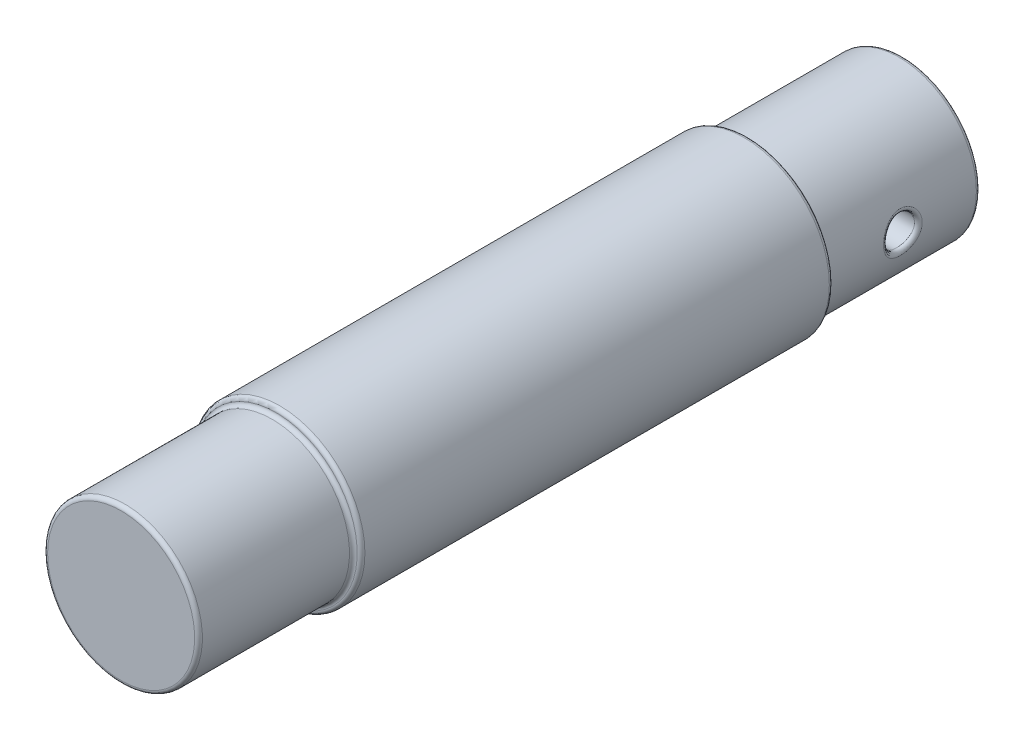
ISO-10303-21;
HEADER;
FILE_DESCRIPTION(('STEP AP214'),'2;1');
FILE_NAME('part.step','',(''),(''),'','','');
FILE_SCHEMA(('AUTOMOTIVE_DESIGN { 1 0 10303 214 1 1 1 1 }'));
ENDSEC;
DATA;
#1=APPLICATION_CONTEXT('core data for automotive mechanical design processes');
#2=APPLICATION_PROTOCOL_DEFINITION('international standard','automotive_design',2000,#1);
#3=PRODUCT_CONTEXT('',#1,'mechanical');
#4=PRODUCT('Part','Part','',(#3));
#5=PRODUCT_RELATED_PRODUCT_CATEGORY('part','',(#4));
#6=PRODUCT_DEFINITION_FORMATION('','',#4);
#7=PRODUCT_DEFINITION_CONTEXT('part definition',#1,'design');
#8=PRODUCT_DEFINITION('design','',#6,#7);
#9=PRODUCT_DEFINITION_SHAPE('','',#8);
#10=(LENGTH_UNIT() NAMED_UNIT(*) SI_UNIT(.MILLI.,.METRE.));
#11=(NAMED_UNIT(*) PLANE_ANGLE_UNIT() SI_UNIT($,.RADIAN.));
#12=(NAMED_UNIT(*) SI_UNIT($,.STERADIAN.) SOLID_ANGLE_UNIT());
#13=UNCERTAINTY_MEASURE_WITH_UNIT(LENGTH_MEASURE(1.E-05),#10,'distance_accuracy_value','');
#14=(GEOMETRIC_REPRESENTATION_CONTEXT(3) GLOBAL_UNCERTAINTY_ASSIGNED_CONTEXT((#13)) GLOBAL_UNIT_ASSIGNED_CONTEXT((#10,
#11,#12)) REPRESENTATION_CONTEXT('',''));
#15=CARTESIAN_POINT('',(0.,0.,0.));
#16=DIRECTION('',(0.,0.,1.));
#17=DIRECTION('',(1.,0.,0.));
#18=AXIS2_PLACEMENT_3D('',#15,#16,#17);
#19=CARTESIAN_POINT('',(0.,0.,50.5));
#20=DIRECTION('',(0.,0.,-1.));
#21=DIRECTION('',(-1.,0.,0.));
#22=AXIS2_PLACEMENT_3D('',#19,#20,#21);
#23=PLANE('',#22);
#24=CARTESIAN_POINT('',(0.,0.,50.5));
#25=DIRECTION('',(0.,0.,-1.));
#26=DIRECTION('',(-1.,0.,0.));
#27=AXIS2_PLACEMENT_3D('',#24,#25,#26);
#28=CIRCLE('',#27,9.5);
#29=CARTESIAN_POINT('',(-9.5,0.,50.5));
#30=VERTEX_POINT('',#29);
#31=EDGE_CURVE('E10',#30,#30,#28,.F.);
#32=ORIENTED_EDGE('',*,*,#31,.T.);
#33=EDGE_LOOP('',(#32));
#34=FACE_BOUND('',#33,.T.);
#35=ADVANCED_FACE('F29',(#34),#23,.F.);
#36=CARTESIAN_POINT('',(0.,0.,50.5));
#37=DIRECTION('',(0.,0.,1.));
#38=DIRECTION('',(1.,0.,0.));
#39=AXIS2_PLACEMENT_3D('',#36,#37,#38);
#40=CYLINDRICAL_SURFACE('',#39,10.);
#41=CARTESIAN_POINT('',(0.,0.,31.));
#42=DIRECTION('',(0.,0.,-1.));
#43=DIRECTION('',(-1.,0.,0.));
#44=AXIS2_PLACEMENT_3D('',#41,#42,#43);
#45=CIRCLE('',#44,10.);
#46=CARTESIAN_POINT('',(-10.,0.,31.));
#47=VERTEX_POINT('',#46);
#48=EDGE_CURVE('E40',#47,#47,#45,.F.);
#49=ORIENTED_EDGE('',*,*,#48,.T.);
#50=EDGE_LOOP('',(#49));
#51=FACE_BOUND('',#50,.T.);
#52=CARTESIAN_POINT('',(0.,0.,50.));
#53=DIRECTION('',(0.,0.,-1.));
#54=DIRECTION('',(-1.,0.,0.));
#55=AXIS2_PLACEMENT_3D('',#52,#53,#54);
#56=CIRCLE('',#55,10.);
#57=CARTESIAN_POINT('',(-10.,0.,50.));
#58=VERTEX_POINT('',#57);
#59=EDGE_CURVE('E45',#58,#58,#56,.T.);
#60=ORIENTED_EDGE('',*,*,#59,.T.);
#61=EDGE_LOOP('',(#60));
#62=FACE_BOUND('',#61,.T.);
#63=ADVANCED_FACE('F168',(#51,#62),#40,.T.);
#64=CARTESIAN_POINT('',(0.,0.,50.5));
#65=DIRECTION('',(0.,0.,1.));
#66=DIRECTION('',(1.,0.,0.));
#67=AXIS2_PLACEMENT_3D('',#64,#65,#66);
#68=CYLINDRICAL_SURFACE('',#67,11.);
#69=CARTESIAN_POINT('',(0.,0.,-30.));
#70=DIRECTION('',(0.,0.,1.));
#71=DIRECTION('',(1.,0.,0.));
#72=AXIS2_PLACEMENT_3D('',#69,#70,#71);
#73=CIRCLE('',#72,11.);
#74=CARTESIAN_POINT('',(11.,0.,-30.));
#75=VERTEX_POINT('',#74);
#76=EDGE_CURVE('E150',#75,#75,#73,.T.);
#77=ORIENTED_EDGE('',*,*,#76,.T.);
#78=EDGE_LOOP('',(#77));
#79=FACE_BOUND('',#78,.T.);
#80=CARTESIAN_POINT('',(0.,0.,30.));
#81=DIRECTION('',(0.,0.,-1.));
#82=DIRECTION('',(-1.,0.,0.));
#83=AXIS2_PLACEMENT_3D('',#80,#81,#82);
#84=CIRCLE('',#83,11.);
#85=CARTESIAN_POINT('',(-11.,0.,30.));
#86=VERTEX_POINT('',#85);
#87=EDGE_CURVE('E175',#86,#86,#84,.T.);
#88=ORIENTED_EDGE('',*,*,#87,.T.);
#89=EDGE_LOOP('',(#88));
#90=FACE_BOUND('',#89,.T.);
#91=CARTESIAN_POINT('',(-10.7840090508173,-1.78430814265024,-10.7119415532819));
#92=CARTESIAN_POINT('',(-10.8467874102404,-1.82997093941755,-10.8245587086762));
#93=CARTESIAN_POINT('',(-10.8400096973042,-1.86927519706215,-10.955394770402));
#94=CARTESIAN_POINT('',(-10.8106396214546,-1.62636723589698,-10.759714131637));
#95=CARTESIAN_POINT('',(-10.8740990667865,-1.6680085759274,-10.8728949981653));
#96=CARTESIAN_POINT('',(-10.8685424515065,-1.70381329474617,-11.0042530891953));
#97=CARTESIAN_POINT('',(-10.8340484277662,-1.46589365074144,-10.8012927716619));
#98=CARTESIAN_POINT('',(-10.8981194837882,-1.50340085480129,-10.9149837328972));
#99=CARTESIAN_POINT('',(-10.8936233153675,-1.53569811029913,-11.0467766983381));
#100=CARTESIAN_POINT('',(-10.8737713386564,-1.14117445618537,-10.8714766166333));
#101=CARTESIAN_POINT('',(-10.9388763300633,-1.17035591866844,-10.986018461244));
#102=CARTESIAN_POINT('',(-10.9361835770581,-1.1955160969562,-11.1185556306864));
#103=CARTESIAN_POINT('',(-10.8900887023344,-0.976930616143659,-10.9000877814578));
#104=CARTESIAN_POINT('',(-10.9556223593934,-1.00189614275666,-11.0149815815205));
#105=CARTESIAN_POINT('',(-10.9536664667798,-1.02345112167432,-11.1478170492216));
#106=CARTESIAN_POINT('',(-10.915168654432,-0.645987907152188,-10.9439419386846));
#107=CARTESIAN_POINT('',(-10.9813577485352,-0.6624947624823,-11.0593682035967));
#108=CARTESIAN_POINT('',(-10.9805378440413,-0.67674923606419,-11.1926678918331));
#109=CARTESIAN_POINT('',(-10.9239319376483,-0.479289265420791,-10.9591861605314));
#110=CARTESIAN_POINT('',(-10.9903519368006,-0.491526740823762,-11.0748000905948));
#111=CARTESIAN_POINT('',(-10.9899270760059,-0.50211256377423,-11.2082585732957));
#112=CARTESIAN_POINT('',(-10.9336596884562,-0.144992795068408,-10.9760978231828));
#113=CARTESIAN_POINT('',(-11.0003347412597,-0.148699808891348,-11.0919176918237));
#114=CARTESIAN_POINT('',(-11.0003496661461,-0.151897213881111,-11.2255545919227));
#115=CARTESIAN_POINT('',(-10.9346248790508,0.0226049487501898,-10.9777665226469));
#116=CARTESIAN_POINT('',(-11.0013257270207,0.023186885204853,-11.0936074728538));
#117=CARTESIAN_POINT('',(-11.0013837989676,0.02368137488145,-11.2272612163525));
#118=CARTESIAN_POINT('',(-10.9263283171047,0.489817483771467,-10.9633676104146));
#119=CARTESIAN_POINT('',(-10.9928103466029,0.502330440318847,-11.0790312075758));
#120=CARTESIAN_POINT('',(-10.9924946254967,0.513142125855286,-11.2125350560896));
#121=CARTESIAN_POINT('',(-10.908370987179,0.788970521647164,-10.9322227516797));
#122=CARTESIAN_POINT('',(-10.9743730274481,0.809198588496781,-11.0474919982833));
#123=CARTESIAN_POINT('',(-10.9732546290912,0.826540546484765,-11.1806823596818));
#124=CARTESIAN_POINT('',(-10.8488264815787,1.37659295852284,-10.8275579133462));
#125=CARTESIAN_POINT('',(-10.913276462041,1.41186227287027,-10.9415584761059));
#126=CARTESIAN_POINT('',(-10.9094569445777,1.44214500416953,-11.0736387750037));
#127=CARTESIAN_POINT('',(-10.8072416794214,1.66506342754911,-10.7540421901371));
#128=CARTESIAN_POINT('',(-10.8705887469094,1.70780615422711,-10.8671143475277));
#129=CARTESIAN_POINT('',(-10.8649017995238,1.74435216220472,-10.9984522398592));
#130=CARTESIAN_POINT('',(-10.7039492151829,2.22558302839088,-10.5675800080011));
#131=CARTESIAN_POINT('',(-10.7646307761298,2.28279221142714,-10.6784000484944));
#132=CARTESIAN_POINT('',(-10.7542313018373,2.3315631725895,-10.8077522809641));
#133=CARTESIAN_POINT('',(-10.6421594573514,2.49755970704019,-10.4544725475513));
#134=CARTESIAN_POINT('',(-10.7012283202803,2.5618753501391,-10.5638777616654));
#135=CARTESIAN_POINT('',(-10.6880279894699,2.61649112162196,-10.6920741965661));
#136=CARTESIAN_POINT('',(-10.5033798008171,3.01894003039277,-10.1933089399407));
#137=CARTESIAN_POINT('',(-10.5589250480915,3.096885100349,-10.2995843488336));
#138=CARTESIAN_POINT('',(-10.5393355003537,3.16269907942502,-10.4249750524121));
#139=CARTESIAN_POINT('',(-10.426383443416,3.26833401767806,-10.0452379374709));
#140=CARTESIAN_POINT('',(-10.4799633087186,3.35287715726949,-10.1496870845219));
#141=CARTESIAN_POINT('',(-10.4568394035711,3.4239689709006,-10.2735387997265));
#142=CARTESIAN_POINT('',(-10.287241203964,3.67021391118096,-9.76848814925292));
#143=CARTESIAN_POINT('',(-10.3374016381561,3.76532738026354,-9.86973821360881));
#144=CARTESIAN_POINT('',(-10.3077584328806,3.84498600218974,-9.99049924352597));
#145=CARTESIAN_POINT('',(-10.2276252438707,3.82923323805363,-9.64744074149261));
#146=CARTESIAN_POINT('',(-10.2763068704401,3.92860922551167,-9.74724210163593));
#147=CARTESIAN_POINT('',(-10.2438841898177,4.01157767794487,-9.86670075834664));
#148=CARTESIAN_POINT('',(-10.1052163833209,4.13468449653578,-9.39242655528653));
#149=CARTESIAN_POINT('',(-10.1509022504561,4.24230714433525,-9.48923043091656));
#150=CARTESIAN_POINT('',(-10.1127318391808,4.33157423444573,-9.60589079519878));
#151=CARTESIAN_POINT('',(-10.042422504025,4.28111251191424,-9.25845578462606));
#152=CARTESIAN_POINT('',(-10.0865779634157,4.39272085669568,-9.35367338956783));
#153=CARTESIAN_POINT('',(-10.0454526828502,4.48497501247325,-9.46887523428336));
#154=CARTESIAN_POINT('',(-9.85146679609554,4.70182157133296,-8.83913636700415));
#155=CARTESIAN_POINT('',(-9.89087664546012,4.82533032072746,-8.92913688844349));
#156=CARTESIAN_POINT('',(-9.84085728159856,4.92571783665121,-9.04002582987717));
#157=CARTESIAN_POINT('',(-9.72083027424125,4.95725540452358,-8.53657300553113));
#158=CARTESIAN_POINT('',(-9.75713824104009,5.08786212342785,-8.62298140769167));
#159=CARTESIAN_POINT('',(-9.70088957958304,5.19331518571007,-8.73058602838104));
#160=CARTESIAN_POINT('',(-9.50309266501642,5.34902353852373,-7.99588785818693));
#161=CARTESIAN_POINT('',(-9.53448621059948,5.49057952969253,-8.07647156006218));
#162=CARTESIAN_POINT('',(-9.4675992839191,5.60373894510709,-8.17761258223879));
#163=CARTESIAN_POINT('',(-9.41494077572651,5.49784473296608,-7.76650612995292));
#164=CARTESIAN_POINT('',(-9.44433063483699,5.64367769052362,-7.84449820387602));
#165=CARTESIAN_POINT('',(-9.37315083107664,5.75964686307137,-7.94301763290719));
#166=CARTESIAN_POINT('',(-9.24289883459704,5.7744128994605,-7.29423004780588));
#167=CARTESIAN_POINT('',(-9.26842452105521,5.9283552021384,-7.36698958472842));
#168=CARTESIAN_POINT('',(-9.18882017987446,6.0493849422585,-7.4600080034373));
#169=CARTESIAN_POINT('',(-9.1590103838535,5.90215199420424,-7.05133068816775));
#170=CARTESIAN_POINT('',(-9.18268773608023,6.05987009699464,-7.12141681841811));
#171=CARTESIAN_POINT('',(-9.09893969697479,6.18320685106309,-7.21158820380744));
#172=CARTESIAN_POINT('',(-8.99742895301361,6.13830122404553,-6.55441924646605));
#173=CARTESIAN_POINT('',(-9.01757644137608,6.30315192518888,-6.61912034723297));
#174=CARTESIAN_POINT('',(-8.92581673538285,6.43060128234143,-6.70338332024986));
#175=CARTESIAN_POINT('',(-8.91974373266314,6.24668735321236,-6.30039384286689));
#176=CARTESIAN_POINT('',(-8.93823382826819,6.41483285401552,-6.36237896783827));
#177=CARTESIAN_POINT('',(-8.84258257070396,6.54414865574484,-6.44358461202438));
#178=CARTESIAN_POINT('',(-8.77212431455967,6.44568855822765,-5.78356125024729));
#179=CARTESIAN_POINT('',(-8.78747802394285,6.62002172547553,-5.84007608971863));
#180=CARTESIAN_POINT('',(-8.68441890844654,6.75262610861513,-5.91500582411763));
#181=CARTESIAN_POINT('',(-8.70219210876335,6.5362990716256,-5.5207518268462));
#182=CARTESIAN_POINT('',(-8.71609829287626,6.71346446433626,-5.57453383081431));
#183=CARTESIAN_POINT('',(-8.6094915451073,6.84755140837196,-5.64622345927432));
#184=CARTESIAN_POINT('',(-8.54662718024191,6.73224871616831,-4.88823695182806));
#185=CARTESIAN_POINT('',(-8.5572477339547,6.91576494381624,-4.93521900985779));
#186=CARTESIAN_POINT('',(-8.44281483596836,7.05283198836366,-4.99933324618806));
#187=CARTESIAN_POINT('',(-8.46494318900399,6.83036577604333,-4.51540848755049));
#188=CARTESIAN_POINT('',(-8.47395241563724,7.01701851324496,-4.55867549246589));
#189=CARTESIAN_POINT('',(-8.35529627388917,7.15562128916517,-4.61803140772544));
#190=CARTESIAN_POINT('',(-8.32032954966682,6.99936318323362,-3.76029981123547));
#191=CARTESIAN_POINT('',(-8.32643935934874,7.19161149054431,-3.79599227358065));
#192=CARTESIAN_POINT('',(-8.20035308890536,7.33266619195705,-3.84576117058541));
#193=CARTESIAN_POINT('',(-8.25740666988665,7.07023370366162,-3.37801624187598));
#194=CARTESIAN_POINT('',(-8.26232006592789,7.26481878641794,-3.41004513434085));
#195=CARTESIAN_POINT('',(-8.13293571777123,7.40691149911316,-3.4547893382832));
#196=CARTESIAN_POINT('',(-8.15151825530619,7.18734438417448,-2.60681240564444));
#197=CARTESIAN_POINT('',(-8.15436410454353,7.38591869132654,-2.63130604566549));
#198=CARTESIAN_POINT('',(-8.01948384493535,7.52959887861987,-2.66605814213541));
#199=CARTESIAN_POINT('',(-8.1085702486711,7.23356291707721,-2.21788661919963));
#200=CARTESIAN_POINT('',(-8.11062184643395,7.43369817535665,-2.23876358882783));
#201=CARTESIAN_POINT('',(-7.97346812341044,7.57801829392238,-2.26829313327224));
#202=CARTESIAN_POINT('',(-8.04344204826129,7.30300532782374,-1.43642239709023));
#203=CARTESIAN_POINT('',(-8.0442455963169,7.50555416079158,-1.44980883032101));
#204=CARTESIAN_POINT('',(-7.90368790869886,7.65076748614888,-1.46906836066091));
#205=CARTESIAN_POINT('',(-8.02125954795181,7.32623175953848,-1.04388436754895));
#206=CARTESIAN_POINT('',(-8.02166018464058,7.5295771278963,-1.05369190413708));
#207=CARTESIAN_POINT('',(-7.87992094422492,7.67509993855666,-1.06760901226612));
#208=CARTESIAN_POINT('',(-7.99777612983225,7.35081058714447,-0.250267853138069));
#209=CARTESIAN_POINT('',(-7.99773096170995,7.55501965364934,-0.252543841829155));
#210=CARTESIAN_POINT('',(-7.85476013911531,7.70084918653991,-0.25595575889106));
#211=CARTESIAN_POINT('',(-7.9968685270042,7.35175097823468,0.150834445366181));
#212=CARTESIAN_POINT('',(-7.99680705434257,7.55599240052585,0.152182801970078));
#213=CARTESIAN_POINT('',(-7.85378770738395,7.70183435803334,0.154262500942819));
#214=CARTESIAN_POINT('',(-8.01695379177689,7.33074561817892,0.951967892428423));
#215=CARTESIAN_POINT('',(-8.01727329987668,7.53424876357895,0.960912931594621));
#216=CARTESIAN_POINT('',(-7.87530763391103,7.67982874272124,0.973603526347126));
#217=CARTESIAN_POINT('',(-8.0379490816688,7.30879733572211,1.35199891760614));
#218=CARTESIAN_POINT('',(-8.03864896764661,7.51154776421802,1.36458160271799));
#219=CARTESIAN_POINT('',(-7.89780258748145,7.6568353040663,1.38272616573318));
#220=CARTESIAN_POINT('',(-8.10148989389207,7.24116560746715,2.14817060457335));
#221=CARTESIAN_POINT('',(-8.10340630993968,7.44156291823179,2.16837731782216));
#222=CARTESIAN_POINT('',(-7.96588202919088,7.58598301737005,2.19699266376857));
#223=CARTESIAN_POINT('',(-8.1440216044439,7.19549737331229,2.54431359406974));
#224=CARTESIAN_POINT('',(-8.14672218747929,7.39435164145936,2.56819285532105));
#225=CARTESIAN_POINT('',(-8.0114517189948,7.53814010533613,2.60213890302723));
#226=CARTESIAN_POINT('',(-8.24989153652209,7.07866557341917,3.33013862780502));
#227=CARTESIAN_POINT('',(-8.25465725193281,7.27353577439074,3.36168919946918));
#228=CARTESIAN_POINT('',(-8.12488378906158,7.41574488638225,3.40582359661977));
#229=CARTESIAN_POINT('',(-8.31322413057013,7.00750890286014,3.71982238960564));
#230=CARTESIAN_POINT('',(-8.31919100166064,7.20003242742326,3.75510028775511));
#231=CARTESIAN_POINT('',(-8.19274013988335,7.34119980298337,3.80436380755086));
#232=CARTESIAN_POINT('',(-8.4425375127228,6.85665893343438,4.40076584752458));
#233=CARTESIAN_POINT('',(-8.4511336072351,7.04413588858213,4.44306779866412));
#234=CARTESIAN_POINT('',(-8.33129019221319,7.18316650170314,4.50078325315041));
#235=CARTESIAN_POINT('',(-8.50454262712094,6.78271440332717,4.69400730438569));
#236=CARTESIAN_POINT('',(-8.51437037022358,6.96779976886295,4.73924037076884));
#237=CARTESIAN_POINT('',(-8.3977242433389,7.10570080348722,4.80068928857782));
#238=CARTESIAN_POINT('',(-8.63919434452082,6.61653182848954,5.2729741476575));
#239=CARTESIAN_POINT('',(-8.65178576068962,6.79625517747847,5.3241463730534));
#240=CARTESIAN_POINT('',(-8.5419939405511,6.93160477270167,5.39281446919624));
#241=CARTESIAN_POINT('',(-8.71183865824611,6.5242977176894,5.5587011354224));
#242=CARTESIAN_POINT('',(-8.72591711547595,6.70111881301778,5.6128142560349));
#243=CARTESIAN_POINT('',(-8.61982713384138,6.83497856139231,5.68503525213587));
#244=CARTESIAN_POINT('',(-8.86644976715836,6.31975668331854,6.12027087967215));
#245=CARTESIAN_POINT('',(-8.883791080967,6.49016950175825,6.18029186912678));
#246=CARTESIAN_POINT('',(-8.78548189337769,6.62069747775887,6.25936794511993));
#247=CARTESIAN_POINT('',(-8.94840553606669,6.20747341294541,6.39612482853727));
#248=CARTESIAN_POINT('',(-8.96748112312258,6.37445578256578,6.45907694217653));
#249=CARTESIAN_POINT('',(-8.87329164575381,6.50306738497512,6.5414913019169));
#250=CARTESIAN_POINT('',(-9.11992516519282,5.96073096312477,6.93560835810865));
#251=CARTESIAN_POINT('',(-9.14272693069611,6.12022182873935,7.0043790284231));
#252=CARTESIAN_POINT('',(-9.05706267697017,6.24457529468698,7.09323582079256));
#253=CARTESIAN_POINT('',(-9.20948634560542,5.82627957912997,7.199242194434));
#254=CARTESIAN_POINT('',(-9.23424831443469,5.98178604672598,7.27090053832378));
#255=CARTESIAN_POINT('',(-9.15302108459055,6.10372146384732,7.36286133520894));
#256=CARTESIAN_POINT('',(-9.43337261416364,5.47027583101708,7.82074450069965));
#257=CARTESIAN_POINT('',(-9.46302069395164,5.61552156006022,7.89891598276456));
#258=CARTESIAN_POINT('',(-9.39289922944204,5.73076515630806,7.99848869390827));
#259=CARTESIAN_POINT('',(-9.57049820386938,5.23603184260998,8.17084876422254));
#260=CARTESIAN_POINT('',(-9.60327579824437,5.37462059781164,8.25304911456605));
#261=CARTESIAN_POINT('',(-9.53981950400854,5.48536669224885,8.35654987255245));
#262=CARTESIAN_POINT('',(-9.84592238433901,4.71230996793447,8.82835953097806));
#263=CARTESIAN_POINT('',(-9.88514474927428,4.836139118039,8.91806546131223));
#264=CARTESIAN_POINT('',(-9.83491684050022,4.93670568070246,9.02900406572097));
#265=CARTESIAN_POINT('',(-9.98421870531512,4.42292250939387,9.13583453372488));
#266=CARTESIAN_POINT('',(-10.0267870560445,4.53879536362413,9.22926589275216));
#267=CARTESIAN_POINT('',(-9.98309147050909,4.63353786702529,9.34346713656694));
#268=CARTESIAN_POINT('',(-10.2207582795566,3.85321591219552,9.63542504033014));
#269=CARTESIAN_POINT('',(-10.2691677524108,3.95343775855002,9.73488161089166));
#270=CARTESIAN_POINT('',(-10.236526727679,4.03670238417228,9.85441197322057));
#271=CARTESIAN_POINT('',(-10.321304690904,3.58381114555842,9.83819937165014));
#272=CARTESIAN_POINT('',(-10.3722405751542,3.67680214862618,9.94015053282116));
#273=CARTESIAN_POINT('',(-10.3442550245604,3.75446881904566,10.0617948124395));
#274=CARTESIAN_POINT('',(-10.4602617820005,3.15421227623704,10.1098494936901));
#275=CARTESIAN_POINT('',(-10.5147532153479,3.23559989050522,10.2151830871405));
#276=CARTESIAN_POINT('',(-10.493137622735,3.30441286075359,10.3396188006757));
#277=CARTESIAN_POINT('',(-10.5046297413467,3.00665546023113,10.195027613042));
#278=CARTESIAN_POINT('',(-10.5602450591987,3.08415318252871,10.3013903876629));
#279=CARTESIAN_POINT('',(-10.5406747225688,3.14982952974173,10.4267327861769));
#280=CARTESIAN_POINT('',(-10.5883444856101,2.70364127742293,10.3535330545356));
#281=CARTESIAN_POINT('',(-10.64608110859,2.77320174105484,10.4617939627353));
#282=CARTESIAN_POINT('',(-10.6303690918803,2.83238610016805,10.5888406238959));
#283=CARTESIAN_POINT('',(-10.6276935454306,2.54818753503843,10.4268657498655));
#284=CARTESIAN_POINT('',(-10.68643857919,2.61368665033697,10.5360184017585));
#285=CARTESIAN_POINT('',(-10.6725287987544,2.66952979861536,10.6638399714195));
#286=CARTESIAN_POINT('',(-10.7007111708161,2.22860585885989,10.5614100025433));
#287=CARTESIAN_POINT('',(-10.7613252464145,2.28580661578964,10.6721812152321));
#288=CARTESIAN_POINT('',(-10.7507619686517,2.33472994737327,10.8014420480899));
#289=CARTESIAN_POINT('',(-10.7343193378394,2.06440702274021,10.6224937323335));
#290=CARTESIAN_POINT('',(-10.7958038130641,2.11734825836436,10.7340120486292));
#291=CARTESIAN_POINT('',(-10.7867707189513,2.16271211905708,10.8639140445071));
#292=CARTESIAN_POINT('',(-10.7943818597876,1.73002068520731,10.7307066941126));
#293=CARTESIAN_POINT('',(-10.8574176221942,1.77433732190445,10.8435325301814));
#294=CARTESIAN_POINT('',(-10.8511234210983,1.81240262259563,10.9745863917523));
#295=CARTESIAN_POINT('',(-10.8208401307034,1.55983651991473,10.7778435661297));
#296=CARTESIAN_POINT('',(-10.8845668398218,1.59976335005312,10.8912483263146));
#297=CARTESIAN_POINT('',(-10.8794715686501,1.6341144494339,11.0227945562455));
#298=CARTESIAN_POINT('',(-10.8657469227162,1.21528846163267,10.8573682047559));
#299=CARTESIAN_POINT('',(-10.930641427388,1.24637495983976,10.9717367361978));
#300=CARTESIAN_POINT('',(-10.9275859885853,1.27315934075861,11.1041265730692));
#301=CARTESIAN_POINT('',(-10.8842159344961,1.04093648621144,10.8897937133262));
#302=CARTESIAN_POINT('',(-10.9495957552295,1.06754398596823,11.0045616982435));
#303=CARTESIAN_POINT('',(-10.9473742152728,1.09050489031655,11.1372890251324));
#304=CARTESIAN_POINT('',(-10.9126311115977,0.689373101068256,10.939523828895));
#305=CARTESIAN_POINT('',(-10.9787532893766,0.706992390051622,11.0548955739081));
#306=CARTESIAN_POINT('',(-10.9778190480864,0.722200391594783,11.1881493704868));
#307=CARTESIAN_POINT('',(-10.9225843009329,0.512164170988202,10.9568408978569));
#308=CARTESIAN_POINT('',(-10.9889689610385,0.525242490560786,11.0724262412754));
#309=CARTESIAN_POINT('',(-10.9884831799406,0.536552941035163,11.2058600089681));
#310=CARTESIAN_POINT('',(-10.9304304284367,0.260453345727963,10.9704843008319));
#311=CARTESIAN_POINT('',(-10.9970210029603,0.267099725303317,11.0862361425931));
#312=CARTESIAN_POINT('',(-10.9968897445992,0.272855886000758,11.2198134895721));
#313=CARTESIAN_POINT('',(-10.9319717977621,0.186370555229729,10.9731628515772));
#314=CARTESIAN_POINT('',(-10.998602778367,0.191125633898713,11.0889472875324));
#315=CARTESIAN_POINT('',(-10.9985412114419,0.195245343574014,11.2225529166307));
#316=CARTESIAN_POINT('',(-10.9335214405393,0.0381348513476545,10.9758552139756));
#317=CARTESIAN_POINT('',(-11.0001930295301,0.0391082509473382,11.0916723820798));
#318=CARTESIAN_POINT('',(-11.0002015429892,0.0399507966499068,11.2253064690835));
#319=CARTESIAN_POINT('',(-10.9335296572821,-0.0360180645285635,10.9758689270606));
#320=CARTESIAN_POINT('',(-11.0002014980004,-0.0369374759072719,11.0916863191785));
#321=CARTESIAN_POINT('',(-11.0002103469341,-0.0377332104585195,11.2253204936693));
#322=CARTESIAN_POINT('',(-10.9309476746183,-0.287451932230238,10.9713848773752));
#323=CARTESIAN_POINT('',(-10.9975517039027,-0.294788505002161,11.0871475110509));
#324=CARTESIAN_POINT('',(-10.9974439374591,-0.301140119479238,11.2207345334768));
#325=CARTESIAN_POINT('',(-10.9247253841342,-0.464636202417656,10.9605820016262));
#326=CARTESIAN_POINT('',(-10.9911652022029,-0.476510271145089,11.0762113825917));
#327=CARTESIAN_POINT('',(-10.990777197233,-0.486761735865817,11.209686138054));
#328=CARTESIAN_POINT('',(-10.9036703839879,-0.816916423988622,10.923856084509));
#329=CARTESIAN_POINT('',(-10.969559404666,-0.837787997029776,11.0390393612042));
#330=CARTESIAN_POINT('',(-10.9682182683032,-0.855817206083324,11.1721255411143));
#331=CARTESIAN_POINT('',(-10.8888306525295,-0.992010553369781,10.8979207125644));
#332=CARTESIAN_POINT('',(-10.9543289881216,-1.01737442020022,11.0127842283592));
#333=CARTESIAN_POINT('',(-10.9523185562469,-1.03924915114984,11.1456007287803));
#334=CARTESIAN_POINT('',(-10.850975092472,-1.33874465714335,10.8312655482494));
#335=CARTESIAN_POINT('',(-10.9154867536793,-1.37298957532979,10.9453204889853));
#336=CARTESIAN_POINT('',(-10.9117590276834,-1.40249440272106,11.0774306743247));
#337=CARTESIAN_POINT('',(-10.8279389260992,-1.51037490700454,10.7905089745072));
#338=CARTESIAN_POINT('',(-10.8918472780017,-1.54903823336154,10.9040626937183));
#339=CARTESIAN_POINT('',(-10.8870774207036,-1.5822975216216,11.0357478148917));
#340=CARTESIAN_POINT('',(-10.774409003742,-1.84828778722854,10.6948422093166));
#341=CARTESIAN_POINT('',(-10.8369303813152,-1.89564519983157,10.8072383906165));
#342=CARTESIAN_POINT('',(-10.8297239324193,-1.93630149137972,10.9379068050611));
#343=CARTESIAN_POINT('',(-10.7439111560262,-2.01456742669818,10.6399242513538));
#344=CARTESIAN_POINT('',(-10.8056396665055,-2.06622685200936,10.7516474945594));
#345=CARTESIAN_POINT('',(-10.797047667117,-2.11049920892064,10.8817407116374));
#346=CARTESIAN_POINT('',(-10.6766620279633,-2.33900550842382,10.5172926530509));
#347=CARTESIAN_POINT('',(-10.7366621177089,-2.39906261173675,10.6275377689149));
#348=CARTESIAN_POINT('',(-10.724995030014,-2.45038672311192,10.7563220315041));
#349=CARTESIAN_POINT('',(-10.6399673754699,-2.49722195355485,10.4496943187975));
#350=CARTESIAN_POINT('',(-10.6990226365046,-2.56139866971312,10.5591153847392));
#351=CARTESIAN_POINT('',(-10.6856793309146,-2.61613728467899,10.6871873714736));
#352=CARTESIAN_POINT('',(-10.5611329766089,-2.80615016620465,10.3023028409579));
#353=CARTESIAN_POINT('',(-10.6181809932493,-2.8783871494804,10.4099547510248));
#354=CARTESIAN_POINT('',(-10.601213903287,-2.93977636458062,10.5364460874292));
#355=CARTESIAN_POINT('',(-10.518990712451,-2.95685841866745,10.2225040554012));
#356=CARTESIAN_POINT('',(-10.5749654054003,-3.03305219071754,10.329188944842));
#357=CARTESIAN_POINT('',(-10.5560614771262,-3.09766120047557,10.4548336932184));
#358=CARTESIAN_POINT('',(-10.3860310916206,-3.39633126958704,9.96639913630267));
#359=CARTESIAN_POINT('',(-10.4385892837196,-3.4843271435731,10.0698940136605));
#360=CARTESIAN_POINT('',(-10.4136047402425,-3.55806132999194,10.1929082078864));
#361=CARTESIAN_POINT('',(-10.2885864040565,-3.67287779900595,9.7732170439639));
#362=CARTESIAN_POINT('',(-10.3386775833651,-3.76826415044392,9.87432292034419));
#363=CARTESIAN_POINT('',(-10.3091997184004,-3.8477767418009,9.99533561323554));
#364=CARTESIAN_POINT('',(-10.055671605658,-4.26289265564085,9.29052516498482));
#365=CARTESIAN_POINT('',(-10.0999726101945,-4.37439443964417,9.38578511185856));
#366=CARTESIAN_POINT('',(-10.059648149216,-4.46588754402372,9.50167346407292));
#367=CARTESIAN_POINT('',(-9.91721342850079,-4.56488017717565,8.98920316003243));
#368=CARTESIAN_POINT('',(-9.95813135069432,-4.68464273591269,9.08077982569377));
#369=CARTESIAN_POINT('',(-9.91130010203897,-4.7822554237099,9.19350323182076));
#370=CARTESIAN_POINT('',(-9.63943068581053,-5.11212632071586,8.34097183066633));
#371=CARTESIAN_POINT('',(-9.67380249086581,-5.24720545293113,8.42511329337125));
#372=CARTESIAN_POINT('',(-9.61367573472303,-5.35556090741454,8.53053937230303));
#373=CARTESIAN_POINT('',(-9.50010500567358,-5.35728126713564,7.99398097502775));
#374=CARTESIAN_POINT('',(-9.53126650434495,-5.49928388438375,8.07409304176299));
#375=CARTESIAN_POINT('',(-9.46439822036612,-5.61238989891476,8.17566236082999));
#376=CARTESIAN_POINT('',(-9.27114666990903,-5.73082470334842,7.37491924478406));
#377=CARTESIAN_POINT('',(-9.29727473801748,-5.88351549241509,7.44850578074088));
#378=CARTESIAN_POINT('',(-9.21908571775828,-6.0037211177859,7.54253104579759));
#379=CARTESIAN_POINT('',(-9.17901910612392,-5.87229044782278,7.11110212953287));
#380=CARTESIAN_POINT('',(-9.20311520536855,-6.02914452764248,7.18177841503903));
#381=CARTESIAN_POINT('',(-9.1203776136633,-6.15192332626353,7.27271808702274));
#382=CARTESIAN_POINT('',(-9.00209439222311,-6.13202210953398,6.57029881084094));
#383=CARTESIAN_POINT('',(-9.02232162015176,-6.29670793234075,6.63511040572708));
#384=CARTESIAN_POINT('',(-8.93081542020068,-6.42402316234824,6.71962378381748));
#385=CARTESIAN_POINT('',(-8.9173000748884,-6.25027908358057,6.29330758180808));
#386=CARTESIAN_POINT('',(-8.93572049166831,-6.41855412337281,6.35515631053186));
#387=CARTESIAN_POINT('',(-8.83996436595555,-6.5479114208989,6.43633729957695));
#388=CARTESIAN_POINT('',(-8.75691693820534,-6.4658570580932,5.72867623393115));
#389=CARTESIAN_POINT('',(-8.77193257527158,-6.6408439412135,5.78455367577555));
#390=CARTESIAN_POINT('',(-8.6681252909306,-6.77375501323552,5.85887342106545));
#391=CARTESIAN_POINT('',(-8.68134079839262,-6.56314935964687,5.44102214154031));
#392=CARTESIAN_POINT('',(-8.69480020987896,-6.74117931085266,5.49392130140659));
#393=CARTESIAN_POINT('',(-8.58715085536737,-6.87568028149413,5.56468173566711));
#394=CARTESIAN_POINT('',(-8.54090216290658,-6.73861032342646,4.85769150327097));
#395=CARTESIAN_POINT('',(-8.55146442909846,-6.92227072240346,4.90457835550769));
#396=CARTESIAN_POINT('',(-8.43668088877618,-7.05949652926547,4.96809358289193));
#397=CARTESIAN_POINT('',(-8.47603966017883,-6.81677899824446,4.56201496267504));
#398=CARTESIAN_POINT('',(-8.48530729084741,-7.00295450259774,4.60593134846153));
#399=CARTESIAN_POINT('',(-8.36718535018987,-7.14138752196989,4.66569712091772));
#400=CARTESIAN_POINT('',(-8.33893888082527,-6.97819075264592,3.86790464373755));
#401=CARTESIAN_POINT('',(-8.3454022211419,-7.16974844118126,3.90460715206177));
#402=CARTESIAN_POINT('',(-8.22029165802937,-7.31048555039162,3.95581156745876));
#403=CARTESIAN_POINT('',(-8.27109074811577,-7.05491039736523,3.4671419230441));
#404=CARTESIAN_POINT('',(-8.27626523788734,-7.24898622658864,3.50000181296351));
#405=CARTESIAN_POINT('',(-8.1475972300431,-7.39085851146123,3.54594060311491));
#406=CARTESIAN_POINT('',(-8.15738646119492,-7.18101273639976,2.65841125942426));
#407=CARTESIAN_POINT('',(-8.16033732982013,-7.3793773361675,2.68335591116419));
#408=CARTESIAN_POINT('',(-8.02577120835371,-7.52296572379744,2.71882969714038));
#409=CARTESIAN_POINT('',(-8.11153708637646,-7.23038700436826,2.25044113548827));
#410=CARTESIAN_POINT('',(-8.11364331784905,-7.43041461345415,2.27160452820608));
#411=CARTESIAN_POINT('',(-7.97664687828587,-7.57469114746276,2.30158752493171));
#412=CARTESIAN_POINT('',(-8.04266092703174,-7.30385031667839,1.43000018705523));
#413=CARTESIAN_POINT('',(-8.04344694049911,-7.50643097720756,1.44329778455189));
#414=CARTESIAN_POINT('',(-7.90285099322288,-7.65165271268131,1.46250019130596));
#415=CARTESIAN_POINT('',(-8.01965820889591,-7.3279126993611,1.01752507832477));
#416=CARTESIAN_POINT('',(-8.02002848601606,-7.53131698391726,1.02707992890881));
#417=CARTESIAN_POINT('',(-7.87820522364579,-7.67686092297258,1.04065064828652));
#418=CARTESIAN_POINT('',(-7.99695077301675,-7.35166896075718,0.191323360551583));
#419=CARTESIAN_POINT('',(-7.99689028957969,-7.55590795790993,0.193041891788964));
#420=CARTESIAN_POINT('',(-7.8538758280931,-7.70174843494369,0.195671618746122));
#421=CARTESIAN_POINT('',(-7.99724343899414,-7.35136557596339,-0.222403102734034));
#422=CARTESIAN_POINT('',(-7.99718825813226,-7.55559410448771,-0.224411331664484));
#423=CARTESIAN_POINT('',(-7.85418939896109,-7.70143060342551,-0.227457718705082));
#424=CARTESIAN_POINT('',(-8.02124172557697,-7.32625290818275,-1.05288976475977));
#425=CARTESIAN_POINT('',(-8.02164170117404,-7.5295993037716,-1.06277387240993));
#426=CARTESIAN_POINT('',(-7.87990184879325,-7.67512209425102,-1.0768190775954));
#427=CARTESIAN_POINT('',(-8.04519663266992,-7.3011827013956,-1.46963535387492));
#428=CARTESIAN_POINT('',(-8.04602921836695,-7.50367162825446,-1.48329840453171));
#429=CARTESIAN_POINT('',(-7.90556782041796,-7.64885806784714,-1.50303615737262));
#430=CARTESIAN_POINT('',(-8.11648933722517,-7.22506376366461,-2.29894833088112));
#431=CARTESIAN_POINT('',(-8.11868930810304,-7.42490901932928,-2.32056700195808));
#432=CARTESIAN_POINT('',(-7.98195286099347,-7.56911441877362,-2.35119715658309));
#433=CARTESIAN_POINT('',(-8.16383142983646,-7.1740102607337,-2.71151493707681));
#434=CARTESIAN_POINT('',(-8.16690357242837,-7.37213845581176,-2.73695892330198));
#435=CARTESIAN_POINT('',(-8.03267653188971,-7.51562979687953,-2.77314027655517));
#436=CARTESIAN_POINT('',(-8.28089079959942,-7.04387437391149,-3.52849938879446));
#437=CARTESIAN_POINT('',(-8.28625469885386,-7.23758174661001,-3.56194756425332));
#438=CARTESIAN_POINT('',(-8.15809728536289,-7.37929696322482,-3.60869255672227));
#439=CARTESIAN_POINT('',(-8.3505706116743,-6.96483889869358,-3.93292968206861));
#440=CARTESIAN_POINT('',(-8.35725902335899,-7.15595703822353,-3.97025768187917));
#441=CARTESIAN_POINT('',(-8.23275422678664,-7.29649789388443,-4.02231444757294));
#442=CARTESIAN_POINT('',(-8.51074737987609,-6.7755113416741,-4.7304481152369));
#443=CARTESIAN_POINT('',(-8.52066453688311,-6.96039524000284,-4.77581777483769));
#444=CARTESIAN_POINT('',(-8.40437219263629,-7.09815473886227,-4.8379582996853));
#445=CARTESIAN_POINT('',(-8.60123292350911,-6.66523638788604,-5.12354234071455));
#446=CARTESIAN_POINT('',(-8.61294314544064,-6.84662729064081,-5.17285345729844));
#447=CARTESIAN_POINT('',(-8.50132098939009,-6.98262859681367,-5.23998648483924));
#448=CARTESIAN_POINT('',(-8.7643360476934,-6.4555482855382,-5.75422575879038));
#449=CARTESIAN_POINT('',(-8.77954947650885,-6.63016101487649,-5.81048322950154));
#450=CARTESIAN_POINT('',(-8.67607433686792,-6.76295534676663,-5.88500361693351));
#451=CARTESIAN_POINT('',(-8.83156242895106,-6.36665666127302,-5.99659021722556));
#452=CARTESIAN_POINT('',(-8.84818157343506,-6.53850938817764,-6.05539045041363));
#453=CARTESIAN_POINT('',(-8.74810260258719,-6.6698307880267,-6.13287635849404));
#454=CARTESIAN_POINT('',(-8.97243816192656,-6.17311824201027,-6.47327882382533));
#455=CARTESIAN_POINT('',(-8.9920708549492,-6.33899652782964,-6.53715470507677));
#456=CARTESIAN_POINT('',(-8.89904088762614,-6.46707625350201,-6.62039879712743));
#457=CARTESIAN_POINT('',(-9.04608576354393,-6.06847573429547,-6.7076051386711));
#458=CARTESIAN_POINT('',(-9.0673022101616,-6.23118889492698,-6.77400181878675));
#459=CARTESIAN_POINT('',(-8.9779490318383,-6.35745076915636,-6.86005071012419));
#460=CARTESIAN_POINT('',(-9.19847697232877,-5.84215260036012,-7.16623567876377));
#461=CARTESIAN_POINT('',(-9.22303919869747,-5.99806656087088,-7.23762288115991));
#462=CARTESIAN_POINT('',(-9.14122532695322,-6.12035034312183,-7.32910467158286));
#463=CARTESIAN_POINT('',(-9.27721466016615,-5.72049158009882,-7.39055105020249));
#464=CARTESIAN_POINT('',(-9.303520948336,-5.87282109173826,-7.46441550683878));
#465=CARTESIAN_POINT('',(-9.22558713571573,-5.99289594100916,-7.55851811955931));
#466=CARTESIAN_POINT('',(-9.43817537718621,-5.45871201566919,-7.82723394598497));
#467=CARTESIAN_POINT('',(-9.4681086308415,-5.60339009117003,-7.90594869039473));
#468=CARTESIAN_POINT('',(-9.3980450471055,-5.71865068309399,-8.00512562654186));
#469=CARTESIAN_POINT('',(-9.52039748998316,-5.31859830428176,-8.03960457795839));
#470=CARTESIAN_POINT('',(-9.55220505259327,-5.45925431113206,-8.12072095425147));
#471=CARTESIAN_POINT('',(-9.486140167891,-5.57186489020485,-8.22232286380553));
#472=CARTESIAN_POINT('',(-9.72923141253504,-4.94093121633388,-8.55617760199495));
#473=CARTESIAN_POINT('',(-9.76574668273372,-5.07106507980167,-8.64283806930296));
#474=CARTESIAN_POINT('',(-9.70989079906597,-5.17621365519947,-8.75063618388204));
#475=CARTESIAN_POINT('',(-9.85683913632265,-4.69042495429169,-8.85116661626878));
#476=CARTESIAN_POINT('',(-9.89638385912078,-4.81360397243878,-8.94132466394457));
#477=CARTESIAN_POINT('',(-9.84661336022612,-4.9137785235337,-9.05232949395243));
#478=CARTESIAN_POINT('',(-10.1058107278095,-4.14100975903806,-9.39741124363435));
#479=CARTESIAN_POINT('',(-10.1513397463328,-4.24910713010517,-9.49391580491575));
#480=CARTESIAN_POINT('',(-10.1133686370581,-4.3382006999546,-9.61098877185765));
#481=CARTESIAN_POINT('',(-10.2271825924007,-3.84216496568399,-9.64872390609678));
#482=CARTESIAN_POINT('',(-10.2757373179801,-3.94218463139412,-9.74833023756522));
#483=CARTESIAN_POINT('',(-10.2434099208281,-4.02512520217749,-9.86801308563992));
#484=CARTESIAN_POINT('',(-10.4301820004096,-3.25852458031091,-10.053031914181));
#485=CARTESIAN_POINT('',(-10.4838348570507,-3.34285929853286,-10.1575340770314));
#486=CARTESIAN_POINT('',(-10.4609092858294,-3.41369241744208,-10.2815099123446));
#487=CARTESIAN_POINT('',(-10.514973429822,-2.98194036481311,-10.2156375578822));
#488=CARTESIAN_POINT('',(-10.5708007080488,-3.05895057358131,-10.3221614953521));
#489=CARTESIAN_POINT('',(-10.5517572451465,-3.12393752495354,-10.4478111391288));
#490=CARTESIAN_POINT('',(-10.6278191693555,-2.54688206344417,-10.4271284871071));
#491=CARTESIAN_POINT('',(-10.6865657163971,-2.61234603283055,-10.5362812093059));
#492=CARTESIAN_POINT('',(-10.6726633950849,-2.66816216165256,-10.6641086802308));
#493=CARTESIAN_POINT('',(-10.6630541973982,-2.39844236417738,-10.4922399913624));
#494=CARTESIAN_POINT('',(-10.7227064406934,-2.46003799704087,-10.6021847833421));
#495=CARTESIAN_POINT('',(-10.7104152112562,-2.51265390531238,-10.7306999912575));
#496=CARTESIAN_POINT('',(-10.7279206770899,-2.0956025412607,-10.610915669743));
#497=CARTESIAN_POINT('',(-10.7892383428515,-2.14934982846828,-10.7222905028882));
#498=CARTESIAN_POINT('',(-10.7799150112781,-2.19539313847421,-10.852072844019));
#499=CARTESIAN_POINT('',(-10.7575545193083,-1.94120499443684,-10.6644847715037));
#500=CARTESIAN_POINT('',(-10.8196407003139,-1.9909551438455,-10.7765143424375));
#501=CARTESIAN_POINT('',(-10.8116655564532,-2.03364332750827,-10.9068594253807));
#502=CARTESIAN_POINT('',(-10.7840090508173,-1.78430814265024,-10.7119415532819));
#503=CARTESIAN_POINT('',(-10.8467874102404,-1.82997093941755,-10.8245587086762));
#504=CARTESIAN_POINT('',(-10.8400096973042,-1.86927519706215,-10.955394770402));
#505=(BOUNDED_SURFACE() B_SPLINE_SURFACE(3,2,((#91,#92,#93),(#94,#95,#96),(#97,#98,#99),(#100,
#101,#102),(#103,#104,#105),(#106,#107,#108),(#109,#110,#111),(#112,#113,#114),(#115,#116,#117),
(#118,#119,#120),(#121,#122,#123),(#124,#125,#126),(#127,#128,#129),(#130,#131,#132),(#133,#134,
#135),(#136,#137,#138),(#139,#140,#141),(#142,#143,#144),(#145,#146,#147),(#148,#149,#150),
(#151,#152,#153),(#154,#155,#156),(#157,#158,#159),(#160,#161,#162),(#163,#164,#165),(#166,#167,
#168),(#169,#170,#171),(#172,#173,#174),(#175,#176,#177),(#178,#179,#180),(#181,#182,#183),
(#184,#185,#186),(#187,#188,#189),(#190,#191,#192),(#193,#194,#195),(#196,#197,#198),(#199,#200,
#201),(#202,#203,#204),(#205,#206,#207),(#208,#209,#210),(#211,#212,#213),(#214,#215,#216),
(#217,#218,#219),(#220,#221,#222),(#223,#224,#225),(#226,#227,#228),(#229,#230,#231),(#232,#233,
#234),(#235,#236,#237),(#238,#239,#240),(#241,#242,#243),(#244,#245,#246),(#247,#248,#249),
(#250,#251,#252),(#253,#254,#255),(#256,#257,#258),(#259,#260,#261),(#262,#263,#264),(#265,#266,
#267),(#268,#269,#270),(#271,#272,#273),(#274,#275,#276),(#277,#278,#279),(#280,#281,#282),
(#283,#284,#285),(#286,#287,#288),(#289,#290,#291),(#292,#293,#294),(#295,#296,#297),(#298,#299,
#300),(#301,#302,#303),(#304,#305,#306),(#307,#308,#309),(#310,#311,#312),(#313,#314,#315),
(#316,#317,#318),(#319,#320,#321),(#322,#323,#324),(#325,#326,#327),(#328,#329,#330),(#331,#332,
#333),(#334,#335,#336),(#337,#338,#339),(#340,#341,#342),(#343,#344,#345),(#346,#347,#348),
(#349,#350,#351),(#352,#353,#354),(#355,#356,#357),(#358,#359,#360),(#361,#362,#363),(#364,#365,
#366),(#367,#368,#369),(#370,#371,#372),(#373,#374,#375),(#376,#377,#378),(#379,#380,#381),
(#382,#383,#384),(#385,#386,#387),(#388,#389,#390),(#391,#392,#393),(#394,#395,#396),(#397,#398,
#399),(#400,#401,#402),(#403,#404,#405),(#406,#407,#408),(#409,#410,#411),(#412,#413,#414),
(#415,#416,#417),(#418,#419,#420),(#421,#422,#423),(#424,#425,#426),(#427,#428,#429),(#430,#431,
#432),(#433,#434,#435),(#436,#437,#438),(#439,#440,#441),(#442,#443,#444),(#445,#446,#447),
(#448,#449,#450),(#451,#452,#453),(#454,#455,#456),(#457,#458,#459),(#460,#461,#462),(#463,#464,
#465),(#466,#467,#468),(#469,#470,#471),(#472,#473,#474),(#475,#476,#477),(#478,#479,#480),
(#481,#482,#483),(#484,#485,#486),(#487,#488,#489),(#490,#491,#492),(#493,#494,#495),(#496,#497,
#498),(#499,#500,#501),(#502,#503,#504)),.UNSPECIFIED.,.T.,.F.,
.F.) B_SPLINE_SURFACE_WITH_KNOTS((4,2,2,2,2,2,2,2,2,2,2,2,2,2,2,2,2,2,2,2,2,2,2,2,2,2,2,2,2,2,2,
2,2,2,2,2,2,2,2,2,2,2,2,2,2,2,2,2,2,2,2,2,2,2,2,2,2,2,2,2,2,2,2,2,2,2,2,2,4),(3,3),(0.,
0.502484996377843,1.00473881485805,1.50694643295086,2.00910748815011,2.90857038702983,
3.80794294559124,4.71101616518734,5.61447377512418,6.24530451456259,6.87633075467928,
8.13942279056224,9.01466930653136,9.89024212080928,10.7668935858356,11.643769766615,
12.8495272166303,14.0557191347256,15.2629675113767,16.4700817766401,17.6994950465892,
18.929044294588,20.1578060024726,21.3862355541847,22.3314971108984,23.2765555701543,
24.2205063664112,25.1641259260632,26.5101969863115,27.8540793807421,28.9150694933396,
29.4462844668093,29.9772577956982,30.5135128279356,31.0494735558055,31.5840513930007,
32.118187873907,32.3405842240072,32.5629888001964,33.0949105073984,33.6272662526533,
34.160952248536,34.6949315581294,35.224271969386,35.7538579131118,36.8116199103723,
38.1667864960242,39.5244060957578,40.4798778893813,41.4357171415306,42.3928566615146,
43.3499955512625,44.616442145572,45.883278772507,47.1514484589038,48.4194757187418,
49.7010059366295,50.9827716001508,52.2623986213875,53.5413254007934,54.3572319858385,
55.1729168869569,55.9876697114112,56.8022095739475,58.0373947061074,59.2709541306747,
60.2689946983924,60.7683716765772,61.26753503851),(0.,1.),
.UNSPECIFIED.) GEOMETRIC_REPRESENTATION_ITEM() RATIONAL_B_SPLINE_SURFACE(((1.,0.964559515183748,
1.),(1.,0.964837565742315,1.),(1.,0.965079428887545,1.),(1.,0.965487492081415,1.),(1.,
0.965653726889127,1.),(1.,0.96590844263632,1.),(1.,0.965996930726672,1.),(1.,0.966095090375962,
1.),(1.,0.966104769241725,1.),(1.,0.966021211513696,1.),(1.,0.965840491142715,1.),(1.,
0.965232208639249,1.),(1.,0.964804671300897,1.),(1.,0.96371909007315,1.),(1.,0.963060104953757,
1.),(1.,0.961540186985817,1.),(1.,0.960679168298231,1.),(1.,0.959078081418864,1.),(1.,
0.958379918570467,1.),(1.,0.956917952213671,1.),(1.,0.956154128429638,1.),(1.,0.953784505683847,
1.),(1.,0.952101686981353,1.),(1.,0.949190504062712,1.),(1.,0.947981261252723,1.),(1.,
0.945565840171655,1.),(1.,0.944359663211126,1.),(1.,0.941987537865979,1.),(1.,0.94082164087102,
1.),(1.,0.938565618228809,1.),(1.,0.937475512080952,1.),(1.,0.935012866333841,1.),(1.,
0.933687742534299,1.),(1.,0.931305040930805,1.),(1.,0.930247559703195,1.),(1.,0.928449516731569,
1.),(1.,0.92770923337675,1.),(1.,0.926580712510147,1.),(1.,0.926192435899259,1.),(1.,
0.925781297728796,1.),(1.,0.925765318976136,1.),(1.,0.926117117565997,1.),(1.,0.92648493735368,
1.),(1.,0.927587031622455,1.),(1.,0.928321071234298,1.),(1.,0.930120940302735,1.),(1.,
0.931186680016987,1.),(1.,0.933319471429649,1.),(1.,0.934329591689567,1.),(1.,0.936484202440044,
1.),(1.,0.937628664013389,1.),(1.,0.940014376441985,1.),(1.,0.941255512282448,1.),(1.,
0.943793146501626,1.),(1.,0.94508962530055,1.),(1.,0.948247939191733,1.),(1.,0.950115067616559,
1.),(1.,0.953717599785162,1.),(1.,0.955453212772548,1.),(1.,0.958307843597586,1.),(1.,
0.959479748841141,1.),(1.,0.961055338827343,1.),(1.,0.961550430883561,1.),(1.,0.96247253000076,
1.),(1.,0.962899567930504,1.),(1.,0.963683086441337,1.),(1.,0.964038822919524,1.),(1.,
0.964668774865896,1.),(1.,0.964943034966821,1.),(1.,0.965405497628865,1.),(1.,0.96559392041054,
1.),(1.,0.965882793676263,1.),(1.,0.965983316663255,1.),(1.,0.966062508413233,1.),(1.,
0.966078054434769,1.),(1.,0.966093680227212,1.),(1.,0.966093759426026,1.),(1.,0.966067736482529,
1.),(1.,0.966005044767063,1.),(1.,0.965791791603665,1.),(1.,0.965641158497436,1.),(1.,
0.965253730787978,1.),(1.,0.965016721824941,1.),(1.,0.964460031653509,1.),(1.,0.964140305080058,
1.),(1.,0.963426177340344,1.),(1.,0.963032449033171,1.),(1.,0.962174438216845,1.),(1.,
0.961710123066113,1.),(1.,0.960222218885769,1.),(1.,0.959102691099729,1.),(1.,0.956331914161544,
1.),(1.,0.954619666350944,1.),(1.,0.951035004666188,1.),(1.,0.949162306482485,1.),(1.,
0.945969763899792,1.),(1.,0.944650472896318,1.),(1.,0.942058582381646,1.),(1.,0.940786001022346,
1.),(1.,0.938331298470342,1.),(1.,0.937149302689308,1.),(1.,0.934916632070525,1.),(1.,
0.933865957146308,1.),(1.,0.931615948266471,1.),(1.,0.930478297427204,1.),(1.,0.928550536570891,
1.),(1.,0.927760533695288,1.),(1.,0.926567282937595,1.),(1.,0.926164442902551,1.),(1.,
0.925766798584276,1.),(1.,0.92577194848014,1.),(1.,0.92619214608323,1.),(1.,0.926611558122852,
1.),(1.,0.927845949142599,1.),(1.,0.92866100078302,1.),(1.,0.93064308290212,1.),(1.,
0.931809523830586,1.),(1.,0.934432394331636,1.),(1.,0.935888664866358,1.),(1.,0.93844318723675,
1.),(1.,0.93948017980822,1.),(1.,0.94161259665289,1.),(1.,0.942708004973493,1.),(1.,
0.944927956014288,1.),(1.,0.94605246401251,1.),(1.,0.948300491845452,1.),(1.,0.949424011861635,
1.),(1.,0.95221044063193,1.),(1.,0.953852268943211,1.),(1.,0.956939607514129,1.),(1.,
0.958385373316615,1.),(1.,0.960724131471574,1.),(1.,0.96166996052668,1.),(1.,0.962901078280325,
1.),(1.,0.963280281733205,1.),(1.,0.963971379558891,1.),(1.,0.964283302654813,1.),(1.,
0.964559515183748,1.))) REPRESENTATION_ITEM('') SURFACE());
#506=CARTESIAN_POINT('',(-10.8400096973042,-1.86927519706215,-10.955394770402));
#507=CARTESIAN_POINT('',(-10.8685424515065,-1.70381329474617,-11.0042530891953));
#508=CARTESIAN_POINT('',(-10.8936233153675,-1.53569811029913,-11.0467766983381));
#509=CARTESIAN_POINT('',(-10.9361835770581,-1.1955160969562,-11.1185556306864));
#510=CARTESIAN_POINT('',(-10.9536664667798,-1.02345112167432,-11.1478170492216));
#511=CARTESIAN_POINT('',(-10.9805378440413,-0.67674923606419,-11.1926678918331));
#512=CARTESIAN_POINT('',(-10.9899270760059,-0.502112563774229,-11.2082585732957));
#513=CARTESIAN_POINT('',(-11.0003496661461,-0.151897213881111,-11.2255545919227));
#514=CARTESIAN_POINT('',(-11.0013837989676,0.02368137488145,-11.2272612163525));
#515=CARTESIAN_POINT('',(-10.9924946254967,0.513142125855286,-11.2125350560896));
#516=CARTESIAN_POINT('',(-10.9732546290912,0.826540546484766,-11.1806823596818));
#517=CARTESIAN_POINT('',(-10.9094569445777,1.44214500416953,-11.0736387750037));
#518=CARTESIAN_POINT('',(-10.8649017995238,1.74435216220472,-10.9984522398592));
#519=CARTESIAN_POINT('',(-10.7542313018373,2.3315631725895,-10.8077522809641));
#520=CARTESIAN_POINT('',(-10.6880279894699,2.61649112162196,-10.6920741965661));
#521=CARTESIAN_POINT('',(-10.5393355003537,3.16269907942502,-10.4249750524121));
#522=CARTESIAN_POINT('',(-10.4568394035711,3.4239689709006,-10.2735387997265));
#523=CARTESIAN_POINT('',(-10.3077584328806,3.84498600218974,-9.99049924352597));
#524=CARTESIAN_POINT('',(-10.2438841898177,4.01157767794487,-9.86670075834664));
#525=CARTESIAN_POINT('',(-10.1127318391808,4.33157423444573,-9.60589079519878));
#526=CARTESIAN_POINT('',(-10.0454526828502,4.48497501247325,-9.46887523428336));
#527=CARTESIAN_POINT('',(-9.84085728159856,4.92571783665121,-9.04002582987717));
#528=CARTESIAN_POINT('',(-9.70088957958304,5.19331518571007,-8.73058602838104));
#529=CARTESIAN_POINT('',(-9.4675992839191,5.60373894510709,-8.17761258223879));
#530=CARTESIAN_POINT('',(-9.37315083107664,5.75964686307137,-7.94301763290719));
#531=CARTESIAN_POINT('',(-9.18882017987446,6.0493849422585,-7.4600080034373));
#532=CARTESIAN_POINT('',(-9.09893969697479,6.18320685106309,-7.21158820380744));
#533=CARTESIAN_POINT('',(-8.92581673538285,6.43060128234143,-6.70338332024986));
#534=CARTESIAN_POINT('',(-8.84258257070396,6.54414865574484,-6.44358461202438));
#535=CARTESIAN_POINT('',(-8.68441890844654,6.75262610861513,-5.91500582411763));
#536=CARTESIAN_POINT('',(-8.6094915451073,6.84755140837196,-5.64622345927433));
#537=CARTESIAN_POINT('',(-8.44281483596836,7.05283198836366,-4.99933324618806));
#538=CARTESIAN_POINT('',(-8.35529627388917,7.15562128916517,-4.61803140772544));
#539=CARTESIAN_POINT('',(-8.20035308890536,7.33266619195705,-3.84576117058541));
#540=CARTESIAN_POINT('',(-8.13293571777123,7.40691149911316,-3.4547893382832));
#541=CARTESIAN_POINT('',(-8.01948384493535,7.52959887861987,-2.66605814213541));
#542=CARTESIAN_POINT('',(-7.97346812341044,7.57801829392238,-2.26829313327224));
#543=CARTESIAN_POINT('',(-7.90368790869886,7.65076748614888,-1.46906836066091));
#544=CARTESIAN_POINT('',(-7.87992094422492,7.67509993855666,-1.06760901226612));
#545=CARTESIAN_POINT('',(-7.85476013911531,7.70084918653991,-0.255955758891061));
#546=CARTESIAN_POINT('',(-7.85378770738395,7.70183435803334,0.154262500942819));
#547=CARTESIAN_POINT('',(-7.87530763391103,7.67982874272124,0.973603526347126));
#548=CARTESIAN_POINT('',(-7.89780258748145,7.6568353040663,1.38272616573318));
#549=CARTESIAN_POINT('',(-7.96588202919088,7.58598301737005,2.19699266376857));
#550=CARTESIAN_POINT('',(-8.0114517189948,7.53814010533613,2.60213890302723));
#551=CARTESIAN_POINT('',(-8.12488378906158,7.41574488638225,3.40582359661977));
#552=CARTESIAN_POINT('',(-8.19274013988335,7.34119980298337,3.80436380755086));
#553=CARTESIAN_POINT('',(-8.33129019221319,7.18316650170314,4.50078325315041));
#554=CARTESIAN_POINT('',(-8.3977242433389,7.10570080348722,4.80068928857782));
#555=CARTESIAN_POINT('',(-8.5419939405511,6.93160477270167,5.39281446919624));
#556=CARTESIAN_POINT('',(-8.61982713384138,6.83497856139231,5.68503525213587));
#557=CARTESIAN_POINT('',(-8.78548189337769,6.62069747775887,6.25936794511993));
#558=CARTESIAN_POINT('',(-8.8732916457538,6.50306738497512,6.5414913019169));
#559=CARTESIAN_POINT('',(-9.05706267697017,6.24457529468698,7.09323582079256));
#560=CARTESIAN_POINT('',(-9.15302108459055,6.10372146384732,7.36286133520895));
#561=CARTESIAN_POINT('',(-9.39289922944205,5.73076515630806,7.99848869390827));
#562=CARTESIAN_POINT('',(-9.53981950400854,5.48536669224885,8.35654987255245));
#563=CARTESIAN_POINT('',(-9.83491684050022,4.93670568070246,9.02900406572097));
#564=CARTESIAN_POINT('',(-9.98309147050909,4.63353786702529,9.34346713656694));
#565=CARTESIAN_POINT('',(-10.236526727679,4.03670238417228,9.85441197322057));
#566=CARTESIAN_POINT('',(-10.3442550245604,3.75446881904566,10.0617948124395));
#567=CARTESIAN_POINT('',(-10.493137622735,3.30441286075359,10.3396188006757));
#568=CARTESIAN_POINT('',(-10.5406747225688,3.14982952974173,10.4267327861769));
#569=CARTESIAN_POINT('',(-10.6303690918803,2.83238610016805,10.5888406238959));
#570=CARTESIAN_POINT('',(-10.6725287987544,2.66952979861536,10.6638399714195));
#571=CARTESIAN_POINT('',(-10.7507619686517,2.33472994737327,10.8014420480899));
#572=CARTESIAN_POINT('',(-10.7867707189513,2.16271211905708,10.8639140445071));
#573=CARTESIAN_POINT('',(-10.8511234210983,1.81240262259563,10.9745863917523));
#574=CARTESIAN_POINT('',(-10.8794715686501,1.6341144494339,11.0227945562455));
#575=CARTESIAN_POINT('',(-10.9275859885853,1.27315934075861,11.1041265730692));
#576=CARTESIAN_POINT('',(-10.9473742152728,1.09050489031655,11.1372890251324));
#577=CARTESIAN_POINT('',(-10.9778190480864,0.722200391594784,11.1881493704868));
#578=CARTESIAN_POINT('',(-10.9884831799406,0.536552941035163,11.2058600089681));
#579=CARTESIAN_POINT('',(-10.9968897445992,0.272855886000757,11.2198134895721));
#580=CARTESIAN_POINT('',(-10.9985412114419,0.195245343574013,11.2225529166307));
#581=CARTESIAN_POINT('',(-11.0002015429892,0.0399507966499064,11.2253064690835));
#582=CARTESIAN_POINT('',(-11.0002103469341,-0.0377332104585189,11.2253204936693));
#583=CARTESIAN_POINT('',(-10.9974439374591,-0.301140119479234,11.2207345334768));
#584=CARTESIAN_POINT('',(-10.990777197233,-0.486761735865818,11.209686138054));
#585=CARTESIAN_POINT('',(-10.9682182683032,-0.855817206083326,11.1721255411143));
#586=CARTESIAN_POINT('',(-10.9523185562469,-1.03924915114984,11.1456007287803));
#587=CARTESIAN_POINT('',(-10.9117590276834,-1.40249440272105,11.0774306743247));
#588=CARTESIAN_POINT('',(-10.8870774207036,-1.5822975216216,11.0357478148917));
#589=CARTESIAN_POINT('',(-10.8297239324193,-1.93630149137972,10.9379068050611));
#590=CARTESIAN_POINT('',(-10.797047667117,-2.11049920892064,10.8817407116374));
#591=CARTESIAN_POINT('',(-10.724995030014,-2.45038672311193,10.7563220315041));
#592=CARTESIAN_POINT('',(-10.6856793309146,-2.61613728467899,10.6871873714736));
#593=CARTESIAN_POINT('',(-10.601213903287,-2.93977636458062,10.5364460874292));
#594=CARTESIAN_POINT('',(-10.5560614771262,-3.09766120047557,10.4548336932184));
#595=CARTESIAN_POINT('',(-10.4136047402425,-3.55806132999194,10.1929082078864));
#596=CARTESIAN_POINT('',(-10.3091997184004,-3.8477767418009,9.99533561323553));
#597=CARTESIAN_POINT('',(-10.059648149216,-4.46588754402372,9.50167346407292));
#598=CARTESIAN_POINT('',(-9.91130010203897,-4.7822554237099,9.19350323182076));
#599=CARTESIAN_POINT('',(-9.61367573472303,-5.35556090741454,8.53053937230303));
#600=CARTESIAN_POINT('',(-9.46439822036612,-5.61238989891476,8.17566236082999));
#601=CARTESIAN_POINT('',(-9.21908571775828,-6.00372111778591,7.54253104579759));
#602=CARTESIAN_POINT('',(-9.12037761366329,-6.15192332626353,7.27271808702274));
#603=CARTESIAN_POINT('',(-8.93081542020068,-6.42402316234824,6.71962378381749));
#604=CARTESIAN_POINT('',(-8.83996436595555,-6.5479114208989,6.43633729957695));
#605=CARTESIAN_POINT('',(-8.6681252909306,-6.77375501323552,5.85887342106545));
#606=CARTESIAN_POINT('',(-8.58715085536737,-6.87568028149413,5.56468173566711));
#607=CARTESIAN_POINT('',(-8.43668088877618,-7.05949652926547,4.96809358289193));
#608=CARTESIAN_POINT('',(-8.36718535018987,-7.14138752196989,4.66569712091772));
#609=CARTESIAN_POINT('',(-8.22029165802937,-7.31048555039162,3.95581156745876));
#610=CARTESIAN_POINT('',(-8.1475972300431,-7.39085851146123,3.54594060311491));
#611=CARTESIAN_POINT('',(-8.02577120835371,-7.52296572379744,2.71882969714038));
#612=CARTESIAN_POINT('',(-7.97664687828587,-7.57469114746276,2.30158752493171));
#613=CARTESIAN_POINT('',(-7.90285099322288,-7.65165271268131,1.46250019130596));
#614=CARTESIAN_POINT('',(-7.87820522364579,-7.67686092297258,1.04065064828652));
#615=CARTESIAN_POINT('',(-7.8538758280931,-7.70174843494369,0.195671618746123));
#616=CARTESIAN_POINT('',(-7.85418939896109,-7.70143060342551,-0.227457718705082));
#617=CARTESIAN_POINT('',(-7.87990184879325,-7.67512209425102,-1.0768190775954));
#618=CARTESIAN_POINT('',(-7.90556782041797,-7.64885806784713,-1.50303615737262));
#619=CARTESIAN_POINT('',(-7.98195286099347,-7.56911441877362,-2.35119715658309));
#620=CARTESIAN_POINT('',(-8.03267653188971,-7.51562979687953,-2.77314027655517));
#621=CARTESIAN_POINT('',(-8.15809728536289,-7.37929696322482,-3.60869255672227));
#622=CARTESIAN_POINT('',(-8.23275422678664,-7.29649789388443,-4.02231444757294));
#623=CARTESIAN_POINT('',(-8.40437219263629,-7.09815473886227,-4.8379582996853));
#624=CARTESIAN_POINT('',(-8.50132098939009,-6.98262859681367,-5.23998648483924));
#625=CARTESIAN_POINT('',(-8.67607433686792,-6.76295534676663,-5.88500361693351));
#626=CARTESIAN_POINT('',(-8.74810260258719,-6.6698307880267,-6.13287635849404));
#627=CARTESIAN_POINT('',(-8.89904088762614,-6.46707625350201,-6.62039879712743));
#628=CARTESIAN_POINT('',(-8.9779490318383,-6.35745076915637,-6.86005071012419));
#629=CARTESIAN_POINT('',(-9.14122532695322,-6.12035034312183,-7.32910467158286));
#630=CARTESIAN_POINT('',(-9.22558713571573,-5.99289594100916,-7.55851811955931));
#631=CARTESIAN_POINT('',(-9.3980450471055,-5.71865068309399,-8.00512562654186));
#632=CARTESIAN_POINT('',(-9.486140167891,-5.57186489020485,-8.22232286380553));
#633=CARTESIAN_POINT('',(-9.70989079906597,-5.17621365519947,-8.75063618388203));
#634=CARTESIAN_POINT('',(-9.84661336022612,-4.91377852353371,-9.05232949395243));
#635=CARTESIAN_POINT('',(-10.1133686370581,-4.3382006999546,-9.61098877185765));
#636=CARTESIAN_POINT('',(-10.2434099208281,-4.02512520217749,-9.86801308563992));
#637=CARTESIAN_POINT('',(-10.4609092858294,-3.41369241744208,-10.2815099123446));
#638=CARTESIAN_POINT('',(-10.5517572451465,-3.12393752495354,-10.4478111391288));
#639=CARTESIAN_POINT('',(-10.6726633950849,-2.66816216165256,-10.6641086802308));
#640=CARTESIAN_POINT('',(-10.7104152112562,-2.51265390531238,-10.7306999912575));
#641=CARTESIAN_POINT('',(-10.7799150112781,-2.19539313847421,-10.852072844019));
#642=CARTESIAN_POINT('',(-10.8116655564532,-2.03364332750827,-10.9068594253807));
#643=CARTESIAN_POINT('',(-10.8400096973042,-1.86927519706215,-10.955394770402));
#644=B_SPLINE_CURVE_WITH_KNOTS('',3,(#506,#507,#508,#509,#510,#511,#512,#513,#514,#515,#516,
#517,#518,#519,#520,#521,#522,#523,#524,#525,#526,#527,#528,#529,#530,#531,#532,#533,#534,#535,
#536,#537,#538,#539,#540,#541,#542,#543,#544,#545,#546,#547,#548,#549,#550,#551,#552,#553,#554,
#555,#556,#557,#558,#559,#560,#561,#562,#563,#564,#565,#566,#567,#568,#569,#570,#571,#572,#573,
#574,#575,#576,#577,#578,#579,#580,#581,#582,#583,#584,#585,#586,#587,#588,#589,#590,#591,#592,
#593,#594,#595,#596,#597,#598,#599,#600,#601,#602,#603,#604,#605,#606,#607,#608,#609,#610,#611,
#612,#613,#614,#615,#616,#617,#618,#619,#620,#621,#622,#623,#624,#625,#626,#627,#628,#629,#630,
#631,#632,#633,#634,#635,#636,#637,#638,#639,#640,#641,#642,#643),.UNSPECIFIED.,.T.,.F.,(4,2,2,
2,2,2,2,2,2,2,2,2,2,2,2,2,2,2,2,2,2,2,2,2,2,2,2,2,2,2,2,2,2,2,2,2,2,2,2,2,2,2,2,2,2,2,2,2,2,2,2,
2,2,2,2,2,2,2,2,2,2,2,2,2,2,2,2,2,4),(0.,0.502484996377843,1.00473881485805,1.50694643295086,
2.00910748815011,2.90857038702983,3.80794294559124,4.71101616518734,5.61447377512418,
6.24530451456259,6.87633075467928,8.13942279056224,9.01466930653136,9.89024212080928,
10.7668935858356,11.643769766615,12.8495272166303,14.0557191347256,15.2629675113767,
16.4700817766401,17.6994950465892,18.929044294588,20.1578060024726,21.3862355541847,
22.3314971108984,23.2765555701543,24.2205063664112,25.1641259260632,26.5101969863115,
27.8540793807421,28.9150694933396,29.4462844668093,29.9772577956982,30.5135128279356,
31.0494735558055,31.5840513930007,32.118187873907,32.3405842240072,32.5629888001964,
33.0949105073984,33.6272662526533,34.160952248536,34.6949315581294,35.224271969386,
35.7538579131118,36.8116199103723,38.1667864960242,39.5244060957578,40.4798778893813,
41.4357171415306,42.3928566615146,43.3499955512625,44.616442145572,45.883278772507,
47.1514484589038,48.4194757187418,49.7010059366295,50.9827716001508,52.2623986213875,
53.5413254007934,54.3572319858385,55.1729168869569,55.9876697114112,56.8022095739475,
58.0373947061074,59.2709541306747,60.2689946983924,60.7683716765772,61.26753503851),.UNSPECIFIED.);
#645=CARTESIAN_POINT('',(-10.8400096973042,-1.86927519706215,-10.955394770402));
#646=VERTEX_POINT('',#645);
#647=EDGE_CURVE('E52',#646,#646,#644,.T.);
#648=ORIENTED_EDGE('',*,*,#647,.T.);
#649=EDGE_LOOP('',(#648));
#650=FACE_BOUND('',#649,.T.);
#651=ADVANCED_FACE('F164',(#79,#90,#650),#68,.T.);
#652=CARTESIAN_POINT('',(0.,0.,50.5));
#653=DIRECTION('',(0.,0.,1.));
#654=DIRECTION('',(1.,0.,0.));
#655=AXIS2_PLACEMENT_3D('',#652,#653,#654);
#656=CYLINDRICAL_SURFACE('',#655,10.);
#657=CARTESIAN_POINT('',(0.,0.,-50.));
#658=DIRECTION('',(0.,0.,1.));
#659=DIRECTION('',(1.,0.,0.));
#660=AXIS2_PLACEMENT_3D('',#657,#658,#659);
#661=CIRCLE('',#660,10.);
#662=CARTESIAN_POINT('',(10.,0.,-50.));
#663=VERTEX_POINT('',#662);
#664=EDGE_CURVE('E129',#663,#663,#661,.T.);
#665=ORIENTED_EDGE('',*,*,#664,.T.);
#666=EDGE_LOOP('',(#665));
#667=FACE_BOUND('',#666,.T.);
#668=CARTESIAN_POINT('',(0.,0.,-31.));
#669=DIRECTION('',(0.,0.,1.));
#670=DIRECTION('',(1.,0.,0.));
#671=AXIS2_PLACEMENT_3D('',#668,#669,#670);
#672=CIRCLE('',#671,10.);
#673=CARTESIAN_POINT('',(10.,0.,-31.));
#674=VERTEX_POINT('',#673);
#675=EDGE_CURVE('E132',#674,#674,#672,.F.);
#676=ORIENTED_EDGE('',*,*,#675,.T.);
#677=EDGE_LOOP('',(#676));
#678=FACE_BOUND('',#677,.T.);
#679=CARTESIAN_POINT('',(9.4771491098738,0.526813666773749,-42.4293696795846));
#680=CARTESIAN_POINT('',(9.98522321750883,0.559667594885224,-42.4203989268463));
#681=CARTESIAN_POINT('',(9.97594643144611,0.69317587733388,-42.9117120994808));
#682=CARTESIAN_POINT('',(9.48652167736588,0.41889923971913,-42.4588354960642));
#683=CARTESIAN_POINT('',(9.99120303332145,0.446213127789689,-42.4533430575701));
#684=CARTESIAN_POINT('',(9.9858122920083,0.551183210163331,-42.9485443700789));
#685=CARTESIAN_POINT('',(9.49320223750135,0.308363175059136,-42.479261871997));
#686=CARTESIAN_POINT('',(9.9955693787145,0.328566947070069,-42.4765365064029));
#687=CARTESIAN_POINT('',(9.9928444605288,0.405741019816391,-42.9740773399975));
#688=CARTESIAN_POINT('',(9.50042414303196,0.085312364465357,-42.5013184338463));
#689=CARTESIAN_POINT('',(10.0002694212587,0.0911666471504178,-42.50146458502));
#690=CARTESIAN_POINT('',(10.0004464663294,0.112253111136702,-43.0016480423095));
#691=CARTESIAN_POINT('',(9.50096657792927,-0.0272020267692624,-42.5029519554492));
#692=CARTESIAN_POINT('',(10.0006270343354,-0.029164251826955,-42.5033262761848));
#693=CARTESIAN_POINT('',(10.001017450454,-0.0357921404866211,-43.0036899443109));
#694=CARTESIAN_POINT('',(9.49592264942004,-0.247854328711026,-42.4875809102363));
#695=CARTESIAN_POINT('',(9.99734068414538,-0.264162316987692,-42.4859461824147));
#696=CARTESIAN_POINT('',(9.99570805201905,-0.326124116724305,-42.9844761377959));
#697=CARTESIAN_POINT('',(9.49049788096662,-0.356029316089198,-42.4710677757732));
#698=CARTESIAN_POINT('',(9.99378674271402,-0.37945080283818,-42.4671790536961));
#699=CARTESIAN_POINT('',(9.98999776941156,-0.4684596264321,-42.9638347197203));
#700=CARTESIAN_POINT('',(9.47436100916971,-0.568006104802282,-42.4207388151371));
#701=CARTESIAN_POINT('',(9.98340582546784,-0.603684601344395,-42.4105844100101));
#702=CARTESIAN_POINT('',(9.97301158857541,-0.74737645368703,-42.900923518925));
#703=CARTESIAN_POINT('',(9.46364870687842,-0.671807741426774,-42.3869223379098));
#704=CARTESIAN_POINT('',(9.97653454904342,-0.713076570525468,-42.3725073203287));
#705=CARTESIAN_POINT('',(9.96173548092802,-0.883957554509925,-42.8586529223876));
#706=CARTESIAN_POINT('',(9.43798322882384,-0.872899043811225,-42.3027770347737));
#707=CARTESIAN_POINT('',(9.96047175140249,-0.922746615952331,-42.2790154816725));
#708=CARTESIAN_POINT('',(9.93471918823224,-1.1485513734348,-42.7534712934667));
#709=CARTESIAN_POINT('',(9.42300338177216,-0.970142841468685,-42.2523440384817));
#710=CARTESIAN_POINT('',(9.95121211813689,-1.02323169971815,-42.2231379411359));
#711=CARTESIAN_POINT('',(9.91895092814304,-1.27650373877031,-42.6904300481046));
#712=CARTESIAN_POINT('',(9.39039294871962,-1.15492559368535,-42.1364734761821));
#713=CARTESIAN_POINT('',(9.93167298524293,-1.2115491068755,-42.0968234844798));
#714=CARTESIAN_POINT('',(9.88462415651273,-1.51963893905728,-42.5455918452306));
#715=CARTESIAN_POINT('',(9.37276187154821,-1.24246274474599,-42.0710331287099));
#716=CARTESIAN_POINT('',(9.92135420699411,-1.29943737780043,-42.0260183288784));
#717=CARTESIAN_POINT('',(9.86606512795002,-1.63481940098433,-42.4637914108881));
#718=CARTESIAN_POINT('',(9.33612618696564,-1.40812428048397,-41.9246969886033));
#719=CARTESIAN_POINT('',(9.90069143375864,-1.46307379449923,-41.8705960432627));
#720=CARTESIAN_POINT('',(9.82750124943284,-1.85279510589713,-42.2808712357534));
#721=CARTESIAN_POINT('',(9.31709626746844,-1.48588869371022,-41.8433973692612));
#722=CARTESIAN_POINT('',(9.89035437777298,-1.53817500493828,-41.785377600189));
#723=CARTESIAN_POINT('',(9.80746975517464,-1.95511670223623,-42.1792467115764));
#724=CARTESIAN_POINT('',(9.28025140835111,-1.62678572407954,-41.6688243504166));
#725=CARTESIAN_POINT('',(9.87118112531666,-1.67173422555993,-41.6062518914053));
#726=CARTESIAN_POINT('',(9.76868569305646,-2.14050753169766,-41.9610304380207));
#727=CARTESIAN_POINT('',(9.26243644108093,-1.68991867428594,-41.5755512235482));
#728=CARTESIAN_POINT('',(9.86237867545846,-1.7298492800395,-41.5122639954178));
#729=CARTESIAN_POINT('',(9.74993309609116,-2.2235772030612,-41.8444390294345));
#730=CARTESIAN_POINT('',(9.2298914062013,-1.80030187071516,-41.3785116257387));
#731=CARTESIAN_POINT('',(9.8469690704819,-1.82969052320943,-41.317858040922));
#732=CARTESIAN_POINT('',(9.71567516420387,-2.3688182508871,-41.5981395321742));
#733=CARTESIAN_POINT('',(9.21519234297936,-1.84739508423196,-41.2746536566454));
#734=CARTESIAN_POINT('',(9.84044473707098,-1.87082388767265,-41.2175989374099));
#735=CARTESIAN_POINT('',(9.70020246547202,-2.43078300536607,-41.4683170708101));
#736=CARTESIAN_POINT('',(9.19088672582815,-1.92333457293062,-41.0601114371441));
#737=CARTESIAN_POINT('',(9.83000625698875,-1.93636318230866,-41.014060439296));
#738=CARTESIAN_POINT('',(9.67461760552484,-2.53070338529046,-41.2001392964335));
#739=CARTESIAN_POINT('',(9.18127901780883,-1.95218498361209,-40.9494287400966));
#740=CARTESIAN_POINT('',(9.82615012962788,-1.96040069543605,-40.9112547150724));
#741=CARTESIAN_POINT('',(9.66450422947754,-2.56866445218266,-41.0617859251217));
#742=CARTESIAN_POINT('',(9.16854942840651,-1.99010236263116,-40.7276090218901));
#743=CARTESIAN_POINT('',(9.82108906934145,-1.99197258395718,-40.7069850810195));
#744=CARTESIAN_POINT('',(9.65110466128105,-2.61855574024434,-40.7845112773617));
#745=CARTESIAN_POINT('',(9.16525764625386,-1.99968791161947,-40.6165668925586));
#746=CARTESIAN_POINT('',(9.81984615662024,-1.99974315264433,-40.6061653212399));
#747=CARTESIAN_POINT('',(9.64763962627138,-2.63116830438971,-40.6457086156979));
#748=CARTESIAN_POINT('',(9.16505029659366,-2.00029695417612,-40.394436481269));
#749=CARTESIAN_POINT('',(9.81976595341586,-2.00024444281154,-40.4038446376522));
#750=CARTESIAN_POINT('',(9.64742136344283,-2.63196967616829,-40.3680456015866));
#751=CARTESIAN_POINT('',(9.16813390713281,-1.99132284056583,-40.2833482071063));
#752=CARTESIAN_POINT('',(9.82092888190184,-1.99297379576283,-40.3030194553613));
#753=CARTESIAN_POINT('',(9.65066727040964,-2.6201616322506,-40.2291852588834));
#754=CARTESIAN_POINT('',(9.18015929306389,-1.95553515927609,-40.0667921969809));
#755=CARTESIAN_POINT('',(9.825702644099,-1.96319185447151,-40.103707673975));
#756=CARTESIAN_POINT('',(9.66332557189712,-2.57307257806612,-39.9584902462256));
#757=CARTESIAN_POINT('',(9.18897271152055,-1.92911227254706,-39.961254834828));
#758=CARTESIAN_POINT('',(9.82923081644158,-1.9411954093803,-40.0058152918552));
#759=CARTESIAN_POINT('',(9.67260285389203,-2.53830562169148,-39.8265685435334));
#760=CARTESIAN_POINT('',(9.21131163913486,-1.85967420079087,-39.7561317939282));
#761=CARTESIAN_POINT('',(9.83875257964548,-1.88147922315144,-39.8117754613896));
#762=CARTESIAN_POINT('',(9.69611751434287,-2.44693973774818,-39.5701647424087));
#763=CARTESIAN_POINT('',(9.22483762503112,-1.81665733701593,-39.6565467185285));
#764=CARTESIAN_POINT('',(9.84469708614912,-1.84407021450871,-39.716051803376));
#765=CARTESIAN_POINT('',(9.71035539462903,-2.3903386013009,-39.4456833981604));
#766=CARTESIAN_POINT('',(9.25538559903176,-1.71435728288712,-39.4641077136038));
#767=CARTESIAN_POINT('',(9.85897301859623,-1.75214031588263,-39.5272169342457));
#768=CARTESIAN_POINT('',(9.7425111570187,-2.25573326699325,-39.205134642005));
#769=CARTESIAN_POINT('',(9.27246740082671,-1.6547890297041,-39.3714115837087));
#770=CARTESIAN_POINT('',(9.86729284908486,-1.69768832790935,-39.4343723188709));
#771=CARTESIAN_POINT('',(9.7604920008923,-2.17735398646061,-39.0892644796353));
#772=CARTESIAN_POINT('',(9.30810015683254,-1.52137310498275,-39.1971291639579));
#773=CARTESIAN_POINT('',(9.88558251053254,-1.57209232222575,-39.2565750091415));
#774=CARTESIAN_POINT('',(9.79800016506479,-2.00180671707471,-38.8714114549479));
#775=CARTESIAN_POINT('',(9.32665142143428,-1.44752241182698,-39.1155452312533));
#776=CARTESIAN_POINT('',(9.8955162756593,-1.50128297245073,-39.1715845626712));
#777=CARTESIAN_POINT('',(9.81752781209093,-1.90463475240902,-38.769431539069));
#778=CARTESIAN_POINT('',(9.36380582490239,-1.28501530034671,-38.9632823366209));
#779=CARTESIAN_POINT('',(9.91619784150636,-1.34188409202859,-39.0108257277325));
#780=CARTESIAN_POINT('',(9.85663771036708,-1.6908096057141,-38.5791029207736));
#781=CARTESIAN_POINT('',(9.38239390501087,-1.19598197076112,-38.8930027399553));
#782=CARTESIAN_POINT('',(9.92696564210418,-1.25299100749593,-38.9351037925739));
#783=CARTESIAN_POINT('',(9.87620411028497,-1.57366048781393,-38.4912534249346));
#784=CARTESIAN_POINT('',(9.41697116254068,-1.00712465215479,-38.7683865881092));
#785=CARTESIAN_POINT('',(9.94752667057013,-1.06127384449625,-38.7997035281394));
#786=CARTESIAN_POINT('',(9.91260122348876,-1.32516401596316,-38.3354832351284));
#787=CARTESIAN_POINT('',(9.43296161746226,-0.907306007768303,-38.7140421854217));
#788=CARTESIAN_POINT('',(9.95735966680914,-0.958427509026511,-38.7396175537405));
#789=CARTESIAN_POINT('',(9.92943328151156,-1.19382369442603,-38.2675527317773));
#790=CARTESIAN_POINT('',(9.45865786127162,-0.713959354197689,-38.6292186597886));
#791=CARTESIAN_POINT('',(9.9733931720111,-0.757088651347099,-38.6454536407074));
#792=CARTESIAN_POINT('',(9.95648195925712,-0.939420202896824,-38.1615233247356));
#793=CARTESIAN_POINT('',(9.46892634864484,-0.621463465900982,-38.5964813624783));
#794=CARTESIAN_POINT('',(9.97993863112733,-0.659892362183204,-38.6087122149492));
#795=CARTESIAN_POINT('',(9.96729089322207,-0.817715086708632,-38.1206017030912));
#796=CARTESIAN_POINT('',(9.48534535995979,-0.432469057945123,-38.5448626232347));
#797=CARTESIAN_POINT('',(9.99045572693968,-0.460430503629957,-38.5507768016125));
#798=CARTESIAN_POINT('',(9.98457406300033,-0.569038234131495,-38.0560782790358));
#799=CARTESIAN_POINT('',(9.49149682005,-0.3359714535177,-38.5259780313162));
#800=CARTESIAN_POINT('',(9.99446273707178,-0.357863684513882,-38.5293785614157));
#801=CARTESIAN_POINT('',(9.99104928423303,-0.442067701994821,-38.0324725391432));
#802=CARTESIAN_POINT('',(9.49958450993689,-0.129832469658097,-38.5012202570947));
#803=CARTESIAN_POINT('',(9.9997181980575,-0.138635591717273,-38.5014206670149));
#804=CARTESIAN_POINT('',(9.99956264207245,-0.170832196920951,-38.0015253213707));
#805=CARTESIAN_POINT('',(9.5009514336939,-0.0199609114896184,-38.4971030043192));
#806=CARTESIAN_POINT('',(10.0006194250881,-0.0211707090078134,-38.4967275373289));
#807=CARTESIAN_POINT('',(10.0010015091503,-0.0262643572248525,-37.996378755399));
#808=CARTESIAN_POINT('',(9.49773132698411,0.198941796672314,-38.5069032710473));
#809=CARTESIAN_POINT('',(9.99851977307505,0.212059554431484,-38.5078125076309));
#810=CARTESIAN_POINT('',(9.99761192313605,0.261765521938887,-38.0086290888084));
#811=CARTESIAN_POINT('',(9.4931422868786,0.307972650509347,-38.5208268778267));
#812=CARTESIAN_POINT('',(9.99550751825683,0.328378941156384,-38.5236504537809));
#813=CARTESIAN_POINT('',(9.99278135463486,0.405227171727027,-38.0260335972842));
#814=CARTESIAN_POINT('',(9.47851419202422,0.521967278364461,-38.566220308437));
#815=CARTESIAN_POINT('',(9.98607098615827,0.555080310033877,-38.574757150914));
#816=CARTESIAN_POINT('',(9.97738335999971,0.686799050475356,-38.0827753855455));
#817=CARTESIAN_POINT('',(9.46847981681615,0.626934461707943,-38.597675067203));
#818=CARTESIAN_POINT('',(9.97960824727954,0.665939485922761,-38.6102390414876));
#819=CARTESIAN_POINT('',(9.96682085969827,0.82491376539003,-38.1220938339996));
#820=CARTESIAN_POINT('',(9.44403198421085,0.830053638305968,-38.6771154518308));
#821=CARTESIAN_POINT('',(9.96423263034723,0.878264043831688,-38.6986900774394));
#822=CARTESIAN_POINT('',(9.94108629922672,1.09217583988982,-38.2213943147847));
#823=CARTESIAN_POINT('',(9.42961821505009,0.928205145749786,-38.7251022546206));
#824=CARTESIAN_POINT('',(9.9552656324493,0.980032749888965,-38.75200540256));
#825=CARTESIAN_POINT('',(9.9259139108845,1.22132256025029,-38.2813778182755));
#826=CARTESIAN_POINT('',(9.39766791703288,1.11662061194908,-38.8370655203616));
#827=CARTESIAN_POINT('',(9.93597819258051,1.17281408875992,-38.8744663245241));
#828=CARTESIAN_POINT('',(9.89228201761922,1.4692376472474,-38.4213319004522));
#829=CARTESIAN_POINT('',(9.38008698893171,1.2067409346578,-38.9012753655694));
#830=CARTESIAN_POINT('',(9.92559717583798,1.26371220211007,-38.9442110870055));
#831=CARTESIAN_POINT('',(9.87377577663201,1.58781701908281,-38.5015942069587));
#832=CARTESIAN_POINT('',(9.34381245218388,1.37511449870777,-39.0435613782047));
#833=CARTESIAN_POINT('',(9.90495390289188,1.4307784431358,-39.095895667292));
#834=CARTESIAN_POINT('',(9.83559205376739,1.80936118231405,-38.6794517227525));
#835=CARTESIAN_POINT('',(9.32511869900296,1.45336619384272,-39.1216393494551));
#836=CARTESIAN_POINT('',(9.89468014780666,1.50681296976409,-39.1781350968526));
#837=CARTESIAN_POINT('',(9.81591441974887,1.91232393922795,-38.7770491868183));
#838=CARTESIAN_POINT('',(9.28811744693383,1.59792305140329,-39.2919263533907));
#839=CARTESIAN_POINT('',(9.8751722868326,1.64476491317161,-39.3538547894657));
#840=CARTESIAN_POINT('',(9.77696573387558,2.10253033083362,-38.989907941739));
#841=CARTESIAN_POINT('',(9.26983344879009,1.66385507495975,-39.3844560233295));
#842=CARTESIAN_POINT('',(9.86600633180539,1.70589388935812,-39.4476547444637));
#843=CARTESIAN_POINT('',(9.75771941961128,2.18928299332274,-39.1055700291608));
#844=CARTESIAN_POINT('',(9.23629165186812,1.7792443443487,-39.5796003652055));
#845=CARTESIAN_POINT('',(9.84990781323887,1.81095566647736,-39.6412539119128));
#846=CARTESIAN_POINT('',(9.72241226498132,2.34111097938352,-39.3495004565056));
#847=CARTESIAN_POINT('',(9.22103368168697,1.82870252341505,-39.682214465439));
#848=CARTESIAN_POINT('',(9.84303326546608,1.85446678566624,-39.7408953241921));
#849=CARTESIAN_POINT('',(9.70635124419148,2.40618753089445,-39.4777680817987));
#850=CARTESIAN_POINT('',(9.19548557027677,1.90926000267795,-39.8938343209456));
#851=CARTESIAN_POINT('',(9.83192056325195,1.92440887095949,-39.9426700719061));
#852=CARTESIAN_POINT('',(9.67945849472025,2.51218421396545,-39.742292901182));
#853=CARTESIAN_POINT('',(9.18515593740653,1.94050570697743,-40.0027811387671));
#854=CARTESIAN_POINT('',(9.82771995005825,1.95060127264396,-40.0443579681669));
#855=CARTESIAN_POINT('',(9.66858519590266,2.55329698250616,-39.8784764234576));
#856=CARTESIAN_POINT('',(9.17056934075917,1.98417310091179,-40.2246282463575));
#857=CARTESIAN_POINT('',(9.82186730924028,1.98711615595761,-40.2493598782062));
#858=CARTESIAN_POINT('',(9.65323088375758,2.61075407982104,-40.1557853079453));
#859=CARTESIAN_POINT('',(9.16631088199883,1.99659942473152,-40.3375275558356));
#860=CARTESIAN_POINT('',(9.82025230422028,1.9972078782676,-40.3520446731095));
#861=CARTESIAN_POINT('',(9.648748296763,2.62710450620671,-40.296909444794));
#862=CARTESIAN_POINT('',(9.16443703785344,2.00209485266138,-40.560213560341));
#863=CARTESIAN_POINT('',(9.81952921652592,2.00172163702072,-40.5549178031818));
#864=CARTESIAN_POINT('',(9.6467758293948,2.63433533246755,-40.5752669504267));
#865=CARTESIAN_POINT('',(9.16661405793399,1.99576884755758,-40.6699846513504));
#866=CARTESIAN_POINT('',(9.8203475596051,1.99660357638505,-40.6544260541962));
#867=CARTESIAN_POINT('',(9.64906742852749,2.62601164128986,-40.7124808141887));
#868=CARTESIAN_POINT('',(9.17689831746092,1.96528586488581,-40.8868327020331));
#869=CARTESIAN_POINT('',(9.82439937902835,1.97132496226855,-40.8534413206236));
#870=CARTESIAN_POINT('',(9.65989296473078,2.58590245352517,-40.9835408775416));
#871=CARTESIAN_POINT('',(9.18500550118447,1.94112905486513,-40.9939096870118));
#872=CARTESIAN_POINT('',(9.82760762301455,1.95132169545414,-40.9523406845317));
#873=CARTESIAN_POINT('',(9.66842684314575,2.55411717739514,-41.1173871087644));
#874=CARTESIAN_POINT('',(9.20613805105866,1.87595582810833,-41.2018592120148));
#875=CARTESIAN_POINT('',(9.83651059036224,1.89557818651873,-41.1481578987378));
#876=CARTESIAN_POINT('',(9.69067163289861,2.46836293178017,-41.3773240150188));
#877=CARTESIAN_POINT('',(9.21913847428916,1.83502482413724,-41.3027602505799));
#878=CARTESIAN_POINT('',(9.84214464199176,1.86022044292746,-41.2446218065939));
#879=CARTESIAN_POINT('',(9.70435628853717,2.41450634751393,-41.5034503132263));
#880=CARTESIAN_POINT('',(9.24860425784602,1.73753534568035,-41.4963544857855));
#881=CARTESIAN_POINT('',(9.85573884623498,1.77315246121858,-41.4336183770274));
#882=CARTESIAN_POINT('',(9.73537290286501,2.28623071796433,-41.7454431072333));
#883=CARTESIAN_POINT('',(9.26507021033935,1.68097419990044,-41.5890462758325));
#884=CARTESIAN_POINT('',(9.8636450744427,1.72180812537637,-41.5259133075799));
#885=CARTESIAN_POINT('',(9.7527054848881,2.21180815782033,-41.8613078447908));
#886=CARTESIAN_POINT('',(9.30022176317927,1.55185130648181,-41.7665533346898));
#887=CARTESIAN_POINT('',(9.88144554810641,1.60108984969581,-41.7059513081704));
#888=CARTESIAN_POINT('',(9.78970711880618,2.04190961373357,-42.0831916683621));
#889=CARTESIAN_POINT('',(9.31895879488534,1.47886390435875,-41.8510525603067));
#890=CARTESIAN_POINT('',(9.89135443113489,1.53155816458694,-41.79352532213));
#891=CARTESIAN_POINT('',(9.80943030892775,1.94587355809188,-42.1888157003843));
#892=CARTESIAN_POINT('',(9.35619155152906,1.31985118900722,-42.0067777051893));
#893=CARTESIAN_POINT('',(9.91187810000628,1.37634684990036,-41.9572749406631));
#894=CARTESIAN_POINT('',(9.84862268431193,1.73664630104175,-42.3834721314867));
#895=CARTESIAN_POINT('',(9.37468726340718,1.23382517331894,-42.0780029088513));
#896=CARTESIAN_POINT('',(9.92248685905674,1.29089089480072,-42.0336830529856));
#897=CARTESIAN_POINT('',(9.86809185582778,1.6234541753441,-42.4725036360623));
#898=CARTESIAN_POINT('',(9.40977131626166,1.04920715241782,-42.2064708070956));
#899=CARTESIAN_POINT('',(9.94317255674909,1.10432278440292,-42.1727423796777));
#900=CARTESIAN_POINT('',(9.90502243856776,1.38053572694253,-42.6330885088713));
#901=CARTESIAN_POINT('',(9.42631752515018,0.950410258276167,-42.2634271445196));
#902=CARTESIAN_POINT('',(9.95327319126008,1.00292813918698,-42.2355186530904));
#903=CARTESIAN_POINT('',(9.92243950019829,1.2505398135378,-42.7042839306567));
#904=CARTESIAN_POINT('',(9.45522556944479,0.744255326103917,-42.3598460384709));
#905=CARTESIAN_POINT('',(9.97119497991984,0.789041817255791,-42.3422035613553));
#906=CARTESIAN_POINT('',(9.95286902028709,0.979283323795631,-42.8248075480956));
#907=CARTESIAN_POINT('',(9.46758803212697,0.636898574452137,-42.3993112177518));
#908=CARTESIAN_POINT('',(9.97907600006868,0.676298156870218,-42.3865325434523));
#909=CARTESIAN_POINT('',(9.96588213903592,0.838024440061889,-42.8741390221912));
#910=CARTESIAN_POINT('',(9.4771491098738,0.526813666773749,-42.4293696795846));
#911=CARTESIAN_POINT('',(9.98522321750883,0.559667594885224,-42.4203989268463));
#912=CARTESIAN_POINT('',(9.97594643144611,0.69317587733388,-42.9117120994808));
#913=(BOUNDED_SURFACE() B_SPLINE_SURFACE(3,2,((#679,#680,#681),(#682,#683,#684),(#685,#686,
#687),(#688,#689,#690),(#691,#692,#693),(#694,#695,#696),(#697,#698,#699),(#700,#701,#702),
(#703,#704,#705),(#706,#707,#708),(#709,#710,#711),(#712,#713,#714),(#715,#716,#717),(#718,#719,
#720),(#721,#722,#723),(#724,#725,#726),(#727,#728,#729),(#730,#731,#732),(#733,#734,#735),
(#736,#737,#738),(#739,#740,#741),(#742,#743,#744),(#745,#746,#747),(#748,#749,#750),(#751,#752,
#753),(#754,#755,#756),(#757,#758,#759),(#760,#761,#762),(#763,#764,#765),(#766,#767,#768),
(#769,#770,#771),(#772,#773,#774),(#775,#776,#777),(#778,#779,#780),(#781,#782,#783),(#784,#785,
#786),(#787,#788,#789),(#790,#791,#792),(#793,#794,#795),(#796,#797,#798),(#799,#800,#801),
(#802,#803,#804),(#805,#806,#807),(#808,#809,#810),(#811,#812,#813),(#814,#815,#816),(#817,#818,
#819),(#820,#821,#822),(#823,#824,#825),(#826,#827,#828),(#829,#830,#831),(#832,#833,#834),
(#835,#836,#837),(#838,#839,#840),(#841,#842,#843),(#844,#845,#846),(#847,#848,#849),(#850,#851,
#852),(#853,#854,#855),(#856,#857,#858),(#859,#860,#861),(#862,#863,#864),(#865,#866,#867),
(#868,#869,#870),(#871,#872,#873),(#874,#875,#876),(#877,#878,#879),(#880,#881,#882),(#883,#884,
#885),(#886,#887,#888),(#889,#890,#891),(#892,#893,#894),(#895,#896,#897),(#898,#899,#900),
(#901,#902,#903),(#904,#905,#906),(#907,#908,#909),(#910,#911,#912)),.UNSPECIFIED.,.T.,.F.,
.F.) B_SPLINE_SURFACE_WITH_KNOTS((4,2,2,2,2,2,2,2,2,2,2,2,2,2,2,2,2,2,2,2,2,2,2,2,2,2,2,2,2,2,2,
2,2,2,2,2,2,2,4),(3,3),(0.,0.419913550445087,0.839752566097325,1.24849594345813,
1.65725470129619,2.06862637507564,2.48007435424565,2.9038322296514,3.32758045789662,
3.75536543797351,4.18305340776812,4.59906562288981,5.01502420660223,5.421971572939,
5.82896011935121,6.24344629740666,6.65802026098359,7.08499969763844,7.51176850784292,
7.87965763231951,8.24746307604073,8.65777516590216,9.0682257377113,9.47832413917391,
9.88845174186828,10.3048535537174,10.7213095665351,11.148843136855,11.576352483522,
12.0003760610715,12.4242952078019,12.8346904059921,13.2450817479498,13.6534088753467,
14.0618058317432,14.4823427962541,14.9029024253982,15.3313259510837,15.7596852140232),(0.,1.),
.UNSPECIFIED.) GEOMETRIC_REPRESENTATION_ITEM() RATIONAL_B_SPLINE_SURFACE(((1.,0.700621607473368,
1.),(1.,0.703290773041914,1.),(1.,0.705182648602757,1.),(1.,0.707227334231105,1.),(1.,
0.707380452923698,1.),(1.,0.705953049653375,1.),(1.,0.70441823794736,1.),(1.,0.69982999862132,
1.),(1.,0.696776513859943,1.),(1.,0.689408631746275,1.),(1.,0.685086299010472,1.),(1.,
0.675593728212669,1.),(1.,0.670423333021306,1.),(1.,0.659574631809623,1.),(1.,0.653885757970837,
1.),(1.,0.642760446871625,1.),(1.,0.637324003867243,1.),(1.,0.627305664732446,1.),(1.,
0.62273240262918,1.),(1.,0.615124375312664,1.),(1.,0.612089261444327,1.),(1.,0.608059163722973,
1.),(1.,0.607010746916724,1.),(1.,0.606944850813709,1.),(1.,0.607927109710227,1.),(1.,
0.611735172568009,1.),(1.,0.614520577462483,1.),(1.,0.621521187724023,1.),(1.,0.625736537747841,
1.),(1.,0.635162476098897,1.),(1.,0.640389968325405,1.),(1.,0.651181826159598,1.),(1.,
0.656746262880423,1.),(1.,0.667784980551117,1.),(1.,0.673251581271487,1.),(1.,0.683339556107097,
1.),(1.,0.687961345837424,1.),(1.,0.695347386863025,1.),(1.,0.698279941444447,1.),(1.,
0.702955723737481,1.),(1.,0.704699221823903,1.),(1.,0.706990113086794,1.),(1.,0.707375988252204,
1.),(1.,0.70646496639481,1.),(1.,0.705167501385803,1.),(1.,0.701012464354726,1.),(1.,
0.698156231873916,1.),(1.,0.691149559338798,1.),(1.,0.686999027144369,1.),(1.,0.677719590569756,
1.),(1.,0.672576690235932,1.),(1.,0.661861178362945,1.),(1.,0.656288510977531,1.),(1.,
0.645148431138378,1.),(1.,0.639585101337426,1.),(1.,0.629286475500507,1.),(1.,0.62455113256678,
1.),(1.,0.616570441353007,1.),(1.,0.613313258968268,1.),(1.,0.608701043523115,1.),(1.,
0.607345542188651,1.),(1.,0.606749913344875,1.),(1.,0.607443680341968,1.),(1.,0.610703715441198,
1.),(1.,0.613269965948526,1.),(1.,0.619904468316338,1.),(1.,0.623965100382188,1.),(1.,
0.633078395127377,1.),(1.,0.638131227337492,1.),(1.,0.648807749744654,1.),(1.,0.654443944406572,
1.),(1.,0.665534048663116,1.),(1.,0.670987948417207,1.),(1.,0.681249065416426,1.),(1.,
0.686042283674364,1.),(1.,0.694367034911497,1.),(1.,0.697898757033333,1.),(1.,0.700621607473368,1.))) REPRESENTATION_ITEM('') SURFACE());
#914=CARTESIAN_POINT('',(9.97594643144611,0.69317587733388,-42.9117120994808));
#915=CARTESIAN_POINT('',(9.9858122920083,0.551183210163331,-42.9485443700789));
#916=CARTESIAN_POINT('',(9.9928444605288,0.405741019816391,-42.9740773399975));
#917=CARTESIAN_POINT('',(10.0004464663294,0.112253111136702,-43.0016480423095));
#918=CARTESIAN_POINT('',(10.001017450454,-0.0357921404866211,-43.0036899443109));
#919=CARTESIAN_POINT('',(9.99570805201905,-0.326124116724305,-42.9844761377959));
#920=CARTESIAN_POINT('',(9.98999776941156,-0.4684596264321,-42.9638347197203));
#921=CARTESIAN_POINT('',(9.97301158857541,-0.74737645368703,-42.900923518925));
#922=CARTESIAN_POINT('',(9.96173548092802,-0.883957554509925,-42.8586529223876));
#923=CARTESIAN_POINT('',(9.93471918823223,-1.1485513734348,-42.7534712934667));
#924=CARTESIAN_POINT('',(9.91895092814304,-1.27650373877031,-42.6904300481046));
#925=CARTESIAN_POINT('',(9.88462415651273,-1.51963893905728,-42.5455918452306));
#926=CARTESIAN_POINT('',(9.86606512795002,-1.63481940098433,-42.4637914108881));
#927=CARTESIAN_POINT('',(9.82750124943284,-1.85279510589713,-42.2808712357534));
#928=CARTESIAN_POINT('',(9.80746975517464,-1.95511670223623,-42.1792467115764));
#929=CARTESIAN_POINT('',(9.76868569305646,-2.14050753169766,-41.9610304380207));
#930=CARTESIAN_POINT('',(9.74993309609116,-2.2235772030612,-41.8444390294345));
#931=CARTESIAN_POINT('',(9.71567516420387,-2.3688182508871,-41.5981395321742));
#932=CARTESIAN_POINT('',(9.70020246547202,-2.43078300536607,-41.4683170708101));
#933=CARTESIAN_POINT('',(9.67461760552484,-2.53070338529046,-41.2001392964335));
#934=CARTESIAN_POINT('',(9.66450422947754,-2.56866445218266,-41.0617859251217));
#935=CARTESIAN_POINT('',(9.65110466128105,-2.61855574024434,-40.7845112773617));
#936=CARTESIAN_POINT('',(9.64763962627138,-2.63116830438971,-40.6457086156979));
#937=CARTESIAN_POINT('',(9.64742136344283,-2.63196967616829,-40.3680456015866));
#938=CARTESIAN_POINT('',(9.65066727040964,-2.6201616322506,-40.2291852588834));
#939=CARTESIAN_POINT('',(9.66332557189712,-2.57307257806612,-39.9584902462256));
#940=CARTESIAN_POINT('',(9.67260285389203,-2.53830562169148,-39.8265685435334));
#941=CARTESIAN_POINT('',(9.69611751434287,-2.44693973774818,-39.5701647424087));
#942=CARTESIAN_POINT('',(9.71035539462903,-2.3903386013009,-39.4456833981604));
#943=CARTESIAN_POINT('',(9.7425111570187,-2.25573326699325,-39.205134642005));
#944=CARTESIAN_POINT('',(9.7604920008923,-2.17735398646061,-39.0892644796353));
#945=CARTESIAN_POINT('',(9.79800016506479,-2.00180671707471,-38.8714114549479));
#946=CARTESIAN_POINT('',(9.81752781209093,-1.90463475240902,-38.769431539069));
#947=CARTESIAN_POINT('',(9.85663771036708,-1.6908096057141,-38.5791029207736));
#948=CARTESIAN_POINT('',(9.87620411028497,-1.57366048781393,-38.4912534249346));
#949=CARTESIAN_POINT('',(9.91260122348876,-1.32516401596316,-38.3354832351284));
#950=CARTESIAN_POINT('',(9.92943328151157,-1.19382369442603,-38.2675527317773));
#951=CARTESIAN_POINT('',(9.95648195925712,-0.939420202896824,-38.1615233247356));
#952=CARTESIAN_POINT('',(9.96729089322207,-0.817715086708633,-38.1206017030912));
#953=CARTESIAN_POINT('',(9.98457406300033,-0.569038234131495,-38.0560782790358));
#954=CARTESIAN_POINT('',(9.99104928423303,-0.442067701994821,-38.0324725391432));
#955=CARTESIAN_POINT('',(9.99956264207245,-0.17083219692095,-38.0015253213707));
#956=CARTESIAN_POINT('',(10.0010015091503,-0.0262643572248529,-37.996378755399));
#957=CARTESIAN_POINT('',(9.99761192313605,0.261765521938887,-38.0086290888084));
#958=CARTESIAN_POINT('',(9.99278135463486,0.405227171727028,-38.0260335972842));
#959=CARTESIAN_POINT('',(9.97738335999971,0.686799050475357,-38.0827753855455));
#960=CARTESIAN_POINT('',(9.96682085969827,0.82491376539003,-38.1220938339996));
#961=CARTESIAN_POINT('',(9.94108629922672,1.09217583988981,-38.2213943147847));
#962=CARTESIAN_POINT('',(9.9259139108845,1.22132256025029,-38.2813778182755));
#963=CARTESIAN_POINT('',(9.89228201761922,1.4692376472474,-38.4213319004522));
#964=CARTESIAN_POINT('',(9.87377577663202,1.58781701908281,-38.5015942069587));
#965=CARTESIAN_POINT('',(9.83559205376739,1.80936118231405,-38.6794517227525));
#966=CARTESIAN_POINT('',(9.81591441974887,1.91232393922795,-38.7770491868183));
#967=CARTESIAN_POINT('',(9.77696573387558,2.10253033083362,-38.989907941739));
#968=CARTESIAN_POINT('',(9.75771941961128,2.18928299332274,-39.1055700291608));
#969=CARTESIAN_POINT('',(9.72241226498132,2.34111097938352,-39.3495004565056));
#970=CARTESIAN_POINT('',(9.70635124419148,2.40618753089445,-39.4777680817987));
#971=CARTESIAN_POINT('',(9.67945849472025,2.51218421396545,-39.742292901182));
#972=CARTESIAN_POINT('',(9.66858519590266,2.55329698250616,-39.8784764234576));
#973=CARTESIAN_POINT('',(9.65323088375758,2.61075407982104,-40.1557853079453));
#974=CARTESIAN_POINT('',(9.648748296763,2.62710450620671,-40.296909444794));
#975=CARTESIAN_POINT('',(9.6467758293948,2.63433533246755,-40.5752669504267));
#976=CARTESIAN_POINT('',(9.64906742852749,2.62601164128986,-40.7124808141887));
#977=CARTESIAN_POINT('',(9.65989296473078,2.58590245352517,-40.9835408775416));
#978=CARTESIAN_POINT('',(9.66842684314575,2.55411717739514,-41.1173871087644));
#979=CARTESIAN_POINT('',(9.69067163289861,2.46836293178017,-41.3773240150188));
#980=CARTESIAN_POINT('',(9.70435628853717,2.41450634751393,-41.5034503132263));
#981=CARTESIAN_POINT('',(9.73537290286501,2.28623071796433,-41.7454431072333));
#982=CARTESIAN_POINT('',(9.7527054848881,2.21180815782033,-41.8613078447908));
#983=CARTESIAN_POINT('',(9.78970711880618,2.04190961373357,-42.0831916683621));
#984=CARTESIAN_POINT('',(9.80943030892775,1.94587355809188,-42.1888157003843));
#985=CARTESIAN_POINT('',(9.84862268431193,1.73664630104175,-42.3834721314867));
#986=CARTESIAN_POINT('',(9.86809185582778,1.6234541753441,-42.4725036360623));
#987=CARTESIAN_POINT('',(9.90502243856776,1.38053572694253,-42.6330885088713));
#988=CARTESIAN_POINT('',(9.92243950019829,1.2505398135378,-42.7042839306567));
#989=CARTESIAN_POINT('',(9.95286902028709,0.979283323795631,-42.8248075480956));
#990=CARTESIAN_POINT('',(9.96588213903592,0.838024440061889,-42.8741390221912));
#991=CARTESIAN_POINT('',(9.97594643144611,0.69317587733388,-42.9117120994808));
#992=B_SPLINE_CURVE_WITH_KNOTS('',3,(#914,#915,#916,#917,#918,#919,#920,#921,#922,#923,#924,
#925,#926,#927,#928,#929,#930,#931,#932,#933,#934,#935,#936,#937,#938,#939,#940,#941,#942,#943,
#944,#945,#946,#947,#948,#949,#950,#951,#952,#953,#954,#955,#956,#957,#958,#959,#960,#961,#962,
#963,#964,#965,#966,#967,#968,#969,#970,#971,#972,#973,#974,#975,#976,#977,#978,#979,#980,#981,
#982,#983,#984,#985,#986,#987,#988,#989,#990,#991),.UNSPECIFIED.,.T.,.F.,(4,2,2,2,2,2,2,2,2,2,2,
2,2,2,2,2,2,2,2,2,2,2,2,2,2,2,2,2,2,2,2,2,2,2,2,2,2,2,4),(0.,0.419913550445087,
0.839752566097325,1.24849594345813,1.65725470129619,2.06862637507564,2.48007435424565,
2.9038322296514,3.32758045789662,3.75536543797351,4.18305340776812,4.59906562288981,
5.01502420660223,5.421971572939,5.82896011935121,6.24344629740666,6.65802026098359,
7.08499969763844,7.51176850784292,7.87965763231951,8.24746307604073,8.65777516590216,
9.0682257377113,9.47832413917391,9.88845174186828,10.3048535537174,10.7213095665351,
11.148843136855,11.576352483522,12.0003760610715,12.4242952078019,12.8346904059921,
13.2450817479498,13.6534088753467,14.0618058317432,14.4823427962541,14.9029024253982,
15.3313259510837,15.7596852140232),.UNSPECIFIED.);
#993=CARTESIAN_POINT('',(9.97594643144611,0.69317587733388,-42.9117120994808));
#994=VERTEX_POINT('',#993);
#995=EDGE_CURVE('E135',#994,#994,#992,.T.);
#996=ORIENTED_EDGE('',*,*,#995,.T.);
#997=EDGE_LOOP('',(#996));
#998=FACE_BOUND('',#997,.T.);
#999=CARTESIAN_POINT('',(-9.4771491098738,-0.526813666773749,-42.4293696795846));
#1000=CARTESIAN_POINT('',(-9.98522321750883,-0.559667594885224,-42.4203989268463));
#1001=CARTESIAN_POINT('',(-9.97594643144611,-0.69317587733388,-42.9117120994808));
#1002=CARTESIAN_POINT('',(-9.48652167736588,-0.41889923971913,-42.4588354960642));
#1003=CARTESIAN_POINT('',(-9.99120303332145,-0.446213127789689,-42.4533430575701));
#1004=CARTESIAN_POINT('',(-9.9858122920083,-0.551183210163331,-42.9485443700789));
#1005=CARTESIAN_POINT('',(-9.49320223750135,-0.308363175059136,-42.479261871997));
#1006=CARTESIAN_POINT('',(-9.9955693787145,-0.328566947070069,-42.4765365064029));
#1007=CARTESIAN_POINT('',(-9.9928444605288,-0.405741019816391,-42.9740773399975));
#1008=CARTESIAN_POINT('',(-9.50042414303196,-0.085312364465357,-42.5013184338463));
#1009=CARTESIAN_POINT('',(-10.0002694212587,-0.0911666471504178,-42.50146458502));
#1010=CARTESIAN_POINT('',(-10.0004464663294,-0.112253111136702,-43.0016480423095));
#1011=CARTESIAN_POINT('',(-9.50096657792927,0.0272020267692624,-42.5029519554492));
#1012=CARTESIAN_POINT('',(-10.0006270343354,0.029164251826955,-42.5033262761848));
#1013=CARTESIAN_POINT('',(-10.001017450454,0.0357921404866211,-43.0036899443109));
#1014=CARTESIAN_POINT('',(-9.49592264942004,0.247854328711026,-42.4875809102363));
#1015=CARTESIAN_POINT('',(-9.99734068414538,0.264162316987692,-42.4859461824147));
#1016=CARTESIAN_POINT('',(-9.99570805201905,0.326124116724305,-42.9844761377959));
#1017=CARTESIAN_POINT('',(-9.49049788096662,0.356029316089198,-42.4710677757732));
#1018=CARTESIAN_POINT('',(-9.99378674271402,0.37945080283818,-42.4671790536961));
#1019=CARTESIAN_POINT('',(-9.98999776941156,0.4684596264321,-42.9638347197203));
#1020=CARTESIAN_POINT('',(-9.47436100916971,0.568006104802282,-42.4207388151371));
#1021=CARTESIAN_POINT('',(-9.98340582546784,0.603684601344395,-42.4105844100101));
#1022=CARTESIAN_POINT('',(-9.97301158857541,0.74737645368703,-42.900923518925));
#1023=CARTESIAN_POINT('',(-9.46364870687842,0.671807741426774,-42.3869223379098));
#1024=CARTESIAN_POINT('',(-9.97653454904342,0.713076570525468,-42.3725073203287));
#1025=CARTESIAN_POINT('',(-9.96173548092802,0.883957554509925,-42.8586529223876));
#1026=CARTESIAN_POINT('',(-9.43798322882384,0.872899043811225,-42.3027770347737));
#1027=CARTESIAN_POINT('',(-9.96047175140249,0.922746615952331,-42.2790154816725));
#1028=CARTESIAN_POINT('',(-9.93471918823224,1.1485513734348,-42.7534712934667));
#1029=CARTESIAN_POINT('',(-9.42300338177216,0.970142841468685,-42.2523440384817));
#1030=CARTESIAN_POINT('',(-9.95121211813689,1.02323169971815,-42.2231379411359));
#1031=CARTESIAN_POINT('',(-9.91895092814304,1.27650373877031,-42.6904300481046));
#1032=CARTESIAN_POINT('',(-9.39039294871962,1.15492559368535,-42.1364734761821));
#1033=CARTESIAN_POINT('',(-9.93167298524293,1.2115491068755,-42.0968234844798));
#1034=CARTESIAN_POINT('',(-9.88462415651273,1.51963893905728,-42.5455918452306));
#1035=CARTESIAN_POINT('',(-9.37276187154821,1.24246274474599,-42.0710331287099));
#1036=CARTESIAN_POINT('',(-9.92135420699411,1.29943737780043,-42.0260183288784));
#1037=CARTESIAN_POINT('',(-9.86606512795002,1.63481940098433,-42.4637914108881));
#1038=CARTESIAN_POINT('',(-9.33612618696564,1.40812428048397,-41.9246969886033));
#1039=CARTESIAN_POINT('',(-9.90069143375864,1.46307379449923,-41.8705960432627));
#1040=CARTESIAN_POINT('',(-9.82750124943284,1.85279510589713,-42.2808712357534));
#1041=CARTESIAN_POINT('',(-9.31709626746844,1.48588869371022,-41.8433973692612));
#1042=CARTESIAN_POINT('',(-9.89035437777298,1.53817500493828,-41.785377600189));
#1043=CARTESIAN_POINT('',(-9.80746975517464,1.95511670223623,-42.1792467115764));
#1044=CARTESIAN_POINT('',(-9.28025140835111,1.62678572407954,-41.6688243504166));
#1045=CARTESIAN_POINT('',(-9.87118112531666,1.67173422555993,-41.6062518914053));
#1046=CARTESIAN_POINT('',(-9.76868569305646,2.14050753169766,-41.9610304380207));
#1047=CARTESIAN_POINT('',(-9.26243644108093,1.68991867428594,-41.5755512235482));
#1048=CARTESIAN_POINT('',(-9.86237867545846,1.7298492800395,-41.5122639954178));
#1049=CARTESIAN_POINT('',(-9.74993309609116,2.2235772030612,-41.8444390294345));
#1050=CARTESIAN_POINT('',(-9.2298914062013,1.80030187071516,-41.3785116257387));
#1051=CARTESIAN_POINT('',(-9.8469690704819,1.82969052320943,-41.317858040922));
#1052=CARTESIAN_POINT('',(-9.71567516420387,2.3688182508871,-41.5981395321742));
#1053=CARTESIAN_POINT('',(-9.21519234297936,1.84739508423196,-41.2746536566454));
#1054=CARTESIAN_POINT('',(-9.84044473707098,1.87082388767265,-41.2175989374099));
#1055=CARTESIAN_POINT('',(-9.70020246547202,2.43078300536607,-41.4683170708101));
#1056=CARTESIAN_POINT('',(-9.19088672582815,1.92333457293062,-41.0601114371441));
#1057=CARTESIAN_POINT('',(-9.83000625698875,1.93636318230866,-41.014060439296));
#1058=CARTESIAN_POINT('',(-9.67461760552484,2.53070338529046,-41.2001392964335));
#1059=CARTESIAN_POINT('',(-9.18127901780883,1.95218498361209,-40.9494287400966));
#1060=CARTESIAN_POINT('',(-9.82615012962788,1.96040069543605,-40.9112547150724));
#1061=CARTESIAN_POINT('',(-9.66450422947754,2.56866445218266,-41.0617859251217));
#1062=CARTESIAN_POINT('',(-9.16854942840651,1.99010236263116,-40.7276090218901));
#1063=CARTESIAN_POINT('',(-9.82108906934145,1.99197258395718,-40.7069850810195));
#1064=CARTESIAN_POINT('',(-9.65110466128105,2.61855574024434,-40.7845112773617));
#1065=CARTESIAN_POINT('',(-9.16525764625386,1.99968791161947,-40.6165668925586));
#1066=CARTESIAN_POINT('',(-9.81984615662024,1.99974315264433,-40.6061653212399));
#1067=CARTESIAN_POINT('',(-9.64763962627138,2.63116830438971,-40.6457086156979));
#1068=CARTESIAN_POINT('',(-9.16505029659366,2.00029695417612,-40.394436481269));
#1069=CARTESIAN_POINT('',(-9.81976595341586,2.00024444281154,-40.4038446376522));
#1070=CARTESIAN_POINT('',(-9.64742136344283,2.63196967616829,-40.3680456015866));
#1071=CARTESIAN_POINT('',(-9.16813390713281,1.99132284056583,-40.2833482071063));
#1072=CARTESIAN_POINT('',(-9.82092888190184,1.99297379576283,-40.3030194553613));
#1073=CARTESIAN_POINT('',(-9.65066727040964,2.6201616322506,-40.2291852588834));
#1074=CARTESIAN_POINT('',(-9.18015929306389,1.95553515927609,-40.0667921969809));
#1075=CARTESIAN_POINT('',(-9.825702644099,1.96319185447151,-40.103707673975));
#1076=CARTESIAN_POINT('',(-9.66332557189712,2.57307257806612,-39.9584902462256));
#1077=CARTESIAN_POINT('',(-9.18897271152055,1.92911227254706,-39.961254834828));
#1078=CARTESIAN_POINT('',(-9.82923081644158,1.9411954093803,-40.0058152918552));
#1079=CARTESIAN_POINT('',(-9.67260285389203,2.53830562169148,-39.8265685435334));
#1080=CARTESIAN_POINT('',(-9.21131163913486,1.85967420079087,-39.7561317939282));
#1081=CARTESIAN_POINT('',(-9.83875257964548,1.88147922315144,-39.8117754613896));
#1082=CARTESIAN_POINT('',(-9.69611751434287,2.44693973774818,-39.5701647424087));
#1083=CARTESIAN_POINT('',(-9.22483762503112,1.81665733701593,-39.6565467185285));
#1084=CARTESIAN_POINT('',(-9.84469708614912,1.84407021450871,-39.716051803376));
#1085=CARTESIAN_POINT('',(-9.71035539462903,2.3903386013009,-39.4456833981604));
#1086=CARTESIAN_POINT('',(-9.25538559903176,1.71435728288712,-39.4641077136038));
#1087=CARTESIAN_POINT('',(-9.85897301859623,1.75214031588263,-39.5272169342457));
#1088=CARTESIAN_POINT('',(-9.7425111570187,2.25573326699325,-39.205134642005));
#1089=CARTESIAN_POINT('',(-9.27246740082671,1.6547890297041,-39.3714115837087));
#1090=CARTESIAN_POINT('',(-9.86729284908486,1.69768832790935,-39.4343723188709));
#1091=CARTESIAN_POINT('',(-9.7604920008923,2.17735398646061,-39.0892644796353));
#1092=CARTESIAN_POINT('',(-9.30810015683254,1.52137310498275,-39.1971291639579));
#1093=CARTESIAN_POINT('',(-9.88558251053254,1.57209232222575,-39.2565750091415));
#1094=CARTESIAN_POINT('',(-9.79800016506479,2.00180671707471,-38.8714114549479));
#1095=CARTESIAN_POINT('',(-9.32665142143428,1.44752241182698,-39.1155452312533));
#1096=CARTESIAN_POINT('',(-9.8955162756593,1.50128297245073,-39.1715845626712));
#1097=CARTESIAN_POINT('',(-9.81752781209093,1.90463475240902,-38.769431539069));
#1098=CARTESIAN_POINT('',(-9.36380582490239,1.28501530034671,-38.9632823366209));
#1099=CARTESIAN_POINT('',(-9.91619784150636,1.34188409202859,-39.0108257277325));
#1100=CARTESIAN_POINT('',(-9.85663771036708,1.6908096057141,-38.5791029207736));
#1101=CARTESIAN_POINT('',(-9.38239390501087,1.19598197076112,-38.8930027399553));
#1102=CARTESIAN_POINT('',(-9.92696564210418,1.25299100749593,-38.9351037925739));
#1103=CARTESIAN_POINT('',(-9.87620411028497,1.57366048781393,-38.4912534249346));
#1104=CARTESIAN_POINT('',(-9.41697116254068,1.00712465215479,-38.7683865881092));
#1105=CARTESIAN_POINT('',(-9.94752667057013,1.06127384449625,-38.7997035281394));
#1106=CARTESIAN_POINT('',(-9.91260122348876,1.32516401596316,-38.3354832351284));
#1107=CARTESIAN_POINT('',(-9.43296161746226,0.907306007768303,-38.7140421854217));
#1108=CARTESIAN_POINT('',(-9.95735966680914,0.958427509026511,-38.7396175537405));
#1109=CARTESIAN_POINT('',(-9.92943328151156,1.19382369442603,-38.2675527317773));
#1110=CARTESIAN_POINT('',(-9.45865786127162,0.713959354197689,-38.6292186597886));
#1111=CARTESIAN_POINT('',(-9.9733931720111,0.757088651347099,-38.6454536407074));
#1112=CARTESIAN_POINT('',(-9.95648195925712,0.939420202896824,-38.1615233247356));
#1113=CARTESIAN_POINT('',(-9.46892634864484,0.621463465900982,-38.5964813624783));
#1114=CARTESIAN_POINT('',(-9.97993863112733,0.659892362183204,-38.6087122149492));
#1115=CARTESIAN_POINT('',(-9.96729089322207,0.817715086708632,-38.1206017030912));
#1116=CARTESIAN_POINT('',(-9.48534535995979,0.432469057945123,-38.5448626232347));
#1117=CARTESIAN_POINT('',(-9.99045572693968,0.460430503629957,-38.5507768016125));
#1118=CARTESIAN_POINT('',(-9.98457406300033,0.569038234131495,-38.0560782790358));
#1119=CARTESIAN_POINT('',(-9.49149682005,0.3359714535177,-38.5259780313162));
#1120=CARTESIAN_POINT('',(-9.99446273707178,0.357863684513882,-38.5293785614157));
#1121=CARTESIAN_POINT('',(-9.99104928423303,0.442067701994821,-38.0324725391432));
#1122=CARTESIAN_POINT('',(-9.49958450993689,0.129832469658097,-38.5012202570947));
#1123=CARTESIAN_POINT('',(-9.9997181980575,0.138635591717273,-38.5014206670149));
#1124=CARTESIAN_POINT('',(-9.99956264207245,0.170832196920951,-38.0015253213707));
#1125=CARTESIAN_POINT('',(-9.5009514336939,0.0199609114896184,-38.4971030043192));
#1126=CARTESIAN_POINT('',(-10.0006194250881,0.0211707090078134,-38.4967275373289));
#1127=CARTESIAN_POINT('',(-10.0010015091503,0.0262643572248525,-37.996378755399));
#1128=CARTESIAN_POINT('',(-9.49773132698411,-0.198941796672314,-38.5069032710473));
#1129=CARTESIAN_POINT('',(-9.99851977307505,-0.212059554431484,-38.5078125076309));
#1130=CARTESIAN_POINT('',(-9.99761192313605,-0.261765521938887,-38.0086290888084));
#1131=CARTESIAN_POINT('',(-9.4931422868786,-0.307972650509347,-38.5208268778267));
#1132=CARTESIAN_POINT('',(-9.99550751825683,-0.328378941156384,-38.5236504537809));
#1133=CARTESIAN_POINT('',(-9.99278135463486,-0.405227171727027,-38.0260335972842));
#1134=CARTESIAN_POINT('',(-9.47851419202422,-0.521967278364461,-38.566220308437));
#1135=CARTESIAN_POINT('',(-9.98607098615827,-0.555080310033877,-38.574757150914));
#1136=CARTESIAN_POINT('',(-9.97738335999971,-0.686799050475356,-38.0827753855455));
#1137=CARTESIAN_POINT('',(-9.46847981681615,-0.626934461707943,-38.597675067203));
#1138=CARTESIAN_POINT('',(-9.97960824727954,-0.665939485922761,-38.6102390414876));
#1139=CARTESIAN_POINT('',(-9.96682085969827,-0.82491376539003,-38.1220938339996));
#1140=CARTESIAN_POINT('',(-9.44403198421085,-0.830053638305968,-38.6771154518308));
#1141=CARTESIAN_POINT('',(-9.96423263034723,-0.878264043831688,-38.6986900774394));
#1142=CARTESIAN_POINT('',(-9.94108629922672,-1.09217583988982,-38.2213943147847));
#1143=CARTESIAN_POINT('',(-9.42961821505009,-0.928205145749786,-38.7251022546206));
#1144=CARTESIAN_POINT('',(-9.9552656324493,-0.980032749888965,-38.75200540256));
#1145=CARTESIAN_POINT('',(-9.9259139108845,-1.22132256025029,-38.2813778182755));
#1146=CARTESIAN_POINT('',(-9.39766791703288,-1.11662061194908,-38.8370655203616));
#1147=CARTESIAN_POINT('',(-9.93597819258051,-1.17281408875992,-38.8744663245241));
#1148=CARTESIAN_POINT('',(-9.89228201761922,-1.4692376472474,-38.4213319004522));
#1149=CARTESIAN_POINT('',(-9.38008698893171,-1.2067409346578,-38.9012753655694));
#1150=CARTESIAN_POINT('',(-9.92559717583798,-1.26371220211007,-38.9442110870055));
#1151=CARTESIAN_POINT('',(-9.87377577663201,-1.58781701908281,-38.5015942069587));
#1152=CARTESIAN_POINT('',(-9.34381245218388,-1.37511449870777,-39.0435613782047));
#1153=CARTESIAN_POINT('',(-9.90495390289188,-1.4307784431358,-39.095895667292));
#1154=CARTESIAN_POINT('',(-9.83559205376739,-1.80936118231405,-38.6794517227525));
#1155=CARTESIAN_POINT('',(-9.32511869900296,-1.45336619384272,-39.1216393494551));
#1156=CARTESIAN_POINT('',(-9.89468014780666,-1.50681296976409,-39.1781350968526));
#1157=CARTESIAN_POINT('',(-9.81591441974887,-1.91232393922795,-38.7770491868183));
#1158=CARTESIAN_POINT('',(-9.28811744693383,-1.59792305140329,-39.2919263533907));
#1159=CARTESIAN_POINT('',(-9.8751722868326,-1.64476491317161,-39.3538547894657));
#1160=CARTESIAN_POINT('',(-9.77696573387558,-2.10253033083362,-38.989907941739));
#1161=CARTESIAN_POINT('',(-9.26983344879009,-1.66385507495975,-39.3844560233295));
#1162=CARTESIAN_POINT('',(-9.86600633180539,-1.70589388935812,-39.4476547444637));
#1163=CARTESIAN_POINT('',(-9.75771941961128,-2.18928299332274,-39.1055700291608));
#1164=CARTESIAN_POINT('',(-9.23629165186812,-1.7792443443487,-39.5796003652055));
#1165=CARTESIAN_POINT('',(-9.84990781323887,-1.81095566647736,-39.6412539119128));
#1166=CARTESIAN_POINT('',(-9.72241226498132,-2.34111097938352,-39.3495004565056));
#1167=CARTESIAN_POINT('',(-9.22103368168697,-1.82870252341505,-39.682214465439));
#1168=CARTESIAN_POINT('',(-9.84303326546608,-1.85446678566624,-39.7408953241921));
#1169=CARTESIAN_POINT('',(-9.70635124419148,-2.40618753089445,-39.4777680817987));
#1170=CARTESIAN_POINT('',(-9.19548557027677,-1.90926000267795,-39.8938343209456));
#1171=CARTESIAN_POINT('',(-9.83192056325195,-1.92440887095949,-39.9426700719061));
#1172=CARTESIAN_POINT('',(-9.67945849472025,-2.51218421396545,-39.742292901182));
#1173=CARTESIAN_POINT('',(-9.18515593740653,-1.94050570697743,-40.0027811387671));
#1174=CARTESIAN_POINT('',(-9.82771995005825,-1.95060127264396,-40.0443579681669));
#1175=CARTESIAN_POINT('',(-9.66858519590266,-2.55329698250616,-39.8784764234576));
#1176=CARTESIAN_POINT('',(-9.17056934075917,-1.98417310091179,-40.2246282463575));
#1177=CARTESIAN_POINT('',(-9.82186730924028,-1.98711615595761,-40.2493598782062));
#1178=CARTESIAN_POINT('',(-9.65323088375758,-2.61075407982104,-40.1557853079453));
#1179=CARTESIAN_POINT('',(-9.16631088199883,-1.99659942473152,-40.3375275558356));
#1180=CARTESIAN_POINT('',(-9.82025230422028,-1.9972078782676,-40.3520446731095));
#1181=CARTESIAN_POINT('',(-9.648748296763,-2.62710450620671,-40.296909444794));
#1182=CARTESIAN_POINT('',(-9.16443703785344,-2.00209485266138,-40.560213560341));
#1183=CARTESIAN_POINT('',(-9.81952921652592,-2.00172163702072,-40.5549178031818));
#1184=CARTESIAN_POINT('',(-9.6467758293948,-2.63433533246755,-40.5752669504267));
#1185=CARTESIAN_POINT('',(-9.16661405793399,-1.99576884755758,-40.6699846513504));
#1186=CARTESIAN_POINT('',(-9.8203475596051,-1.99660357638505,-40.6544260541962));
#1187=CARTESIAN_POINT('',(-9.64906742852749,-2.62601164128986,-40.7124808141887));
#1188=CARTESIAN_POINT('',(-9.17689831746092,-1.96528586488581,-40.8868327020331));
#1189=CARTESIAN_POINT('',(-9.82439937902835,-1.97132496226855,-40.8534413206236));
#1190=CARTESIAN_POINT('',(-9.65989296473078,-2.58590245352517,-40.9835408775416));
#1191=CARTESIAN_POINT('',(-9.18500550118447,-1.94112905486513,-40.9939096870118));
#1192=CARTESIAN_POINT('',(-9.82760762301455,-1.95132169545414,-40.9523406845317));
#1193=CARTESIAN_POINT('',(-9.66842684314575,-2.55411717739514,-41.1173871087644));
#1194=CARTESIAN_POINT('',(-9.20613805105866,-1.87595582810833,-41.2018592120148));
#1195=CARTESIAN_POINT('',(-9.83651059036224,-1.89557818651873,-41.1481578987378));
#1196=CARTESIAN_POINT('',(-9.69067163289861,-2.46836293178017,-41.3773240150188));
#1197=CARTESIAN_POINT('',(-9.21913847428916,-1.83502482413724,-41.3027602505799));
#1198=CARTESIAN_POINT('',(-9.84214464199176,-1.86022044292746,-41.2446218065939));
#1199=CARTESIAN_POINT('',(-9.70435628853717,-2.41450634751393,-41.5034503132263));
#1200=CARTESIAN_POINT('',(-9.24860425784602,-1.73753534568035,-41.4963544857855));
#1201=CARTESIAN_POINT('',(-9.85573884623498,-1.77315246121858,-41.4336183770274));
#1202=CARTESIAN_POINT('',(-9.73537290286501,-2.28623071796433,-41.7454431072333));
#1203=CARTESIAN_POINT('',(-9.26507021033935,-1.68097419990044,-41.5890462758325));
#1204=CARTESIAN_POINT('',(-9.8636450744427,-1.72180812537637,-41.5259133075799));
#1205=CARTESIAN_POINT('',(-9.7527054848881,-2.21180815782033,-41.8613078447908));
#1206=CARTESIAN_POINT('',(-9.30022176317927,-1.55185130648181,-41.7665533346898));
#1207=CARTESIAN_POINT('',(-9.88144554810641,-1.60108984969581,-41.7059513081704));
#1208=CARTESIAN_POINT('',(-9.78970711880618,-2.04190961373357,-42.0831916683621));
#1209=CARTESIAN_POINT('',(-9.31895879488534,-1.47886390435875,-41.8510525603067));
#1210=CARTESIAN_POINT('',(-9.89135443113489,-1.53155816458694,-41.79352532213));
#1211=CARTESIAN_POINT('',(-9.80943030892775,-1.94587355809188,-42.1888157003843));
#1212=CARTESIAN_POINT('',(-9.35619155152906,-1.31985118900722,-42.0067777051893));
#1213=CARTESIAN_POINT('',(-9.91187810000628,-1.37634684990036,-41.9572749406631));
#1214=CARTESIAN_POINT('',(-9.84862268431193,-1.73664630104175,-42.3834721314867));
#1215=CARTESIAN_POINT('',(-9.37468726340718,-1.23382517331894,-42.0780029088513));
#1216=CARTESIAN_POINT('',(-9.92248685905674,-1.29089089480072,-42.0336830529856));
#1217=CARTESIAN_POINT('',(-9.86809185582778,-1.6234541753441,-42.4725036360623));
#1218=CARTESIAN_POINT('',(-9.40977131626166,-1.04920715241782,-42.2064708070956));
#1219=CARTESIAN_POINT('',(-9.94317255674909,-1.10432278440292,-42.1727423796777));
#1220=CARTESIAN_POINT('',(-9.90502243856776,-1.38053572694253,-42.6330885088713));
#1221=CARTESIAN_POINT('',(-9.42631752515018,-0.950410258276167,-42.2634271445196));
#1222=CARTESIAN_POINT('',(-9.95327319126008,-1.00292813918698,-42.2355186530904));
#1223=CARTESIAN_POINT('',(-9.92243950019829,-1.2505398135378,-42.7042839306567));
#1224=CARTESIAN_POINT('',(-9.45522556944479,-0.744255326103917,-42.3598460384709));
#1225=CARTESIAN_POINT('',(-9.97119497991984,-0.789041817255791,-42.3422035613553));
#1226=CARTESIAN_POINT('',(-9.95286902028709,-0.979283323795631,-42.8248075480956));
#1227=CARTESIAN_POINT('',(-9.46758803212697,-0.636898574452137,-42.3993112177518));
#1228=CARTESIAN_POINT('',(-9.97907600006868,-0.676298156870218,-42.3865325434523));
#1229=CARTESIAN_POINT('',(-9.96588213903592,-0.838024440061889,-42.8741390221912));
#1230=CARTESIAN_POINT('',(-9.4771491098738,-0.526813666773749,-42.4293696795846));
#1231=CARTESIAN_POINT('',(-9.98522321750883,-0.559667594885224,-42.4203989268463));
#1232=CARTESIAN_POINT('',(-9.97594643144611,-0.69317587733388,-42.9117120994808));
#1233=(BOUNDED_SURFACE() B_SPLINE_SURFACE(3,2,((#999,#1000,#1001),(#1002,#1003,#1004),(#1005,
#1006,#1007),(#1008,#1009,#1010),(#1011,#1012,#1013),(#1014,#1015,#1016),(#1017,#1018,#1019),
(#1020,#1021,#1022),(#1023,#1024,#1025),(#1026,#1027,#1028),(#1029,#1030,#1031),(#1032,#1033,
#1034),(#1035,#1036,#1037),(#1038,#1039,#1040),(#1041,#1042,#1043),(#1044,#1045,#1046),(#1047,
#1048,#1049),(#1050,#1051,#1052),(#1053,#1054,#1055),(#1056,#1057,#1058),(#1059,#1060,#1061),
(#1062,#1063,#1064),(#1065,#1066,#1067),(#1068,#1069,#1070),(#1071,#1072,#1073),(#1074,#1075,
#1076),(#1077,#1078,#1079),(#1080,#1081,#1082),(#1083,#1084,#1085),(#1086,#1087,#1088),(#1089,
#1090,#1091),(#1092,#1093,#1094),(#1095,#1096,#1097),(#1098,#1099,#1100),(#1101,#1102,#1103),
(#1104,#1105,#1106),(#1107,#1108,#1109),(#1110,#1111,#1112),(#1113,#1114,#1115),(#1116,#1117,
#1118),(#1119,#1120,#1121),(#1122,#1123,#1124),(#1125,#1126,#1127),(#1128,#1129,#1130),(#1131,
#1132,#1133),(#1134,#1135,#1136),(#1137,#1138,#1139),(#1140,#1141,#1142),(#1143,#1144,#1145),
(#1146,#1147,#1148),(#1149,#1150,#1151),(#1152,#1153,#1154),(#1155,#1156,#1157),(#1158,#1159,
#1160),(#1161,#1162,#1163),(#1164,#1165,#1166),(#1167,#1168,#1169),(#1170,#1171,#1172),(#1173,
#1174,#1175),(#1176,#1177,#1178),(#1179,#1180,#1181),(#1182,#1183,#1184),(#1185,#1186,#1187),
(#1188,#1189,#1190),(#1191,#1192,#1193),(#1194,#1195,#1196),(#1197,#1198,#1199),(#1200,#1201,
#1202),(#1203,#1204,#1205),(#1206,#1207,#1208),(#1209,#1210,#1211),(#1212,#1213,#1214),(#1215,
#1216,#1217),(#1218,#1219,#1220),(#1221,#1222,#1223),(#1224,#1225,#1226),(#1227,#1228,#1229),
(#1230,#1231,#1232)),.UNSPECIFIED.,.T.,.F.,.F.) B_SPLINE_SURFACE_WITH_KNOTS((4,2,2,2,2,2,2,2,2,
2,2,2,2,2,2,2,2,2,2,2,2,2,2,2,2,2,2,2,2,2,2,2,2,2,2,2,2,2,4),(3,3),(0.,0.419913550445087,
0.839752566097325,1.24849594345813,1.65725470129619,2.06862637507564,2.48007435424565,
2.9038322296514,3.32758045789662,3.75536543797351,4.18305340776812,4.59906562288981,
5.01502420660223,5.421971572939,5.82896011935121,6.24344629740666,6.65802026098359,
7.08499969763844,7.51176850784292,7.87965763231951,8.24746307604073,8.65777516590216,
9.0682257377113,9.47832413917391,9.88845174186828,10.3048535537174,10.7213095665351,
11.148843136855,11.576352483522,12.0003760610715,12.4242952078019,12.8346904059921,
13.2450817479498,13.6534088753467,14.0618058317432,14.4823427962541,14.9029024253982,
15.3313259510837,15.7596852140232),(0.,1.),
.UNSPECIFIED.) GEOMETRIC_REPRESENTATION_ITEM() RATIONAL_B_SPLINE_SURFACE(((1.,0.700621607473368,
1.),(1.,0.703290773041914,1.),(1.,0.705182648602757,1.),(1.,0.707227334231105,1.),(1.,
0.707380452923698,1.),(1.,0.705953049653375,1.),(1.,0.70441823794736,1.),(1.,0.69982999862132,
1.),(1.,0.696776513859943,1.),(1.,0.689408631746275,1.),(1.,0.685086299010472,1.),(1.,
0.675593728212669,1.),(1.,0.670423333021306,1.),(1.,0.659574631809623,1.),(1.,0.653885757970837,
1.),(1.,0.642760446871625,1.),(1.,0.637324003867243,1.),(1.,0.627305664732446,1.),(1.,
0.62273240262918,1.),(1.,0.615124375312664,1.),(1.,0.612089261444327,1.),(1.,0.608059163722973,
1.),(1.,0.607010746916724,1.),(1.,0.606944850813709,1.),(1.,0.607927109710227,1.),(1.,
0.611735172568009,1.),(1.,0.614520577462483,1.),(1.,0.621521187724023,1.),(1.,0.625736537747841,
1.),(1.,0.635162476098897,1.),(1.,0.640389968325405,1.),(1.,0.651181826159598,1.),(1.,
0.656746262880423,1.),(1.,0.667784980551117,1.),(1.,0.673251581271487,1.),(1.,0.683339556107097,
1.),(1.,0.687961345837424,1.),(1.,0.695347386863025,1.),(1.,0.698279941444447,1.),(1.,
0.702955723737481,1.),(1.,0.704699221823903,1.),(1.,0.706990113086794,1.),(1.,0.707375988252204,
1.),(1.,0.70646496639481,1.),(1.,0.705167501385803,1.),(1.,0.701012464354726,1.),(1.,
0.698156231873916,1.),(1.,0.691149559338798,1.),(1.,0.686999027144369,1.),(1.,0.677719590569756,
1.),(1.,0.672576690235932,1.),(1.,0.661861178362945,1.),(1.,0.656288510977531,1.),(1.,
0.645148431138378,1.),(1.,0.639585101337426,1.),(1.,0.629286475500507,1.),(1.,0.62455113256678,
1.),(1.,0.616570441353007,1.),(1.,0.613313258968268,1.),(1.,0.608701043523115,1.),(1.,
0.607345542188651,1.),(1.,0.606749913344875,1.),(1.,0.607443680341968,1.),(1.,0.610703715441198,
1.),(1.,0.613269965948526,1.),(1.,0.619904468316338,1.),(1.,0.623965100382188,1.),(1.,
0.633078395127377,1.),(1.,0.638131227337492,1.),(1.,0.648807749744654,1.),(1.,0.654443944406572,
1.),(1.,0.665534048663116,1.),(1.,0.670987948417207,1.),(1.,0.681249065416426,1.),(1.,
0.686042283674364,1.),(1.,0.694367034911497,1.),(1.,0.697898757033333,1.),(1.,0.700621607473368,1.))) REPRESENTATION_ITEM('') SURFACE());
#1234=CARTESIAN_POINT('',(-9.97594643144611,-0.69317587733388,-42.9117120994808));
#1235=CARTESIAN_POINT('',(-9.9858122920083,-0.551183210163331,-42.9485443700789));
#1236=CARTESIAN_POINT('',(-9.9928444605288,-0.405741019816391,-42.9740773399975));
#1237=CARTESIAN_POINT('',(-10.0004464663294,-0.112253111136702,-43.0016480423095));
#1238=CARTESIAN_POINT('',(-10.001017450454,0.0357921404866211,-43.0036899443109));
#1239=CARTESIAN_POINT('',(-9.99570805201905,0.326124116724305,-42.9844761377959));
#1240=CARTESIAN_POINT('',(-9.98999776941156,0.4684596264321,-42.9638347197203));
#1241=CARTESIAN_POINT('',(-9.97301158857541,0.74737645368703,-42.900923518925));
#1242=CARTESIAN_POINT('',(-9.96173548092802,0.883957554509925,-42.8586529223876));
#1243=CARTESIAN_POINT('',(-9.93471918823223,1.1485513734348,-42.7534712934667));
#1244=CARTESIAN_POINT('',(-9.91895092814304,1.27650373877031,-42.6904300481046));
#1245=CARTESIAN_POINT('',(-9.88462415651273,1.51963893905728,-42.5455918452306));
#1246=CARTESIAN_POINT('',(-9.86606512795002,1.63481940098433,-42.4637914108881));
#1247=CARTESIAN_POINT('',(-9.82750124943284,1.85279510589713,-42.2808712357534));
#1248=CARTESIAN_POINT('',(-9.80746975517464,1.95511670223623,-42.1792467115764));
#1249=CARTESIAN_POINT('',(-9.76868569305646,2.14050753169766,-41.9610304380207));
#1250=CARTESIAN_POINT('',(-9.74993309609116,2.2235772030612,-41.8444390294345));
#1251=CARTESIAN_POINT('',(-9.71567516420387,2.3688182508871,-41.5981395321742));
#1252=CARTESIAN_POINT('',(-9.70020246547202,2.43078300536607,-41.4683170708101));
#1253=CARTESIAN_POINT('',(-9.67461760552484,2.53070338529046,-41.2001392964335));
#1254=CARTESIAN_POINT('',(-9.66450422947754,2.56866445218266,-41.0617859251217));
#1255=CARTESIAN_POINT('',(-9.65110466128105,2.61855574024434,-40.7845112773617));
#1256=CARTESIAN_POINT('',(-9.64763962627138,2.63116830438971,-40.6457086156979));
#1257=CARTESIAN_POINT('',(-9.64742136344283,2.63196967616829,-40.3680456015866));
#1258=CARTESIAN_POINT('',(-9.65066727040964,2.6201616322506,-40.2291852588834));
#1259=CARTESIAN_POINT('',(-9.66332557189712,2.57307257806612,-39.9584902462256));
#1260=CARTESIAN_POINT('',(-9.67260285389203,2.53830562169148,-39.8265685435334));
#1261=CARTESIAN_POINT('',(-9.69611751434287,2.44693973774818,-39.5701647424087));
#1262=CARTESIAN_POINT('',(-9.71035539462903,2.3903386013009,-39.4456833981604));
#1263=CARTESIAN_POINT('',(-9.7425111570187,2.25573326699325,-39.205134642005));
#1264=CARTESIAN_POINT('',(-9.7604920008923,2.17735398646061,-39.0892644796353));
#1265=CARTESIAN_POINT('',(-9.79800016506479,2.00180671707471,-38.8714114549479));
#1266=CARTESIAN_POINT('',(-9.81752781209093,1.90463475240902,-38.769431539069));
#1267=CARTESIAN_POINT('',(-9.85663771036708,1.6908096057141,-38.5791029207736));
#1268=CARTESIAN_POINT('',(-9.87620411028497,1.57366048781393,-38.4912534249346));
#1269=CARTESIAN_POINT('',(-9.91260122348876,1.32516401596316,-38.3354832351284));
#1270=CARTESIAN_POINT('',(-9.92943328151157,1.19382369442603,-38.2675527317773));
#1271=CARTESIAN_POINT('',(-9.95648195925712,0.939420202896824,-38.1615233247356));
#1272=CARTESIAN_POINT('',(-9.96729089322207,0.817715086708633,-38.1206017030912));
#1273=CARTESIAN_POINT('',(-9.98457406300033,0.569038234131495,-38.0560782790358));
#1274=CARTESIAN_POINT('',(-9.99104928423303,0.442067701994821,-38.0324725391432));
#1275=CARTESIAN_POINT('',(-9.99956264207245,0.17083219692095,-38.0015253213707));
#1276=CARTESIAN_POINT('',(-10.0010015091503,0.0262643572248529,-37.996378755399));
#1277=CARTESIAN_POINT('',(-9.99761192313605,-0.261765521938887,-38.0086290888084));
#1278=CARTESIAN_POINT('',(-9.99278135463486,-0.405227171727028,-38.0260335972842));
#1279=CARTESIAN_POINT('',(-9.97738335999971,-0.686799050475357,-38.0827753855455));
#1280=CARTESIAN_POINT('',(-9.96682085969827,-0.82491376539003,-38.1220938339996));
#1281=CARTESIAN_POINT('',(-9.94108629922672,-1.09217583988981,-38.2213943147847));
#1282=CARTESIAN_POINT('',(-9.9259139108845,-1.22132256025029,-38.2813778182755));
#1283=CARTESIAN_POINT('',(-9.89228201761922,-1.4692376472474,-38.4213319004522));
#1284=CARTESIAN_POINT('',(-9.87377577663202,-1.58781701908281,-38.5015942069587));
#1285=CARTESIAN_POINT('',(-9.83559205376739,-1.80936118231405,-38.6794517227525));
#1286=CARTESIAN_POINT('',(-9.81591441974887,-1.91232393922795,-38.7770491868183));
#1287=CARTESIAN_POINT('',(-9.77696573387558,-2.10253033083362,-38.989907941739));
#1288=CARTESIAN_POINT('',(-9.75771941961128,-2.18928299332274,-39.1055700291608));
#1289=CARTESIAN_POINT('',(-9.72241226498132,-2.34111097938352,-39.3495004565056));
#1290=CARTESIAN_POINT('',(-9.70635124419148,-2.40618753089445,-39.4777680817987));
#1291=CARTESIAN_POINT('',(-9.67945849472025,-2.51218421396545,-39.742292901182));
#1292=CARTESIAN_POINT('',(-9.66858519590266,-2.55329698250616,-39.8784764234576));
#1293=CARTESIAN_POINT('',(-9.65323088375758,-2.61075407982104,-40.1557853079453));
#1294=CARTESIAN_POINT('',(-9.648748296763,-2.62710450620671,-40.296909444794));
#1295=CARTESIAN_POINT('',(-9.6467758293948,-2.63433533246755,-40.5752669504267));
#1296=CARTESIAN_POINT('',(-9.64906742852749,-2.62601164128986,-40.7124808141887));
#1297=CARTESIAN_POINT('',(-9.65989296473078,-2.58590245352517,-40.9835408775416));
#1298=CARTESIAN_POINT('',(-9.66842684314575,-2.55411717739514,-41.1173871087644));
#1299=CARTESIAN_POINT('',(-9.69067163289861,-2.46836293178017,-41.3773240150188));
#1300=CARTESIAN_POINT('',(-9.70435628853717,-2.41450634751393,-41.5034503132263));
#1301=CARTESIAN_POINT('',(-9.73537290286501,-2.28623071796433,-41.7454431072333));
#1302=CARTESIAN_POINT('',(-9.7527054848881,-2.21180815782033,-41.8613078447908));
#1303=CARTESIAN_POINT('',(-9.78970711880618,-2.04190961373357,-42.0831916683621));
#1304=CARTESIAN_POINT('',(-9.80943030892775,-1.94587355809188,-42.1888157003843));
#1305=CARTESIAN_POINT('',(-9.84862268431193,-1.73664630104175,-42.3834721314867));
#1306=CARTESIAN_POINT('',(-9.86809185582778,-1.6234541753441,-42.4725036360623));
#1307=CARTESIAN_POINT('',(-9.90502243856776,-1.38053572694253,-42.6330885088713));
#1308=CARTESIAN_POINT('',(-9.92243950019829,-1.2505398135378,-42.7042839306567));
#1309=CARTESIAN_POINT('',(-9.95286902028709,-0.979283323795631,-42.8248075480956));
#1310=CARTESIAN_POINT('',(-9.96588213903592,-0.838024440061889,-42.8741390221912));
#1311=CARTESIAN_POINT('',(-9.97594643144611,-0.69317587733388,-42.9117120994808));
#1312=B_SPLINE_CURVE_WITH_KNOTS('',3,(#1234,#1235,#1236,#1237,#1238,#1239,#1240,#1241,#1242,
#1243,#1244,#1245,#1246,#1247,#1248,#1249,#1250,#1251,#1252,#1253,#1254,#1255,#1256,#1257,#1258,
#1259,#1260,#1261,#1262,#1263,#1264,#1265,#1266,#1267,#1268,#1269,#1270,#1271,#1272,#1273,#1274,
#1275,#1276,#1277,#1278,#1279,#1280,#1281,#1282,#1283,#1284,#1285,#1286,#1287,#1288,#1289,#1290,
#1291,#1292,#1293,#1294,#1295,#1296,#1297,#1298,#1299,#1300,#1301,#1302,#1303,#1304,#1305,#1306,
#1307,#1308,#1309,#1310,#1311),.UNSPECIFIED.,.T.,.F.,(4,2,2,2,2,2,2,2,2,2,2,2,2,2,2,2,2,2,2,2,2,
2,2,2,2,2,2,2,2,2,2,2,2,2,2,2,2,2,4),(0.,0.419913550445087,0.839752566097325,1.24849594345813,
1.65725470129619,2.06862637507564,2.48007435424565,2.9038322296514,3.32758045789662,
3.75536543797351,4.18305340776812,4.59906562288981,5.01502420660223,5.421971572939,
5.82896011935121,6.24344629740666,6.65802026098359,7.08499969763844,7.51176850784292,
7.87965763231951,8.24746307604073,8.65777516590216,9.0682257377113,9.47832413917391,
9.88845174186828,10.3048535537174,10.7213095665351,11.148843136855,11.576352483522,
12.0003760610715,12.4242952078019,12.8346904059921,13.2450817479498,13.6534088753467,
14.0618058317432,14.4823427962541,14.9029024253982,15.3313259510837,15.7596852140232),.UNSPECIFIED.);
#1313=CARTESIAN_POINT('',(-9.97594643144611,-0.69317587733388,-42.9117120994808));
#1314=VERTEX_POINT('',#1313);
#1315=EDGE_CURVE('E140',#1314,#1314,#1312,.T.);
#1316=ORIENTED_EDGE('',*,*,#1315,.T.);
#1317=EDGE_LOOP('',(#1316));
#1318=FACE_BOUND('',#1317,.T.);
#1319=ADVANCED_FACE('F85',(#667,#678,#998,#1318),#656,.T.);
#1320=CARTESIAN_POINT('',(0.,10.,-50.5));
#1321=DIRECTION('',(0.,0.,1.));
#1322=DIRECTION('',(1.,0.,0.));
#1323=AXIS2_PLACEMENT_3D('',#1320,#1321,#1322);
#1324=PLANE('',#1323);
#1325=CARTESIAN_POINT('',(0.,0.,-50.5));
#1326=DIRECTION('',(0.,0.,1.));
#1327=DIRECTION('',(1.,0.,0.));
#1328=AXIS2_PLACEMENT_3D('',#1325,#1326,#1327);
#1329=CIRCLE('',#1328,9.5);
#1330=CARTESIAN_POINT('',(9.5,0.,-50.5));
#1331=VERTEX_POINT('',#1330);
#1332=EDGE_CURVE('E126',#1331,#1331,#1329,.F.);
#1333=ORIENTED_EDGE('',*,*,#1332,.T.);
#1334=EDGE_LOOP('',(#1333));
#1335=FACE_BOUND('',#1334,.T.);
#1336=ADVANCED_FACE('F94',(#1335),#1324,.F.);
#1337=CARTESIAN_POINT('',(-10.,0.,-40.5));
#1338=DIRECTION('',(1.,0.,0.));
#1339=DIRECTION('',(0.,0.,-1.));
#1340=AXIS2_PLACEMENT_3D('',#1337,#1338,#1339);
#1341=CYLINDRICAL_SURFACE('',#1340,2.);
#1342=CARTESIAN_POINT('',(9.4771491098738,0.526813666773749,-42.4293696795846));
#1343=CARTESIAN_POINT('',(9.46758803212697,0.636898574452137,-42.3993112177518));
#1344=CARTESIAN_POINT('',(9.45522556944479,0.744255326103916,-42.3598460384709));
#1345=CARTESIAN_POINT('',(9.42631752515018,0.950410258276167,-42.2634271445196));
#1346=CARTESIAN_POINT('',(9.40977131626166,1.04920715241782,-42.2064708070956));
#1347=CARTESIAN_POINT('',(9.37468726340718,1.23382517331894,-42.0780029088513));
#1348=CARTESIAN_POINT('',(9.35619155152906,1.31985118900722,-42.0067777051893));
#1349=CARTESIAN_POINT('',(9.31895879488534,1.47886390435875,-41.8510525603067));
#1350=CARTESIAN_POINT('',(9.30022176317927,1.55185130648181,-41.7665533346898));
#1351=CARTESIAN_POINT('',(9.26507021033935,1.68097419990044,-41.5890462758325));
#1352=CARTESIAN_POINT('',(9.24860425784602,1.73753534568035,-41.4963544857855));
#1353=CARTESIAN_POINT('',(9.21913847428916,1.83502482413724,-41.3027602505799));
#1354=CARTESIAN_POINT('',(9.20613805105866,1.87595582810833,-41.2018592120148));
#1355=CARTESIAN_POINT('',(9.18500550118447,1.94112905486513,-40.9939096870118));
#1356=CARTESIAN_POINT('',(9.17689831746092,1.96528586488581,-40.8868327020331));
#1357=CARTESIAN_POINT('',(9.16661405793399,1.99576884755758,-40.6699846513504));
#1358=CARTESIAN_POINT('',(9.16443703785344,2.00209485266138,-40.560213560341));
#1359=CARTESIAN_POINT('',(9.16631088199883,1.99659942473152,-40.3375275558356));
#1360=CARTESIAN_POINT('',(9.17056934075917,1.98417310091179,-40.2246282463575));
#1361=CARTESIAN_POINT('',(9.18515593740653,1.94050570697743,-40.0027811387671));
#1362=CARTESIAN_POINT('',(9.19548557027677,1.90926000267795,-39.8938343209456));
#1363=CARTESIAN_POINT('',(9.22103368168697,1.82870252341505,-39.682214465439));
#1364=CARTESIAN_POINT('',(9.23629165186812,1.7792443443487,-39.5796003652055));
#1365=CARTESIAN_POINT('',(9.26983344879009,1.66385507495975,-39.3844560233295));
#1366=CARTESIAN_POINT('',(9.28811744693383,1.59792305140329,-39.2919263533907));
#1367=CARTESIAN_POINT('',(9.32511869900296,1.45336619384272,-39.1216393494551));
#1368=CARTESIAN_POINT('',(9.34381245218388,1.37511449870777,-39.0435613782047));
#1369=CARTESIAN_POINT('',(9.38008698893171,1.2067409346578,-38.9012753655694));
#1370=CARTESIAN_POINT('',(9.39766791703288,1.11662061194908,-38.8370655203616));
#1371=CARTESIAN_POINT('',(9.42961821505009,0.928205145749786,-38.7251022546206));
#1372=CARTESIAN_POINT('',(9.44403198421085,0.830053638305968,-38.6771154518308));
#1373=CARTESIAN_POINT('',(9.46847981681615,0.626934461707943,-38.597675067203));
#1374=CARTESIAN_POINT('',(9.47851419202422,0.521967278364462,-38.5662203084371));
#1375=CARTESIAN_POINT('',(9.4931422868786,0.307972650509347,-38.5208268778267));
#1376=CARTESIAN_POINT('',(9.49773132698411,0.198941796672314,-38.5069032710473));
#1377=CARTESIAN_POINT('',(9.5009514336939,-0.0199609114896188,-38.4971030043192));
#1378=CARTESIAN_POINT('',(9.49958450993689,-0.129832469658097,-38.5012202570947));
#1379=CARTESIAN_POINT('',(9.49149682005,-0.3359714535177,-38.5259780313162));
#1380=CARTESIAN_POINT('',(9.48534535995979,-0.432469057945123,-38.5448626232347));
#1381=CARTESIAN_POINT('',(9.46892634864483,-0.621463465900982,-38.5964813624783));
#1382=CARTESIAN_POINT('',(9.45865786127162,-0.713959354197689,-38.6292186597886));
#1383=CARTESIAN_POINT('',(9.43296161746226,-0.907306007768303,-38.7140421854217));
#1384=CARTESIAN_POINT('',(9.41697116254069,-1.00712465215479,-38.7683865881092));
#1385=CARTESIAN_POINT('',(9.38239390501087,-1.19598197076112,-38.8930027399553));
#1386=CARTESIAN_POINT('',(9.3638058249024,-1.28501530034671,-38.9632823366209));
#1387=CARTESIAN_POINT('',(9.32665142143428,-1.44752241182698,-39.1155452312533));
#1388=CARTESIAN_POINT('',(9.30810015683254,-1.52137310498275,-39.1971291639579));
#1389=CARTESIAN_POINT('',(9.27246740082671,-1.6547890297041,-39.3714115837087));
#1390=CARTESIAN_POINT('',(9.25538559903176,-1.71435728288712,-39.4641077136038));
#1391=CARTESIAN_POINT('',(9.22483762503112,-1.81665733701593,-39.6565467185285));
#1392=CARTESIAN_POINT('',(9.21131163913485,-1.85967420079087,-39.7561317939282));
#1393=CARTESIAN_POINT('',(9.18897271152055,-1.92911227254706,-39.961254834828));
#1394=CARTESIAN_POINT('',(9.18015929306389,-1.95553515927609,-40.0667921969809));
#1395=CARTESIAN_POINT('',(9.16813390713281,-1.99132284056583,-40.2833482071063));
#1396=CARTESIAN_POINT('',(9.16505029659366,-2.00029695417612,-40.394436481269));
#1397=CARTESIAN_POINT('',(9.16525764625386,-1.99968791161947,-40.6165668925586));
#1398=CARTESIAN_POINT('',(9.16854942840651,-1.99010236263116,-40.7276090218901));
#1399=CARTESIAN_POINT('',(9.18127901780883,-1.95218498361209,-40.9494287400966));
#1400=CARTESIAN_POINT('',(9.19088672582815,-1.92333457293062,-41.0601114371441));
#1401=CARTESIAN_POINT('',(9.21519234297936,-1.84739508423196,-41.2746536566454));
#1402=CARTESIAN_POINT('',(9.2298914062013,-1.80030187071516,-41.3785116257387));
#1403=CARTESIAN_POINT('',(9.26243644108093,-1.68991867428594,-41.5755512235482));
#1404=CARTESIAN_POINT('',(9.28025140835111,-1.62678572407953,-41.6688243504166));
#1405=CARTESIAN_POINT('',(9.31709626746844,-1.48588869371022,-41.8433973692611));
#1406=CARTESIAN_POINT('',(9.33612618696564,-1.40812428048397,-41.9246969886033));
#1407=CARTESIAN_POINT('',(9.37276187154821,-1.24246274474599,-42.0710331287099));
#1408=CARTESIAN_POINT('',(9.39039294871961,-1.15492559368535,-42.1364734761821));
#1409=CARTESIAN_POINT('',(9.42300338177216,-0.970142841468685,-42.2523440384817));
#1410=CARTESIAN_POINT('',(9.43798322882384,-0.872899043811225,-42.3027770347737));
#1411=CARTESIAN_POINT('',(9.46364870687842,-0.671807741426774,-42.3869223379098));
#1412=CARTESIAN_POINT('',(9.47436100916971,-0.568006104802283,-42.4207388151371));
#1413=CARTESIAN_POINT('',(9.49049788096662,-0.356029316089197,-42.4710677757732));
#1414=CARTESIAN_POINT('',(9.49592264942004,-0.247854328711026,-42.4875809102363));
#1415=CARTESIAN_POINT('',(9.50096657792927,-0.0272020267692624,-42.5029519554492));
#1416=CARTESIAN_POINT('',(9.50042414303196,0.0853123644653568,-42.5013184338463));
#1417=CARTESIAN_POINT('',(9.49320223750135,0.308363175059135,-42.479261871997));
#1418=CARTESIAN_POINT('',(9.48652167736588,0.41889923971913,-42.4588354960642));
#1419=CARTESIAN_POINT('',(9.4771491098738,0.526813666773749,-42.4293696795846));
#1420=B_SPLINE_CURVE_WITH_KNOTS('',3,(#1342,#1343,#1344,#1345,#1346,#1347,#1348,#1349,#1350,
#1351,#1352,#1353,#1354,#1355,#1356,#1357,#1358,#1359,#1360,#1361,#1362,#1363,#1364,#1365,#1366,
#1367,#1368,#1369,#1370,#1371,#1372,#1373,#1374,#1375,#1376,#1377,#1378,#1379,#1380,#1381,#1382,
#1383,#1384,#1385,#1386,#1387,#1388,#1389,#1390,#1391,#1392,#1393,#1394,#1395,#1396,#1397,#1398,
#1399,#1400,#1401,#1402,#1403,#1404,#1405,#1406,#1407,#1408,#1409,#1410,#1411,#1412,#1413,#1414,
#1415,#1416,#1417,#1418,#1419),.UNSPECIFIED.,.T.,.F.,(4,2,2,2,2,2,2,2,2,2,2,2,2,2,2,2,2,2,2,2,2,
2,2,2,2,2,2,2,2,2,2,2,2,2,2,2,2,2,4),(0.,0.428359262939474,0.856782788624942,1.27734241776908,
1.69787938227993,2.10627633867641,2.51460346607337,2.92499480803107,3.33539000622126,
3.75930915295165,4.18333273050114,4.61084207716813,5.03837564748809,5.45483166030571,
5.87123347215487,6.28136107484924,6.69145947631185,7.10191004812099,7.51222213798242,
7.88002758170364,8.24791670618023,8.67468551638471,9.10166495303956,9.51623891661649,
9.93072509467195,10.3377136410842,10.7446610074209,11.1606195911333,11.576631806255,
12.0043197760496,12.4321047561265,12.8558529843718,13.2796108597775,13.6910588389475,
14.102430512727,14.511189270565,14.9199326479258,15.3397716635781,15.7596852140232),.UNSPECIFIED.);
#1421=CARTESIAN_POINT('',(9.4771491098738,0.526813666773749,-42.4293696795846));
#1422=VERTEX_POINT('',#1421);
#1423=EDGE_CURVE('E100',#1422,#1422,#1420,.T.);
#1424=ORIENTED_EDGE('',*,*,#1423,.T.);
#1425=EDGE_LOOP('',(#1424));
#1426=FACE_BOUND('',#1425,.T.);
#1427=CARTESIAN_POINT('',(-9.4771491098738,-0.526813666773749,-42.4293696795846));
#1428=CARTESIAN_POINT('',(-9.46758803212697,-0.636898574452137,-42.3993112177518));
#1429=CARTESIAN_POINT('',(-9.45522556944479,-0.744255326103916,-42.3598460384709));
#1430=CARTESIAN_POINT('',(-9.42631752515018,-0.950410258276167,-42.2634271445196));
#1431=CARTESIAN_POINT('',(-9.40977131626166,-1.04920715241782,-42.2064708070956));
#1432=CARTESIAN_POINT('',(-9.37468726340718,-1.23382517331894,-42.0780029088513));
#1433=CARTESIAN_POINT('',(-9.35619155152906,-1.31985118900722,-42.0067777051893));
#1434=CARTESIAN_POINT('',(-9.31895879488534,-1.47886390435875,-41.8510525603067));
#1435=CARTESIAN_POINT('',(-9.30022176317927,-1.55185130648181,-41.7665533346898));
#1436=CARTESIAN_POINT('',(-9.26507021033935,-1.68097419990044,-41.5890462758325));
#1437=CARTESIAN_POINT('',(-9.24860425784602,-1.73753534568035,-41.4963544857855));
#1438=CARTESIAN_POINT('',(-9.21913847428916,-1.83502482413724,-41.3027602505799));
#1439=CARTESIAN_POINT('',(-9.20613805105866,-1.87595582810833,-41.2018592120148));
#1440=CARTESIAN_POINT('',(-9.18500550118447,-1.94112905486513,-40.9939096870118));
#1441=CARTESIAN_POINT('',(-9.17689831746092,-1.96528586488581,-40.8868327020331));
#1442=CARTESIAN_POINT('',(-9.16661405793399,-1.99576884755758,-40.6699846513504));
#1443=CARTESIAN_POINT('',(-9.16443703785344,-2.00209485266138,-40.560213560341));
#1444=CARTESIAN_POINT('',(-9.16631088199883,-1.99659942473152,-40.3375275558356));
#1445=CARTESIAN_POINT('',(-9.17056934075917,-1.98417310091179,-40.2246282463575));
#1446=CARTESIAN_POINT('',(-9.18515593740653,-1.94050570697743,-40.0027811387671));
#1447=CARTESIAN_POINT('',(-9.19548557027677,-1.90926000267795,-39.8938343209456));
#1448=CARTESIAN_POINT('',(-9.22103368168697,-1.82870252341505,-39.682214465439));
#1449=CARTESIAN_POINT('',(-9.23629165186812,-1.7792443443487,-39.5796003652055));
#1450=CARTESIAN_POINT('',(-9.26983344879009,-1.66385507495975,-39.3844560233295));
#1451=CARTESIAN_POINT('',(-9.28811744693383,-1.59792305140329,-39.2919263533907));
#1452=CARTESIAN_POINT('',(-9.32511869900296,-1.45336619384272,-39.1216393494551));
#1453=CARTESIAN_POINT('',(-9.34381245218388,-1.37511449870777,-39.0435613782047));
#1454=CARTESIAN_POINT('',(-9.38008698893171,-1.2067409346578,-38.9012753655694));
#1455=CARTESIAN_POINT('',(-9.39766791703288,-1.11662061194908,-38.8370655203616));
#1456=CARTESIAN_POINT('',(-9.42961821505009,-0.928205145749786,-38.7251022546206));
#1457=CARTESIAN_POINT('',(-9.44403198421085,-0.830053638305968,-38.6771154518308));
#1458=CARTESIAN_POINT('',(-9.46847981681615,-0.626934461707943,-38.597675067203));
#1459=CARTESIAN_POINT('',(-9.47851419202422,-0.521967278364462,-38.5662203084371));
#1460=CARTESIAN_POINT('',(-9.4931422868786,-0.307972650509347,-38.5208268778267));
#1461=CARTESIAN_POINT('',(-9.49773132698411,-0.198941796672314,-38.5069032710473));
#1462=CARTESIAN_POINT('',(-9.5009514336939,0.0199609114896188,-38.4971030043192));
#1463=CARTESIAN_POINT('',(-9.49958450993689,0.129832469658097,-38.5012202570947));
#1464=CARTESIAN_POINT('',(-9.49149682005,0.3359714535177,-38.5259780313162));
#1465=CARTESIAN_POINT('',(-9.48534535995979,0.432469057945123,-38.5448626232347));
#1466=CARTESIAN_POINT('',(-9.46892634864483,0.621463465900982,-38.5964813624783));
#1467=CARTESIAN_POINT('',(-9.45865786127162,0.713959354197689,-38.6292186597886));
#1468=CARTESIAN_POINT('',(-9.43296161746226,0.907306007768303,-38.7140421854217));
#1469=CARTESIAN_POINT('',(-9.41697116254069,1.00712465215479,-38.7683865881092));
#1470=CARTESIAN_POINT('',(-9.38239390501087,1.19598197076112,-38.8930027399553));
#1471=CARTESIAN_POINT('',(-9.3638058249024,1.28501530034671,-38.9632823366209));
#1472=CARTESIAN_POINT('',(-9.32665142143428,1.44752241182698,-39.1155452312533));
#1473=CARTESIAN_POINT('',(-9.30810015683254,1.52137310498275,-39.1971291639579));
#1474=CARTESIAN_POINT('',(-9.27246740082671,1.6547890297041,-39.3714115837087));
#1475=CARTESIAN_POINT('',(-9.25538559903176,1.71435728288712,-39.4641077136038));
#1476=CARTESIAN_POINT('',(-9.22483762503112,1.81665733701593,-39.6565467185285));
#1477=CARTESIAN_POINT('',(-9.21131163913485,1.85967420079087,-39.7561317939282));
#1478=CARTESIAN_POINT('',(-9.18897271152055,1.92911227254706,-39.961254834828));
#1479=CARTESIAN_POINT('',(-9.18015929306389,1.95553515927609,-40.0667921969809));
#1480=CARTESIAN_POINT('',(-9.16813390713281,1.99132284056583,-40.2833482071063));
#1481=CARTESIAN_POINT('',(-9.16505029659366,2.00029695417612,-40.394436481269));
#1482=CARTESIAN_POINT('',(-9.16525764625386,1.99968791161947,-40.6165668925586));
#1483=CARTESIAN_POINT('',(-9.16854942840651,1.99010236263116,-40.7276090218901));
#1484=CARTESIAN_POINT('',(-9.18127901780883,1.95218498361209,-40.9494287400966));
#1485=CARTESIAN_POINT('',(-9.19088672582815,1.92333457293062,-41.0601114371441));
#1486=CARTESIAN_POINT('',(-9.21519234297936,1.84739508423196,-41.2746536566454));
#1487=CARTESIAN_POINT('',(-9.2298914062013,1.80030187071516,-41.3785116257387));
#1488=CARTESIAN_POINT('',(-9.26243644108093,1.68991867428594,-41.5755512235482));
#1489=CARTESIAN_POINT('',(-9.28025140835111,1.62678572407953,-41.6688243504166));
#1490=CARTESIAN_POINT('',(-9.31709626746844,1.48588869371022,-41.8433973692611));
#1491=CARTESIAN_POINT('',(-9.33612618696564,1.40812428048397,-41.9246969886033));
#1492=CARTESIAN_POINT('',(-9.37276187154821,1.24246274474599,-42.0710331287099));
#1493=CARTESIAN_POINT('',(-9.39039294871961,1.15492559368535,-42.1364734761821));
#1494=CARTESIAN_POINT('',(-9.42300338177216,0.970142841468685,-42.2523440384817));
#1495=CARTESIAN_POINT('',(-9.43798322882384,0.872899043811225,-42.3027770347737));
#1496=CARTESIAN_POINT('',(-9.46364870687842,0.671807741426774,-42.3869223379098));
#1497=CARTESIAN_POINT('',(-9.47436100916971,0.568006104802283,-42.4207388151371));
#1498=CARTESIAN_POINT('',(-9.49049788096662,0.356029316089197,-42.4710677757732));
#1499=CARTESIAN_POINT('',(-9.49592264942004,0.247854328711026,-42.4875809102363));
#1500=CARTESIAN_POINT('',(-9.50096657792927,0.0272020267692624,-42.5029519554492));
#1501=CARTESIAN_POINT('',(-9.50042414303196,-0.0853123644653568,-42.5013184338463));
#1502=CARTESIAN_POINT('',(-9.49320223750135,-0.308363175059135,-42.479261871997));
#1503=CARTESIAN_POINT('',(-9.48652167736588,-0.41889923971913,-42.4588354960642));
#1504=CARTESIAN_POINT('',(-9.4771491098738,-0.526813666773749,-42.4293696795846));
#1505=B_SPLINE_CURVE_WITH_KNOTS('',3,(#1427,#1428,#1429,#1430,#1431,#1432,#1433,#1434,#1435,
#1436,#1437,#1438,#1439,#1440,#1441,#1442,#1443,#1444,#1445,#1446,#1447,#1448,#1449,#1450,#1451,
#1452,#1453,#1454,#1455,#1456,#1457,#1458,#1459,#1460,#1461,#1462,#1463,#1464,#1465,#1466,#1467,
#1468,#1469,#1470,#1471,#1472,#1473,#1474,#1475,#1476,#1477,#1478,#1479,#1480,#1481,#1482,#1483,
#1484,#1485,#1486,#1487,#1488,#1489,#1490,#1491,#1492,#1493,#1494,#1495,#1496,#1497,#1498,#1499,
#1500,#1501,#1502,#1503,#1504),.UNSPECIFIED.,.T.,.F.,(4,2,2,2,2,2,2,2,2,2,2,2,2,2,2,2,2,2,2,2,2,
2,2,2,2,2,2,2,2,2,2,2,2,2,2,2,2,2,4),(0.,0.428359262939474,0.856782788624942,1.27734241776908,
1.69787938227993,2.10627633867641,2.51460346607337,2.92499480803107,3.33539000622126,
3.75930915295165,4.18333273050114,4.61084207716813,5.03837564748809,5.45483166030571,
5.87123347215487,6.28136107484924,6.69145947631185,7.10191004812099,7.51222213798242,
7.88002758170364,8.24791670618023,8.67468551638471,9.10166495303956,9.51623891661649,
9.93072509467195,10.3377136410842,10.7446610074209,11.1606195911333,11.576631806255,
12.0043197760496,12.4321047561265,12.8558529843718,13.2796108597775,13.6910588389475,
14.102430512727,14.511189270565,14.9199326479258,15.3397716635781,15.7596852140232),.UNSPECIFIED.);
#1506=CARTESIAN_POINT('',(-9.4771491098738,-0.526813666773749,-42.4293696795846));
#1507=VERTEX_POINT('',#1506);
#1508=EDGE_CURVE('E121',#1507,#1507,#1505,.T.);
#1509=ORIENTED_EDGE('',*,*,#1508,.T.);
#1510=EDGE_LOOP('',(#1509));
#1511=FACE_BOUND('',#1510,.T.);
#1512=ADVANCED_FACE('F89',(#1426,#1511),#1341,.F.);
#1513=CARTESIAN_POINT('',(-30.,-10.,0.));
#1514=DIRECTION('',(0.,1.,0.));
#1515=DIRECTION('',(0.,0.,1.));
#1516=AXIS2_PLACEMENT_3D('',#1513,#1514,#1515);
#1517=CYLINDRICAL_SURFACE('',#1516,22.);
#1518=CARTESIAN_POINT('',(-10.7840090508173,-1.78430814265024,-10.7119415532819));
#1519=CARTESIAN_POINT('',(-10.7575545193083,-1.94120499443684,-10.6644847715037));
#1520=CARTESIAN_POINT('',(-10.7279206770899,-2.0956025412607,-10.610915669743));
#1521=CARTESIAN_POINT('',(-10.6630541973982,-2.39844236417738,-10.4922399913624));
#1522=CARTESIAN_POINT('',(-10.6278191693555,-2.54688206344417,-10.4271284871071));
#1523=CARTESIAN_POINT('',(-10.514973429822,-2.98194036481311,-10.2156375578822));
#1524=CARTESIAN_POINT('',(-10.4301820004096,-3.2585245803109,-10.053031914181));
#1525=CARTESIAN_POINT('',(-10.2271825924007,-3.84216496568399,-9.64872390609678));
#1526=CARTESIAN_POINT('',(-10.1058107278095,-4.14100975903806,-9.39741124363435));
#1527=CARTESIAN_POINT('',(-9.85683913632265,-4.69042495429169,-8.85116661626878));
#1528=CARTESIAN_POINT('',(-9.72923141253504,-4.94093121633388,-8.55617760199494));
#1529=CARTESIAN_POINT('',(-9.52039748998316,-5.31859830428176,-8.03960457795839));
#1530=CARTESIAN_POINT('',(-9.43817537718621,-5.45871201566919,-7.82723394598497));
#1531=CARTESIAN_POINT('',(-9.27721466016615,-5.72049158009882,-7.39055105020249));
#1532=CARTESIAN_POINT('',(-9.19847697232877,-5.84215260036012,-7.16623567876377));
#1533=CARTESIAN_POINT('',(-9.04608576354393,-6.06847573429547,-6.7076051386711));
#1534=CARTESIAN_POINT('',(-8.97243816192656,-6.17311824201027,-6.47327882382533));
#1535=CARTESIAN_POINT('',(-8.83156242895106,-6.36665666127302,-5.99659021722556));
#1536=CARTESIAN_POINT('',(-8.7643360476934,-6.4555482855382,-5.75422575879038));
#1537=CARTESIAN_POINT('',(-8.60123292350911,-6.66523638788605,-5.12354234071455));
#1538=CARTESIAN_POINT('',(-8.51074737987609,-6.7755113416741,-4.7304481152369));
#1539=CARTESIAN_POINT('',(-8.3505706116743,-6.96483889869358,-3.93292968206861));
#1540=CARTESIAN_POINT('',(-8.28089079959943,-7.04387437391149,-3.52849938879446));
#1541=CARTESIAN_POINT('',(-8.16383142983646,-7.1740102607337,-2.71151493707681));
#1542=CARTESIAN_POINT('',(-8.11648933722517,-7.22506376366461,-2.29894833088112));
#1543=CARTESIAN_POINT('',(-8.04519663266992,-7.30118270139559,-1.46963535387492));
#1544=CARTESIAN_POINT('',(-8.02124172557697,-7.32625290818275,-1.05288976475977));
#1545=CARTESIAN_POINT('',(-7.99724343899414,-7.35136557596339,-0.222403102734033));
#1546=CARTESIAN_POINT('',(-7.99695077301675,-7.35166896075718,0.191323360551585));
#1547=CARTESIAN_POINT('',(-8.01965820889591,-7.3279126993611,1.01752507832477));
#1548=CARTESIAN_POINT('',(-8.04266092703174,-7.30385031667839,1.43000018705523));
#1549=CARTESIAN_POINT('',(-8.11153708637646,-7.23038700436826,2.25044113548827));
#1550=CARTESIAN_POINT('',(-8.15738646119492,-7.18101273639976,2.65841125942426));
#1551=CARTESIAN_POINT('',(-8.27109074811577,-7.05491039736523,3.4671419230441));
#1552=CARTESIAN_POINT('',(-8.33893888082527,-6.97819075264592,3.86790464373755));
#1553=CARTESIAN_POINT('',(-8.47603966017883,-6.81677899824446,4.56201496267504));
#1554=CARTESIAN_POINT('',(-8.54090216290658,-6.73861032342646,4.85769150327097));
#1555=CARTESIAN_POINT('',(-8.68134079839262,-6.56314935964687,5.44102214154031));
#1556=CARTESIAN_POINT('',(-8.75691693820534,-6.4658570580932,5.72867623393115));
#1557=CARTESIAN_POINT('',(-8.91730007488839,-6.25027908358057,6.29330758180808));
#1558=CARTESIAN_POINT('',(-9.00209439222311,-6.13202210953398,6.57029881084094));
#1559=CARTESIAN_POINT('',(-9.17901910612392,-5.87229044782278,7.11110212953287));
#1560=CARTESIAN_POINT('',(-9.27114666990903,-5.73082470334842,7.37491924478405));
#1561=CARTESIAN_POINT('',(-9.50010500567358,-5.35728126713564,7.99398097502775));
#1562=CARTESIAN_POINT('',(-9.63943068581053,-5.11212632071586,8.34097183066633));
#1563=CARTESIAN_POINT('',(-9.91721342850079,-4.56488017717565,8.98920316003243));
#1564=CARTESIAN_POINT('',(-10.055671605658,-4.26289265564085,9.29052516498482));
#1565=CARTESIAN_POINT('',(-10.2885864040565,-3.67287779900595,9.7732170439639));
#1566=CARTESIAN_POINT('',(-10.3860310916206,-3.39633126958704,9.96639913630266));
#1567=CARTESIAN_POINT('',(-10.518990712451,-2.95685841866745,10.2225040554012));
#1568=CARTESIAN_POINT('',(-10.5611329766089,-2.80615016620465,10.3023028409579));
#1569=CARTESIAN_POINT('',(-10.6399673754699,-2.49722195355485,10.4496943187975));
#1570=CARTESIAN_POINT('',(-10.6766620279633,-2.33900550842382,10.5172926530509));
#1571=CARTESIAN_POINT('',(-10.7439111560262,-2.01456742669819,10.6399242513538));
#1572=CARTESIAN_POINT('',(-10.774409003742,-1.84828778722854,10.6948422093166));
#1573=CARTESIAN_POINT('',(-10.8279389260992,-1.51037490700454,10.7905089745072));
#1574=CARTESIAN_POINT('',(-10.850975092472,-1.33874465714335,10.8312655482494));
#1575=CARTESIAN_POINT('',(-10.8888306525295,-0.992010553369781,10.8979207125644));
#1576=CARTESIAN_POINT('',(-10.9036703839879,-0.816916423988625,10.923856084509));
#1577=CARTESIAN_POINT('',(-10.9247253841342,-0.464636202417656,10.9605820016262));
#1578=CARTESIAN_POINT('',(-10.9309476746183,-0.287451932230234,10.9713848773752));
#1579=CARTESIAN_POINT('',(-10.9335296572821,-0.036018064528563,10.9758689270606));
#1580=CARTESIAN_POINT('',(-10.9335214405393,0.0381348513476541,10.9758552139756));
#1581=CARTESIAN_POINT('',(-10.9319717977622,0.186370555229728,10.9731628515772));
#1582=CARTESIAN_POINT('',(-10.9304304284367,0.260453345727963,10.9704843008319));
#1583=CARTESIAN_POINT('',(-10.9225843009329,0.512164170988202,10.9568408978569));
#1584=CARTESIAN_POINT('',(-10.9126311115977,0.689373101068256,10.939523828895));
#1585=CARTESIAN_POINT('',(-10.8842159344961,1.04093648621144,10.8897937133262));
#1586=CARTESIAN_POINT('',(-10.8657469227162,1.21528846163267,10.8573682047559));
#1587=CARTESIAN_POINT('',(-10.8208401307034,1.55983651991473,10.7778435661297));
#1588=CARTESIAN_POINT('',(-10.7943818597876,1.73002068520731,10.7307066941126));
#1589=CARTESIAN_POINT('',(-10.7343193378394,2.06440702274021,10.6224937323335));
#1590=CARTESIAN_POINT('',(-10.7007111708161,2.22860585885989,10.5614100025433));
#1591=CARTESIAN_POINT('',(-10.6276935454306,2.54818753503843,10.4268657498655));
#1592=CARTESIAN_POINT('',(-10.5883444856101,2.70364127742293,10.3535330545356));
#1593=CARTESIAN_POINT('',(-10.5046297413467,3.00665546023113,10.195027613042));
#1594=CARTESIAN_POINT('',(-10.4602617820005,3.15421227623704,10.1098494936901));
#1595=CARTESIAN_POINT('',(-10.321304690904,3.58381114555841,9.83819937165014));
#1596=CARTESIAN_POINT('',(-10.2207582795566,3.85321591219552,9.63542504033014));
#1597=CARTESIAN_POINT('',(-9.98421870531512,4.42292250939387,9.13583453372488));
#1598=CARTESIAN_POINT('',(-9.84592238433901,4.71230996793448,8.82835953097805));
#1599=CARTESIAN_POINT('',(-9.57049820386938,5.23603184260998,8.17084876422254));
#1600=CARTESIAN_POINT('',(-9.43337261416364,5.47027583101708,7.82074450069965));
#1601=CARTESIAN_POINT('',(-9.20948634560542,5.82627957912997,7.199242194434));
#1602=CARTESIAN_POINT('',(-9.11992516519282,5.96073096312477,6.93560835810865));
#1603=CARTESIAN_POINT('',(-8.94840553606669,6.20747341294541,6.39612482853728));
#1604=CARTESIAN_POINT('',(-8.86644976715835,6.31975668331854,6.12027087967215));
#1605=CARTESIAN_POINT('',(-8.71183865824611,6.5242977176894,5.5587011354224));
#1606=CARTESIAN_POINT('',(-8.63919434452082,6.61653182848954,5.2729741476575));
#1607=CARTESIAN_POINT('',(-8.50454262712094,6.78271440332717,4.69400730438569));
#1608=CARTESIAN_POINT('',(-8.4425375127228,6.85665893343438,4.40076584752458));
#1609=CARTESIAN_POINT('',(-8.31322413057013,7.00750890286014,3.71982238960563));
#1610=CARTESIAN_POINT('',(-8.24989153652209,7.07866557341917,3.33013862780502));
#1611=CARTESIAN_POINT('',(-8.1440216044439,7.19549737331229,2.54431359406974));
#1612=CARTESIAN_POINT('',(-8.10148989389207,7.24116560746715,2.14817060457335));
#1613=CARTESIAN_POINT('',(-8.0379490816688,7.30879733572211,1.35199891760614));
#1614=CARTESIAN_POINT('',(-8.01695379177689,7.33074561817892,0.951967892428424));
#1615=CARTESIAN_POINT('',(-7.9968685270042,7.35175097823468,0.150834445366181));
#1616=CARTESIAN_POINT('',(-7.99777612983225,7.35081058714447,-0.250267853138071));
#1617=CARTESIAN_POINT('',(-8.02125954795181,7.32623175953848,-1.04388436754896));
#1618=CARTESIAN_POINT('',(-8.04344204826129,7.30300532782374,-1.43642239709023));
#1619=CARTESIAN_POINT('',(-8.1085702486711,7.23356291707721,-2.21788661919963));
#1620=CARTESIAN_POINT('',(-8.1515182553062,7.18734438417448,-2.60681240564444));
#1621=CARTESIAN_POINT('',(-8.25740666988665,7.07023370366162,-3.37801624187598));
#1622=CARTESIAN_POINT('',(-8.32032954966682,6.99936318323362,-3.76029981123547));
#1623=CARTESIAN_POINT('',(-8.46494318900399,6.83036577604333,-4.51540848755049));
#1624=CARTESIAN_POINT('',(-8.54662718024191,6.73224871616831,-4.88823695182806));
#1625=CARTESIAN_POINT('',(-8.70219210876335,6.5362990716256,-5.5207518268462));
#1626=CARTESIAN_POINT('',(-8.77212431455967,6.44568855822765,-5.78356125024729));
#1627=CARTESIAN_POINT('',(-8.91974373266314,6.24668735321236,-6.30039384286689));
#1628=CARTESIAN_POINT('',(-8.99742895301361,6.13830122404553,-6.55441924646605));
#1629=CARTESIAN_POINT('',(-9.1590103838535,5.90215199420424,-7.05133068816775));
#1630=CARTESIAN_POINT('',(-9.24289883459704,5.7744128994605,-7.29423004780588));
#1631=CARTESIAN_POINT('',(-9.41494077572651,5.49784473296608,-7.76650612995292));
#1632=CARTESIAN_POINT('',(-9.50309266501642,5.34902353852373,-7.99588785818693));
#1633=CARTESIAN_POINT('',(-9.72083027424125,4.95725540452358,-8.53657300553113));
#1634=CARTESIAN_POINT('',(-9.85146679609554,4.70182157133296,-8.83913636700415));
#1635=CARTESIAN_POINT('',(-10.042422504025,4.28111251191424,-9.25845578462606));
#1636=CARTESIAN_POINT('',(-10.1052163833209,4.13468449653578,-9.39242655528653));
#1637=CARTESIAN_POINT('',(-10.2276252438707,3.82923323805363,-9.64744074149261));
#1638=CARTESIAN_POINT('',(-10.287241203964,3.67021391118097,-9.76848814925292));
#1639=CARTESIAN_POINT('',(-10.426383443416,3.26833401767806,-10.0452379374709));
#1640=CARTESIAN_POINT('',(-10.5033798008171,3.01894003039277,-10.1933089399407));
#1641=CARTESIAN_POINT('',(-10.6421594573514,2.49755970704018,-10.4544725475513));
#1642=CARTESIAN_POINT('',(-10.7039492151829,2.22558302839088,-10.5675800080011));
#1643=CARTESIAN_POINT('',(-10.8072416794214,1.66506342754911,-10.7540421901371));
#1644=CARTESIAN_POINT('',(-10.8488264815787,1.37659295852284,-10.8275579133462));
#1645=CARTESIAN_POINT('',(-10.908370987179,0.788970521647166,-10.9322227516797));
#1646=CARTESIAN_POINT('',(-10.9263283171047,0.48981748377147,-10.9633676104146));
#1647=CARTESIAN_POINT('',(-10.9346248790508,0.0226049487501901,-10.9777665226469));
#1648=CARTESIAN_POINT('',(-10.9336596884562,-0.144992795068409,-10.9760978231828));
#1649=CARTESIAN_POINT('',(-10.9239319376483,-0.479289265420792,-10.9591861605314));
#1650=CARTESIAN_POINT('',(-10.915168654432,-0.645987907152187,-10.9439419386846));
#1651=CARTESIAN_POINT('',(-10.8900887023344,-0.976930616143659,-10.9000877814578));
#1652=CARTESIAN_POINT('',(-10.8737713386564,-1.14117445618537,-10.8714766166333));
#1653=CARTESIAN_POINT('',(-10.8340484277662,-1.46589365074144,-10.8012927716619));
#1654=CARTESIAN_POINT('',(-10.8106396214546,-1.62636723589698,-10.759714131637));
#1655=CARTESIAN_POINT('',(-10.7840090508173,-1.78430814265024,-10.7119415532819));
#1656=B_SPLINE_CURVE_WITH_KNOTS('',3,(#1518,#1519,#1520,#1521,#1522,#1523,#1524,#1525,#1526,
#1527,#1528,#1529,#1530,#1531,#1532,#1533,#1534,#1535,#1536,#1537,#1538,#1539,#1540,#1541,#1542,
#1543,#1544,#1545,#1546,#1547,#1548,#1549,#1550,#1551,#1552,#1553,#1554,#1555,#1556,#1557,#1558,
#1559,#1560,#1561,#1562,#1563,#1564,#1565,#1566,#1567,#1568,#1569,#1570,#1571,#1572,#1573,#1574,
#1575,#1576,#1577,#1578,#1579,#1580,#1581,#1582,#1583,#1584,#1585,#1586,#1587,#1588,#1589,#1590,
#1591,#1592,#1593,#1594,#1595,#1596,#1597,#1598,#1599,#1600,#1601,#1602,#1603,#1604,#1605,#1606,
#1607,#1608,#1609,#1610,#1611,#1612,#1613,#1614,#1615,#1616,#1617,#1618,#1619,#1620,#1621,#1622,
#1623,#1624,#1625,#1626,#1627,#1628,#1629,#1630,#1631,#1632,#1633,#1634,#1635,#1636,#1637,#1638,
#1639,#1640,#1641,#1642,#1643,#1644,#1645,#1646,#1647,#1648,#1649,#1650,#1651,#1652,#1653,#1654,
#1655),.UNSPECIFIED.,.T.,.F.,(4,2,2,2,2,2,2,2,2,2,2,2,2,2,2,2,2,2,2,2,2,2,2,2,2,2,2,2,2,2,2,2,2,
2,2,2,2,2,2,2,2,2,2,2,2,2,2,2,2,2,2,2,2,2,2,2,2,2,2,2,2,2,2,2,2,2,2,2,4),(0.,0.499163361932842,
0.998540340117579,1.99658090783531,3.23014033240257,4.46532546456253,5.27986532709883,
6.09461815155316,6.91030305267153,7.72620963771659,9.00513641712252,10.2847634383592,
11.5665291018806,12.8480593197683,14.1160865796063,15.384256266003,16.651092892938,
17.9175394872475,18.8746783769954,19.8318178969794,20.7876571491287,21.7431289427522,
23.1007485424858,24.4559151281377,25.5136771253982,26.0432630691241,26.5726034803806,
27.1065827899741,27.6402687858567,28.1726245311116,28.7045462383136,28.9269508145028,
29.149347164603,29.6834836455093,30.2180614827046,30.7540222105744,31.2902772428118,
31.8212505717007,32.3524655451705,33.4134556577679,34.7573380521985,36.1034091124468,
37.0470286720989,37.9909794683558,38.9360379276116,39.8812994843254,41.1097290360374,
42.338490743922,43.5680399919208,44.79745326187,46.0045675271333,47.2118159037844,
48.4180078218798,49.623765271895,50.5006414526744,51.3772929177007,52.2528657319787,
53.1281122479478,54.3912042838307,55.0222305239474,55.6530612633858,56.5565188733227,
57.4595920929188,58.3589646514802,59.2584275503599,59.7605886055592,60.262796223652,
60.7650500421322,61.26753503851),.UNSPECIFIED.);
#1657=CARTESIAN_POINT('',(-10.7840090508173,-1.78430814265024,-10.7119415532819));
#1658=VERTEX_POINT('',#1657);
#1659=EDGE_CURVE('E145',#1658,#1658,#1656,.T.);
#1660=ORIENTED_EDGE('',*,*,#1659,.T.);
#1661=EDGE_LOOP('',(#1660));
#1662=FACE_BOUND('',#1661,.T.);
#1663=ADVANCED_FACE('F93',(#1662),#1517,.F.);
#1664=CARTESIAN_POINT('',(0.,0.,-31.));
#1665=DIRECTION('',(0.,0.,1.));
#1666=DIRECTION('',(1.,0.,0.));
#1667=AXIS2_PLACEMENT_3D('',#1664,#1665,#1666);
#1668=TOROIDAL_SURFACE('',#1667,10.5,0.5);
#1669=ORIENTED_EDGE('',*,*,#675,.F.);
#1670=EDGE_LOOP('',(#1669));
#1671=FACE_BOUND('',#1670,.T.);
#1672=CARTESIAN_POINT('',(0.,0.,-30.5));
#1673=DIRECTION('',(0.,0.,1.));
#1674=DIRECTION('',(1.,0.,0.));
#1675=AXIS2_PLACEMENT_3D('',#1672,#1673,#1674);
#1676=CIRCLE('',#1675,10.5);
#1677=CARTESIAN_POINT('',(10.5,0.,-30.5));
#1678=VERTEX_POINT('',#1677);
#1679=EDGE_CURVE('E49',#1678,#1678,#1676,.T.);
#1680=ORIENTED_EDGE('',*,*,#1679,.F.);
#1681=EDGE_LOOP('',(#1680));
#1682=FACE_BOUND('',#1681,.T.);
#1683=ADVANCED_FACE('F184',(#1671,#1682),#1668,.F.);
#1684=CARTESIAN_POINT('',(0.,0.,-30.));
#1685=DIRECTION('',(0.,0.,1.));
#1686=DIRECTION('',(1.,0.,0.));
#1687=AXIS2_PLACEMENT_3D('',#1684,#1685,#1686);
#1688=TOROIDAL_SURFACE('',#1687,10.5,0.5);
#1689=ORIENTED_EDGE('',*,*,#1679,.T.);
#1690=EDGE_LOOP('',(#1689));
#1691=FACE_BOUND('',#1690,.T.);
#1692=ORIENTED_EDGE('',*,*,#76,.F.);
#1693=EDGE_LOOP('',(#1692));
#1694=FACE_BOUND('',#1693,.T.);
#1695=ADVANCED_FACE('F182',(#1691,#1694),#1688,.T.);
#1696=CARTESIAN_POINT('',(0.,0.,31.));
#1697=DIRECTION('',(0.,0.,-1.));
#1698=DIRECTION('',(-1.,0.,0.));
#1699=AXIS2_PLACEMENT_3D('',#1696,#1697,#1698);
#1700=TOROIDAL_SURFACE('',#1699,10.5,0.5);
#1701=ORIENTED_EDGE('',*,*,#48,.F.);
#1702=EDGE_LOOP('',(#1701));
#1703=FACE_BOUND('',#1702,.T.);
#1704=CARTESIAN_POINT('',(0.,0.,30.5));
#1705=DIRECTION('',(0.,0.,-1.));
#1706=DIRECTION('',(-1.,0.,0.));
#1707=AXIS2_PLACEMENT_3D('',#1704,#1705,#1706);
#1708=CIRCLE('',#1707,10.5);
#1709=CARTESIAN_POINT('',(-10.5,0.,30.5));
#1710=VERTEX_POINT('',#1709);
#1711=EDGE_CURVE('E53',#1710,#1710,#1708,.T.);
#1712=ORIENTED_EDGE('',*,*,#1711,.F.);
#1713=EDGE_LOOP('',(#1712));
#1714=FACE_BOUND('',#1713,.T.);
#1715=ADVANCED_FACE('F161',(#1703,#1714),#1700,.F.);
#1716=CARTESIAN_POINT('',(0.,0.,30.));
#1717=DIRECTION('',(0.,0.,-1.));
#1718=DIRECTION('',(-1.,0.,0.));
#1719=AXIS2_PLACEMENT_3D('',#1716,#1717,#1718);
#1720=TOROIDAL_SURFACE('',#1719,10.5,0.5);
#1721=ORIENTED_EDGE('',*,*,#87,.F.);
#1722=EDGE_LOOP('',(#1721));
#1723=FACE_BOUND('',#1722,.T.);
#1724=ORIENTED_EDGE('',*,*,#1711,.T.);
#1725=EDGE_LOOP('',(#1724));
#1726=FACE_BOUND('',#1725,.T.);
#1727=ADVANCED_FACE('F159',(#1723,#1726),#1720,.T.);
#1728=CARTESIAN_POINT('',(-10.3472819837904,-1.78430814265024,-10.955394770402));
#1729=DIRECTION('',(0.162549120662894,-0.942629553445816,0.291594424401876));
#1730=DIRECTION('',(-0.873454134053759,0.,0.486906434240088));
#1731=AXIS2_PLACEMENT_3D('',#1728,#1729,#1730);
#1732=CIRCLE('',#1731,0.5);
#1733=EDGE_CURVE('',#1658,#646,#1732,.T.);
#1734=ORIENTED_EDGE('',*,*,#1659,.F.);
#1735=ORIENTED_EDGE('',*,*,#647,.F.);
#1736=ORIENTED_EDGE('',*,*,#1733,.T.);
#1737=ORIENTED_EDGE('',*,*,#1733,.F.);
#1738=EDGE_LOOP('',(#1734,#1736,#1735,#1737));
#1739=FACE_BOUND('',#1738,.T.);
#1740=ADVANCED_FACE('F74',(#1739),#505,.T.);
#1741=CARTESIAN_POINT('',(0.,0.,-50.));
#1742=DIRECTION('',(0.,0.,1.));
#1743=DIRECTION('',(1.,0.,0.));
#1744=AXIS2_PLACEMENT_3D('',#1741,#1742,#1743);
#1745=TOROIDAL_SURFACE('',#1744,9.5,0.5);
#1746=ORIENTED_EDGE('',*,*,#1332,.F.);
#1747=EDGE_LOOP('',(#1746));
#1748=FACE_BOUND('',#1747,.T.);
#1749=ORIENTED_EDGE('',*,*,#664,.F.);
#1750=EDGE_LOOP('',(#1749));
#1751=FACE_BOUND('',#1750,.T.);
#1752=ADVANCED_FACE('F70',(#1748,#1751),#1745,.T.);
#1753=CARTESIAN_POINT('',(9.4771491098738,0.658517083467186,-42.9117120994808));
#1754=DIRECTION('',(-0.0668807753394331,0.962524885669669,0.26281705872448));
#1755=DIRECTION('',(0.,-0.263406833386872,0.964684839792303));
#1756=AXIS2_PLACEMENT_3D('',#1753,#1754,#1755);
#1757=CIRCLE('',#1756,0.5);
#1758=EDGE_CURVE('',#1422,#994,#1757,.T.);
#1759=ORIENTED_EDGE('',*,*,#1423,.F.);
#1760=ORIENTED_EDGE('',*,*,#995,.F.);
#1761=ORIENTED_EDGE('',*,*,#1758,.T.);
#1762=ORIENTED_EDGE('',*,*,#1758,.F.);
#1763=EDGE_LOOP('',(#1759,#1761,#1760,#1762));
#1764=FACE_BOUND('',#1763,.T.);
#1765=ADVANCED_FACE('F73',(#1764),#913,.T.);
#1766=CARTESIAN_POINT('',(-9.4771491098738,-0.658517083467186,-42.9117120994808));
#1767=DIRECTION('',(0.0668807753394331,-0.962524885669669,0.26281705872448));
#1768=DIRECTION('',(0.,0.263406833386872,0.964684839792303));
#1769=AXIS2_PLACEMENT_3D('',#1766,#1767,#1768);
#1770=CIRCLE('',#1769,0.5);
#1771=EDGE_CURVE('',#1507,#1314,#1770,.T.);
#1772=ORIENTED_EDGE('',*,*,#1508,.F.);
#1773=ORIENTED_EDGE('',*,*,#1315,.F.);
#1774=ORIENTED_EDGE('',*,*,#1771,.T.);
#1775=ORIENTED_EDGE('',*,*,#1771,.F.);
#1776=EDGE_LOOP('',(#1772,#1774,#1773,#1775));
#1777=FACE_BOUND('',#1776,.T.);
#1778=ADVANCED_FACE('F80',(#1777),#1233,.T.);
#1779=CARTESIAN_POINT('',(0.,0.,50.));
#1780=DIRECTION('',(0.,0.,-1.));
#1781=DIRECTION('',(-1.,0.,0.));
#1782=AXIS2_PLACEMENT_3D('',#1779,#1780,#1781);
#1783=TOROIDAL_SURFACE('',#1782,9.5,0.5);
#1784=ORIENTED_EDGE('',*,*,#59,.F.);
#1785=EDGE_LOOP('',(#1784));
#1786=FACE_BOUND('',#1785,.T.);
#1787=ORIENTED_EDGE('',*,*,#31,.F.);
#1788=EDGE_LOOP('',(#1787));
#1789=FACE_BOUND('',#1788,.T.);
#1790=ADVANCED_FACE('F31',(#1786,#1789),#1783,.T.);
#1791=CLOSED_SHELL('',(#35,#63,#651,#1319,#1336,#1512,#1663,#1683,#1695,#1715,#1727,#1740,#1752,
#1765,#1778,#1790));
#1792=MANIFOLD_SOLID_BREP('B2',#1791);
#1793=ADVANCED_BREP_SHAPE_REPRESENTATION('',(#18,#1792),#14);
#1794=SHAPE_DEFINITION_REPRESENTATION(#9,#1793);
ENDSEC;
END-ISO-10303-21;
